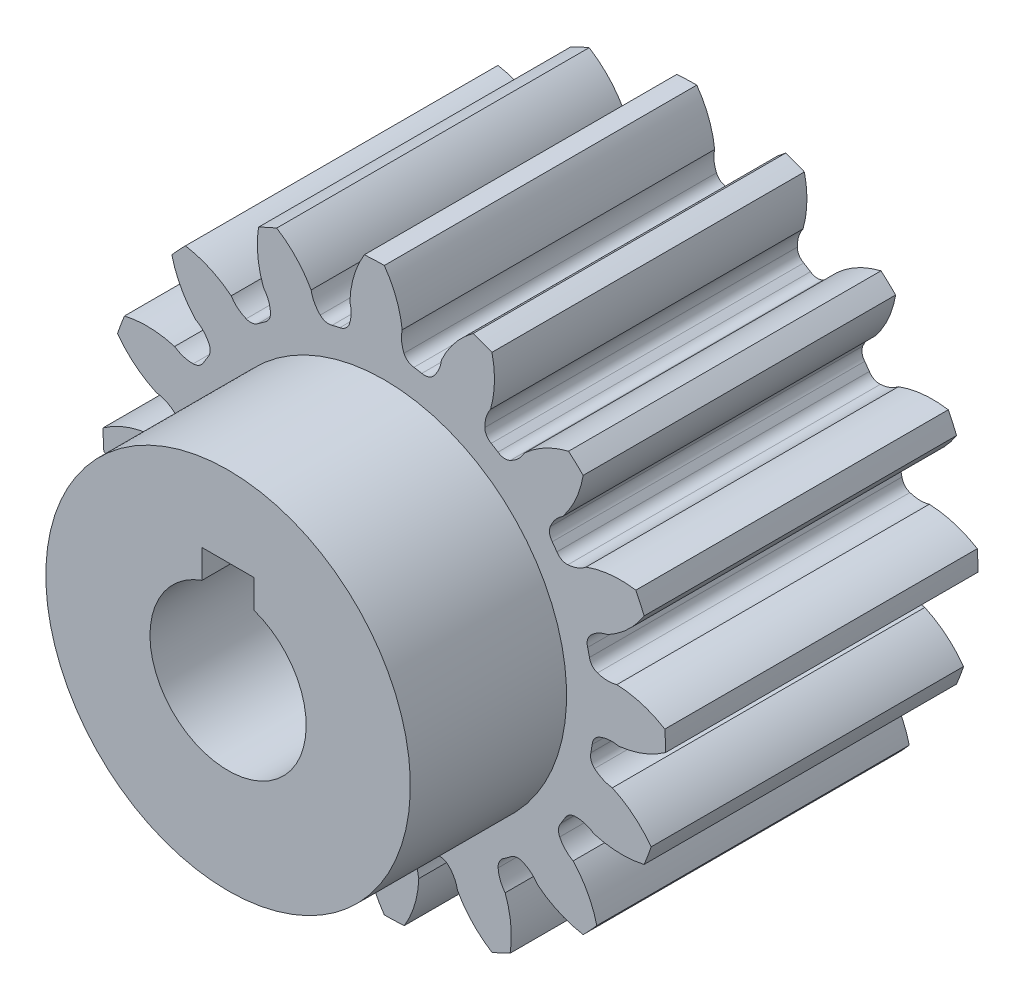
ISO-10303-21;
HEADER;
FILE_DESCRIPTION(('STEP AP214'),'2;1');
FILE_NAME('part.step','',(''),(''),'','','');
FILE_SCHEMA(('AUTOMOTIVE_DESIGN { 1 0 10303 214 1 1 1 1 }'));
ENDSEC;
DATA;
#1=APPLICATION_CONTEXT('core data for automotive mechanical design processes');
#2=APPLICATION_PROTOCOL_DEFINITION('international standard','automotive_design',2000,#1);
#3=PRODUCT_CONTEXT('',#1,'mechanical');
#4=PRODUCT('Part','Part','',(#3));
#5=PRODUCT_RELATED_PRODUCT_CATEGORY('part','',(#4));
#6=PRODUCT_DEFINITION_FORMATION('','',#4);
#7=PRODUCT_DEFINITION_CONTEXT('part definition',#1,'design');
#8=PRODUCT_DEFINITION('design','',#6,#7);
#9=PRODUCT_DEFINITION_SHAPE('','',#8);
#10=(LENGTH_UNIT() NAMED_UNIT(*) SI_UNIT(.MILLI.,.METRE.));
#11=(NAMED_UNIT(*) PLANE_ANGLE_UNIT() SI_UNIT($,.RADIAN.));
#12=(NAMED_UNIT(*) SI_UNIT($,.STERADIAN.) SOLID_ANGLE_UNIT());
#13=UNCERTAINTY_MEASURE_WITH_UNIT(LENGTH_MEASURE(1.E-05),#10,'distance_accuracy_value','');
#14=(GEOMETRIC_REPRESENTATION_CONTEXT(3) GLOBAL_UNCERTAINTY_ASSIGNED_CONTEXT((#13)) GLOBAL_UNIT_ASSIGNED_CONTEXT((#10,
#11,#12)) REPRESENTATION_CONTEXT('',''));
#15=CARTESIAN_POINT('',(0.,0.,0.));
#16=DIRECTION('',(0.,0.,1.));
#17=DIRECTION('',(1.,0.,0.));
#18=AXIS2_PLACEMENT_3D('',#15,#16,#17);
#19=CARTESIAN_POINT('',(0.,0.,0.));
#20=DIRECTION('',(0.,0.,-1.));
#21=DIRECTION('',(0.,1.,0.));
#22=AXIS2_PLACEMENT_3D('',#19,#20,#21);
#23=CYLINDRICAL_SURFACE('',#22,27.);
#24=CARTESIAN_POINT('',(0.,0.,30.));
#25=DIRECTION('',(0.,0.,-1.));
#26=DIRECTION('',(0.,1.,0.));
#27=AXIS2_PLACEMENT_3D('',#24,#25,#26);
#28=CIRCLE('',#27,27.);
#29=CARTESIAN_POINT('',(-26.9317365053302,-1.91874146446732,30.));
#30=VERTEX_POINT('',#29);
#31=CARTESIAN_POINT('',(-27.,0.,30.));
#32=VERTEX_POINT('',#31);
#33=EDGE_CURVE('E843',#30,#32,#28,.T.);
#34=ORIENTED_EDGE('',*,*,#33,.T.);
#35=DIRECTION('',(0.,0.,-1.));
#36=VECTOR('',#35,1.);
#37=CARTESIAN_POINT('',(-27.,0.,22.5));
#38=LINE('',#37,#36);
#39=CARTESIAN_POINT('',(-27.,0.,0.));
#40=VERTEX_POINT('',#39);
#41=EDGE_CURVE('E826',#32,#40,#38,.T.);
#42=ORIENTED_EDGE('',*,*,#41,.T.);
#43=CARTESIAN_POINT('',(0.,0.,0.));
#44=DIRECTION('',(0.,0.,-1.));
#45=DIRECTION('',(0.,1.,0.));
#46=AXIS2_PLACEMENT_3D('',#43,#44,#45);
#47=CIRCLE('',#46,27.);
#48=CARTESIAN_POINT('',(-26.9317365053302,-1.91874146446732,0.));
#49=VERTEX_POINT('',#48);
#50=EDGE_CURVE('E841',#49,#40,#47,.T.);
#51=ORIENTED_EDGE('',*,*,#50,.F.);
#52=DIRECTION('',(0.,0.,-1.));
#53=VECTOR('',#52,1.);
#54=CARTESIAN_POINT('',(-26.9317365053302,-1.91874146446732,22.5));
#55=LINE('',#54,#53);
#56=EDGE_CURVE('E880',#49,#30,#55,.F.);
#57=ORIENTED_EDGE('',*,*,#56,.T.);
#58=EDGE_LOOP('',(#34,#42,#51,#57));
#59=FACE_BOUND('',#58,.T.);
#60=ADVANCED_FACE('F14',(#59),#23,.T.);
#61=CARTESIAN_POINT('',(-25.6159507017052,8.53364339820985,0.));
#62=VERTEX_POINT('',#61);
#63=CARTESIAN_POINT('',(-24.9447473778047,10.3324526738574,0.));
#64=VERTEX_POINT('',#63);
#65=EDGE_CURVE('E853',#62,#64,#47,.T.);
#66=ORIENTED_EDGE('',*,*,#65,.F.);
#67=DIRECTION('',(0.,0.,-1.));
#68=VECTOR('',#67,1.);
#69=CARTESIAN_POINT('',(-25.6159507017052,8.53364339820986,22.5));
#70=LINE('',#69,#68);
#71=CARTESIAN_POINT('',(-25.6159507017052,8.53364339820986,30.));
#72=VERTEX_POINT('',#71);
#73=EDGE_CURVE('E845',#62,#72,#70,.F.);
#74=ORIENTED_EDGE('',*,*,#73,.T.);
#75=CARTESIAN_POINT('',(-24.9447473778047,10.3324526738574,30.));
#76=VERTEX_POINT('',#75);
#77=EDGE_CURVE('E1667',#72,#76,#28,.T.);
#78=ORIENTED_EDGE('',*,*,#77,.T.);
#79=DIRECTION('',(0.,0.,-1.));
#80=VECTOR('',#79,1.);
#81=CARTESIAN_POINT('',(-24.9447473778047,10.3324526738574,22.5));
#82=LINE('',#81,#80);
#83=EDGE_CURVE('E961',#76,#64,#82,.T.);
#84=ORIENTED_EDGE('',*,*,#83,.T.);
#85=EDGE_LOOP('',(#66,#74,#78,#84));
#86=FACE_BOUND('',#85,.T.);
#87=ADVANCED_FACE('F1664',(#86),#23,.T.);
#88=CARTESIAN_POINT('',(-20.4003686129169,17.6868584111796,0.));
#89=VERTEX_POINT('',#88);
#90=CARTESIAN_POINT('',(-19.0918830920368,19.0918830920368,0.));
#91=VERTEX_POINT('',#90);
#92=EDGE_CURVE('E858',#89,#91,#47,.T.);
#93=ORIENTED_EDGE('',*,*,#92,.F.);
#94=DIRECTION('',(0.,0.,-1.));
#95=VECTOR('',#94,1.);
#96=CARTESIAN_POINT('',(-20.4003686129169,17.6868584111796,22.5));
#97=LINE('',#96,#95);
#98=CARTESIAN_POINT('',(-20.4003686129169,17.6868584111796,30.));
#99=VERTEX_POINT('',#98);
#100=EDGE_CURVE('E958',#89,#99,#97,.F.);
#101=ORIENTED_EDGE('',*,*,#100,.T.);
#102=CARTESIAN_POINT('',(-19.0918830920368,19.0918830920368,30.));
#103=VERTEX_POINT('',#102);
#104=EDGE_CURVE('E2018',#99,#103,#28,.T.);
#105=ORIENTED_EDGE('',*,*,#104,.T.);
#106=DIRECTION('',(0.,0.,-1.));
#107=VECTOR('',#106,1.);
#108=CARTESIAN_POINT('',(-19.0918830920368,19.0918830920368,22.5));
#109=LINE('',#108,#107);
#110=EDGE_CURVE('E955',#103,#91,#109,.T.);
#111=ORIENTED_EDGE('',*,*,#110,.T.);
#112=EDGE_LOOP('',(#93,#101,#105,#111));
#113=FACE_BOUND('',#112,.T.);
#114=ADVANCED_FACE('F1701',(#113),#23,.T.);
#115=CARTESIAN_POINT('',(-12.079015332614,24.147409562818,0.));
#116=VERTEX_POINT('',#115);
#117=CARTESIAN_POINT('',(-10.3324526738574,24.9447473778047,0.));
#118=VERTEX_POINT('',#117);
#119=EDGE_CURVE('E1704',#116,#118,#47,.T.);
#120=ORIENTED_EDGE('',*,*,#119,.F.);
#121=DIRECTION('',(0.,0.,-1.));
#122=VECTOR('',#121,1.);
#123=CARTESIAN_POINT('',(-12.079015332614,24.147409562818,22.5));
#124=LINE('',#123,#122);
#125=CARTESIAN_POINT('',(-12.079015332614,24.147409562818,30.));
#126=VERTEX_POINT('',#125);
#127=EDGE_CURVE('E952',#116,#126,#124,.F.);
#128=ORIENTED_EDGE('',*,*,#127,.T.);
#129=CARTESIAN_POINT('',(-10.3324526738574,24.9447473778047,30.));
#130=VERTEX_POINT('',#129);
#131=EDGE_CURVE('E2019',#126,#130,#28,.T.);
#132=ORIENTED_EDGE('',*,*,#131,.T.);
#133=DIRECTION('',(0.,0.,-1.));
#134=VECTOR('',#133,1.);
#135=CARTESIAN_POINT('',(-10.3324526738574,24.9447473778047,22.5));
#136=LINE('',#135,#134);
#137=EDGE_CURVE('E949',#130,#118,#136,.T.);
#138=ORIENTED_EDGE('',*,*,#137,.T.);
#139=EDGE_LOOP('',(#120,#128,#132,#138));
#140=FACE_BOUND('',#139,.T.);
#141=ADVANCED_FACE('F2570',(#140),#23,.T.);
#142=CARTESIAN_POINT('',(-1.91874146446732,26.9317365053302,0.));
#143=VERTEX_POINT('',#142);
#144=CARTESIAN_POINT('',(0.,27.,0.));
#145=VERTEX_POINT('',#144);
#146=EDGE_CURVE('E1706',#143,#145,#47,.T.);
#147=ORIENTED_EDGE('',*,*,#146,.F.);
#148=DIRECTION('',(0.,0.,-1.));
#149=VECTOR('',#148,1.);
#150=CARTESIAN_POINT('',(-1.91874146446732,26.9317365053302,22.5));
#151=LINE('',#150,#149);
#152=CARTESIAN_POINT('',(-1.91874146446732,26.9317365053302,30.));
#153=VERTEX_POINT('',#152);
#154=EDGE_CURVE('E946',#143,#153,#151,.F.);
#155=ORIENTED_EDGE('',*,*,#154,.T.);
#156=CARTESIAN_POINT('',(0.,27.,30.));
#157=VERTEX_POINT('',#156);
#158=EDGE_CURVE('E2021',#153,#157,#28,.T.);
#159=ORIENTED_EDGE('',*,*,#158,.T.);
#160=DIRECTION('',(0.,0.,-1.));
#161=VECTOR('',#160,1.);
#162=CARTESIAN_POINT('',(0.,27.,22.5));
#163=LINE('',#162,#161);
#164=EDGE_CURVE('E943',#157,#145,#163,.T.);
#165=ORIENTED_EDGE('',*,*,#164,.T.);
#166=EDGE_LOOP('',(#147,#155,#159,#165));
#167=FACE_BOUND('',#166,.T.);
#168=ADVANCED_FACE('F2586',(#167),#23,.T.);
#169=CARTESIAN_POINT('',(8.53364339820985,25.6159507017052,0.));
#170=VERTEX_POINT('',#169);
#171=CARTESIAN_POINT('',(10.3324526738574,24.9447473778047,0.));
#172=VERTEX_POINT('',#171);
#173=EDGE_CURVE('E1711',#170,#172,#47,.T.);
#174=ORIENTED_EDGE('',*,*,#173,.F.);
#175=DIRECTION('',(0.,0.,-1.));
#176=VECTOR('',#175,1.);
#177=CARTESIAN_POINT('',(8.53364339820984,25.6159507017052,22.5));
#178=LINE('',#177,#176);
#179=CARTESIAN_POINT('',(8.53364339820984,25.6159507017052,30.));
#180=VERTEX_POINT('',#179);
#181=EDGE_CURVE('E940',#170,#180,#178,.F.);
#182=ORIENTED_EDGE('',*,*,#181,.T.);
#183=CARTESIAN_POINT('',(10.3324526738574,24.9447473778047,30.));
#184=VERTEX_POINT('',#183);
#185=EDGE_CURVE('E2025',#180,#184,#28,.T.);
#186=ORIENTED_EDGE('',*,*,#185,.T.);
#187=DIRECTION('',(0.,0.,-1.));
#188=VECTOR('',#187,1.);
#189=CARTESIAN_POINT('',(10.3324526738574,24.9447473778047,22.5));
#190=LINE('',#189,#188);
#191=EDGE_CURVE('E937',#184,#172,#190,.T.);
#192=ORIENTED_EDGE('',*,*,#191,.T.);
#193=EDGE_LOOP('',(#174,#182,#186,#192));
#194=FACE_BOUND('',#193,.T.);
#195=ADVANCED_FACE('F2602',(#194),#23,.T.);
#196=CARTESIAN_POINT('',(17.6868584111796,20.4003686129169,0.));
#197=VERTEX_POINT('',#196);
#198=CARTESIAN_POINT('',(19.0918830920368,19.0918830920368,0.));
#199=VERTEX_POINT('',#198);
#200=EDGE_CURVE('E1716',#197,#199,#47,.T.);
#201=ORIENTED_EDGE('',*,*,#200,.F.);
#202=DIRECTION('',(0.,0.,-1.));
#203=VECTOR('',#202,1.);
#204=CARTESIAN_POINT('',(17.6868584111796,20.4003686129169,22.5));
#205=LINE('',#204,#203);
#206=CARTESIAN_POINT('',(17.6868584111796,20.4003686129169,30.));
#207=VERTEX_POINT('',#206);
#208=EDGE_CURVE('E934',#197,#207,#205,.F.);
#209=ORIENTED_EDGE('',*,*,#208,.T.);
#210=CARTESIAN_POINT('',(19.0918830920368,19.0918830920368,30.));
#211=VERTEX_POINT('',#210);
#212=EDGE_CURVE('E2029',#207,#211,#28,.T.);
#213=ORIENTED_EDGE('',*,*,#212,.T.);
#214=DIRECTION('',(0.,0.,-1.));
#215=VECTOR('',#214,1.);
#216=CARTESIAN_POINT('',(19.0918830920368,19.0918830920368,22.5));
#217=LINE('',#216,#215);
#218=EDGE_CURVE('E931',#211,#199,#217,.T.);
#219=ORIENTED_EDGE('',*,*,#218,.T.);
#220=EDGE_LOOP('',(#201,#209,#213,#219));
#221=FACE_BOUND('',#220,.T.);
#222=ADVANCED_FACE('F2035',(#221),#23,.T.);
#223=CARTESIAN_POINT('',(24.1474095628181,12.079015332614,0.));
#224=VERTEX_POINT('',#223);
#225=CARTESIAN_POINT('',(24.9447473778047,10.3324526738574,0.));
#226=VERTEX_POINT('',#225);
#227=EDGE_CURVE('E863',#224,#226,#47,.T.);
#228=ORIENTED_EDGE('',*,*,#227,.F.);
#229=DIRECTION('',(0.,0.,-1.));
#230=VECTOR('',#229,1.);
#231=CARTESIAN_POINT('',(24.147409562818,12.079015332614,22.5));
#232=LINE('',#231,#230);
#233=CARTESIAN_POINT('',(24.147409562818,12.079015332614,30.));
#234=VERTEX_POINT('',#233);
#235=EDGE_CURVE('E929',#224,#234,#232,.F.);
#236=ORIENTED_EDGE('',*,*,#235,.T.);
#237=CARTESIAN_POINT('',(24.9447473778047,10.3324526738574,30.));
#238=VERTEX_POINT('',#237);
#239=EDGE_CURVE('E870',#234,#238,#28,.T.);
#240=ORIENTED_EDGE('',*,*,#239,.T.);
#241=DIRECTION('',(0.,0.,-1.));
#242=VECTOR('',#241,1.);
#243=CARTESIAN_POINT('',(24.9447473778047,10.3324526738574,22.5));
#244=LINE('',#243,#242);
#245=EDGE_CURVE('E926',#238,#226,#244,.T.);
#246=ORIENTED_EDGE('',*,*,#245,.T.);
#247=EDGE_LOOP('',(#228,#236,#240,#246));
#248=FACE_BOUND('',#247,.T.);
#249=ADVANCED_FACE('F1729',(#248),#23,.T.);
#250=CARTESIAN_POINT('',(25.6159507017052,-8.53364339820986,0.));
#251=VERTEX_POINT('',#250);
#252=CARTESIAN_POINT('',(24.9447473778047,-10.3324526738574,0.));
#253=VERTEX_POINT('',#252);
#254=EDGE_CURVE('E865',#251,#253,#47,.T.);
#255=ORIENTED_EDGE('',*,*,#254,.F.);
#256=DIRECTION('',(0.,0.,-1.));
#257=VECTOR('',#256,1.);
#258=CARTESIAN_POINT('',(25.6159507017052,-8.53364339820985,22.5));
#259=LINE('',#258,#257);
#260=CARTESIAN_POINT('',(25.6159507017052,-8.53364339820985,30.));
#261=VERTEX_POINT('',#260);
#262=EDGE_CURVE('E921',#251,#261,#259,.F.);
#263=ORIENTED_EDGE('',*,*,#262,.T.);
#264=CARTESIAN_POINT('',(24.9447473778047,-10.3324526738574,30.));
#265=VERTEX_POINT('',#264);
#266=EDGE_CURVE('E871',#261,#265,#28,.T.);
#267=ORIENTED_EDGE('',*,*,#266,.T.);
#268=DIRECTION('',(0.,0.,-1.));
#269=VECTOR('',#268,1.);
#270=CARTESIAN_POINT('',(24.9447473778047,-10.3324526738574,22.5));
#271=LINE('',#270,#269);
#272=EDGE_CURVE('E918',#265,#253,#271,.T.);
#273=ORIENTED_EDGE('',*,*,#272,.T.);
#274=EDGE_LOOP('',(#255,#263,#267,#273));
#275=FACE_BOUND('',#274,.T.);
#276=ADVANCED_FACE('F1959',(#275),#23,.T.);
#277=CARTESIAN_POINT('',(20.4003686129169,-17.6868584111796,0.));
#278=VERTEX_POINT('',#277);
#279=CARTESIAN_POINT('',(19.0918830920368,-19.0918830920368,0.));
#280=VERTEX_POINT('',#279);
#281=EDGE_CURVE('E1962',#278,#280,#47,.T.);
#282=ORIENTED_EDGE('',*,*,#281,.F.);
#283=DIRECTION('',(0.,0.,-1.));
#284=VECTOR('',#283,1.);
#285=CARTESIAN_POINT('',(20.4003686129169,-17.6868584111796,22.5));
#286=LINE('',#285,#284);
#287=CARTESIAN_POINT('',(20.4003686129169,-17.6868584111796,30.));
#288=VERTEX_POINT('',#287);
#289=EDGE_CURVE('E915',#278,#288,#286,.F.);
#290=ORIENTED_EDGE('',*,*,#289,.T.);
#291=CARTESIAN_POINT('',(19.0918830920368,-19.0918830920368,30.));
#292=VERTEX_POINT('',#291);
#293=EDGE_CURVE('E3335',#288,#292,#28,.T.);
#294=ORIENTED_EDGE('',*,*,#293,.T.);
#295=DIRECTION('',(0.,0.,-1.));
#296=VECTOR('',#295,1.);
#297=CARTESIAN_POINT('',(19.0918830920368,-19.0918830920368,22.5));
#298=LINE('',#297,#296);
#299=EDGE_CURVE('E912',#292,#280,#298,.T.);
#300=ORIENTED_EDGE('',*,*,#299,.T.);
#301=EDGE_LOOP('',(#282,#290,#294,#300));
#302=FACE_BOUND('',#301,.T.);
#303=ADVANCED_FACE('F2673',(#302),#23,.T.);
#304=CARTESIAN_POINT('',(12.0790153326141,-24.147409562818,0.));
#305=VERTEX_POINT('',#304);
#306=CARTESIAN_POINT('',(10.3324526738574,-24.9447473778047,0.));
#307=VERTEX_POINT('',#306);
#308=EDGE_CURVE('E1964',#305,#307,#47,.T.);
#309=ORIENTED_EDGE('',*,*,#308,.F.);
#310=DIRECTION('',(0.,0.,-1.));
#311=VECTOR('',#310,1.);
#312=CARTESIAN_POINT('',(12.079015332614,-24.147409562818,22.5));
#313=LINE('',#312,#311);
#314=CARTESIAN_POINT('',(12.079015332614,-24.147409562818,30.));
#315=VERTEX_POINT('',#314);
#316=EDGE_CURVE('E909',#305,#315,#313,.F.);
#317=ORIENTED_EDGE('',*,*,#316,.T.);
#318=CARTESIAN_POINT('',(10.3324526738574,-24.9447473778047,30.));
#319=VERTEX_POINT('',#318);
#320=EDGE_CURVE('E3337',#315,#319,#28,.T.);
#321=ORIENTED_EDGE('',*,*,#320,.T.);
#322=DIRECTION('',(0.,0.,-1.));
#323=VECTOR('',#322,1.);
#324=CARTESIAN_POINT('',(10.3324526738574,-24.9447473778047,22.5));
#325=LINE('',#324,#323);
#326=EDGE_CURVE('E906',#319,#307,#325,.T.);
#327=ORIENTED_EDGE('',*,*,#326,.T.);
#328=EDGE_LOOP('',(#309,#317,#321,#327));
#329=FACE_BOUND('',#328,.T.);
#330=ADVANCED_FACE('F2680',(#329),#23,.T.);
#331=CARTESIAN_POINT('',(1.91874146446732,-26.9317365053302,0.));
#332=VERTEX_POINT('',#331);
#333=CARTESIAN_POINT('',(0.,-27.,0.));
#334=VERTEX_POINT('',#333);
#335=EDGE_CURVE('E1969',#332,#334,#47,.T.);
#336=ORIENTED_EDGE('',*,*,#335,.F.);
#337=DIRECTION('',(0.,0.,-1.));
#338=VECTOR('',#337,1.);
#339=CARTESIAN_POINT('',(1.91874146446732,-26.9317365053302,22.5));
#340=LINE('',#339,#338);
#341=CARTESIAN_POINT('',(1.91874146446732,-26.9317365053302,30.));
#342=VERTEX_POINT('',#341);
#343=EDGE_CURVE('E903',#332,#342,#340,.F.);
#344=ORIENTED_EDGE('',*,*,#343,.T.);
#345=CARTESIAN_POINT('',(0.,-27.,30.));
#346=VERTEX_POINT('',#345);
#347=EDGE_CURVE('E3340',#342,#346,#28,.T.);
#348=ORIENTED_EDGE('',*,*,#347,.T.);
#349=DIRECTION('',(0.,0.,-1.));
#350=VECTOR('',#349,1.);
#351=CARTESIAN_POINT('',(0.,-27.,22.5));
#352=LINE('',#351,#350);
#353=EDGE_CURVE('E900',#346,#334,#352,.T.);
#354=ORIENTED_EDGE('',*,*,#353,.T.);
#355=EDGE_LOOP('',(#336,#344,#348,#354));
#356=FACE_BOUND('',#355,.T.);
#357=ADVANCED_FACE('F2688',(#356),#23,.T.);
#358=CARTESIAN_POINT('',(-8.53364339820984,-25.6159507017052,0.));
#359=VERTEX_POINT('',#358);
#360=CARTESIAN_POINT('',(-10.3324526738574,-24.9447473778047,0.));
#361=VERTEX_POINT('',#360);
#362=EDGE_CURVE('E1974',#359,#361,#47,.T.);
#363=ORIENTED_EDGE('',*,*,#362,.F.);
#364=DIRECTION('',(0.,0.,-1.));
#365=VECTOR('',#364,1.);
#366=CARTESIAN_POINT('',(-8.53364339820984,-25.6159507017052,22.5));
#367=LINE('',#366,#365);
#368=CARTESIAN_POINT('',(-8.53364339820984,-25.6159507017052,30.));
#369=VERTEX_POINT('',#368);
#370=EDGE_CURVE('E897',#359,#369,#367,.F.);
#371=ORIENTED_EDGE('',*,*,#370,.T.);
#372=CARTESIAN_POINT('',(-10.3324526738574,-24.9447473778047,30.));
#373=VERTEX_POINT('',#372);
#374=EDGE_CURVE('E2017',#369,#373,#28,.T.);
#375=ORIENTED_EDGE('',*,*,#374,.T.);
#376=DIRECTION('',(0.,0.,-1.));
#377=VECTOR('',#376,1.);
#378=CARTESIAN_POINT('',(-10.3324526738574,-24.9447473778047,22.5));
#379=LINE('',#378,#377);
#380=EDGE_CURVE('E894',#373,#361,#379,.T.);
#381=ORIENTED_EDGE('',*,*,#380,.T.);
#382=EDGE_LOOP('',(#363,#371,#375,#381));
#383=FACE_BOUND('',#382,.T.);
#384=ADVANCED_FACE('F1795',(#383),#23,.T.);
#385=CARTESIAN_POINT('',(-17.6868584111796,-20.4003686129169,0.));
#386=VERTEX_POINT('',#385);
#387=CARTESIAN_POINT('',(-19.0918830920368,-19.0918830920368,0.));
#388=VERTEX_POINT('',#387);
#389=EDGE_CURVE('E856',#386,#388,#47,.T.);
#390=ORIENTED_EDGE('',*,*,#389,.F.);
#391=DIRECTION('',(0.,0.,-1.));
#392=VECTOR('',#391,1.);
#393=CARTESIAN_POINT('',(-17.6868584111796,-20.4003686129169,22.5));
#394=LINE('',#393,#392);
#395=CARTESIAN_POINT('',(-17.6868584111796,-20.4003686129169,30.));
#396=VERTEX_POINT('',#395);
#397=EDGE_CURVE('E891',#386,#396,#394,.F.);
#398=ORIENTED_EDGE('',*,*,#397,.T.);
#399=CARTESIAN_POINT('',(-19.0918830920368,-19.0918830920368,30.));
#400=VERTEX_POINT('',#399);
#401=EDGE_CURVE('E1988',#396,#400,#28,.T.);
#402=ORIENTED_EDGE('',*,*,#401,.T.);
#403=DIRECTION('',(0.,0.,-1.));
#404=VECTOR('',#403,1.);
#405=CARTESIAN_POINT('',(-19.0918830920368,-19.0918830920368,22.5));
#406=LINE('',#405,#404);
#407=EDGE_CURVE('E888',#400,#388,#406,.T.);
#408=ORIENTED_EDGE('',*,*,#407,.T.);
#409=EDGE_LOOP('',(#390,#398,#402,#408));
#410=FACE_BOUND('',#409,.T.);
#411=ADVANCED_FACE('F1788',(#410),#23,.T.);
#412=CARTESIAN_POINT('',(-24.1474095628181,-12.079015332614,0.));
#413=VERTEX_POINT('',#412);
#414=CARTESIAN_POINT('',(-24.9447473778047,-10.3324526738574,0.));
#415=VERTEX_POINT('',#414);
#416=EDGE_CURVE('E852',#413,#415,#47,.T.);
#417=ORIENTED_EDGE('',*,*,#416,.F.);
#418=DIRECTION('',(0.,0.,-1.));
#419=VECTOR('',#418,1.);
#420=CARTESIAN_POINT('',(-24.147409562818,-12.079015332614,22.5));
#421=LINE('',#420,#419);
#422=CARTESIAN_POINT('',(-24.147409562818,-12.079015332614,30.));
#423=VERTEX_POINT('',#422);
#424=EDGE_CURVE('E885',#413,#423,#421,.F.);
#425=ORIENTED_EDGE('',*,*,#424,.T.);
#426=CARTESIAN_POINT('',(-24.9447473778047,-10.3324526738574,30.));
#427=VERTEX_POINT('',#426);
#428=EDGE_CURVE('E2015',#423,#427,#28,.T.);
#429=ORIENTED_EDGE('',*,*,#428,.T.);
#430=DIRECTION('',(0.,0.,-1.));
#431=VECTOR('',#430,1.);
#432=CARTESIAN_POINT('',(-24.9447473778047,-10.3324526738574,22.5));
#433=LINE('',#432,#431);
#434=EDGE_CURVE('E882',#427,#415,#433,.T.);
#435=ORIENTED_EDGE('',*,*,#434,.T.);
#436=EDGE_LOOP('',(#417,#425,#429,#435));
#437=FACE_BOUND('',#436,.T.);
#438=ADVANCED_FACE('F1779',(#437),#23,.T.);
#439=CARTESIAN_POINT('',(0.,0.,45.));
#440=DIRECTION('',(0.,0.,-1.));
#441=DIRECTION('',(0.,1.,0.));
#442=AXIS2_PLACEMENT_3D('',#439,#440,#441);
#443=PLANE('',#442);
#444=CARTESIAN_POINT('',(0.,0.,45.));
#445=DIRECTION('',(0.,0.,-1.));
#446=DIRECTION('',(0.,1.,0.));
#447=AXIS2_PLACEMENT_3D('',#444,#445,#446);
#448=CIRCLE('',#447,17.5);
#449=CARTESIAN_POINT('',(0.,17.5,45.));
#450=VERTEX_POINT('',#449);
#451=EDGE_CURVE('E875',#450,#450,#448,.T.);
#452=ORIENTED_EDGE('',*,*,#451,.F.);
#453=EDGE_LOOP('',(#452));
#454=FACE_BOUND('',#453,.T.);
#455=DIRECTION('',(0.,-1.,0.));
#456=VECTOR('',#455,1.);
#457=CARTESIAN_POINT('',(-2.5,9.8,45.));
#458=LINE('',#457,#456);
#459=CARTESIAN_POINT('',(-2.5,9.8,45.));
#460=VERTEX_POINT('',#459);
#461=CARTESIAN_POINT('',(-2.5,7.07106781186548,45.));
#462=VERTEX_POINT('',#461);
#463=EDGE_CURVE('E1447',#460,#462,#458,.T.);
#464=ORIENTED_EDGE('',*,*,#463,.F.);
#465=DIRECTION('',(-1.,0.,0.));
#466=VECTOR('',#465,1.);
#467=CARTESIAN_POINT('',(2.5,9.8,45.));
#468=LINE('',#467,#466);
#469=CARTESIAN_POINT('',(2.5,9.8,45.));
#470=VERTEX_POINT('',#469);
#471=EDGE_CURVE('E1455',#470,#460,#468,.T.);
#472=ORIENTED_EDGE('',*,*,#471,.F.);
#473=DIRECTION('',(0.,1.,0.));
#474=VECTOR('',#473,1.);
#475=CARTESIAN_POINT('',(2.5,7.07106781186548,45.));
#476=LINE('',#475,#474);
#477=CARTESIAN_POINT('',(2.5,7.07106781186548,45.));
#478=VERTEX_POINT('',#477);
#479=EDGE_CURVE('E1452',#478,#470,#476,.T.);
#480=ORIENTED_EDGE('',*,*,#479,.F.);
#481=CARTESIAN_POINT('',(0.,0.,45.));
#482=DIRECTION('',(0.,0.,1.));
#483=DIRECTION('',(1.,0.,0.));
#484=AXIS2_PLACEMENT_3D('',#481,#482,#483);
#485=CIRCLE('',#484,7.5);
#486=EDGE_CURVE('E1449',#462,#478,#485,.T.);
#487=ORIENTED_EDGE('',*,*,#486,.F.);
#488=EDGE_LOOP('',(#464,#472,#480,#487));
#489=FACE_BOUND('',#488,.T.);
#490=ADVANCED_FACE('F16',(#454,#489),#443,.F.);
#491=CARTESIAN_POINT('',(27.,0.,0.));
#492=DIRECTION('',(0.,0.,1.));
#493=DIRECTION('',(0.,-1.,0.));
#494=AXIS2_PLACEMENT_3D('',#491,#492,#493);
#495=PLANE('',#494);
#496=DIRECTION('',(0.,-1.,0.));
#497=VECTOR('',#496,1.);
#498=CARTESIAN_POINT('',(-2.5,9.8,0.));
#499=LINE('',#498,#497);
#500=CARTESIAN_POINT('',(-2.5,9.8,0.));
#501=VERTEX_POINT('',#500);
#502=CARTESIAN_POINT('',(-2.5,7.07106781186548,0.));
#503=VERTEX_POINT('',#502);
#504=EDGE_CURVE('E1446',#501,#503,#499,.T.);
#505=ORIENTED_EDGE('',*,*,#504,.T.);
#506=CARTESIAN_POINT('',(0.,0.,0.));
#507=DIRECTION('',(0.,0.,1.));
#508=DIRECTION('',(0.,-1.,0.));
#509=AXIS2_PLACEMENT_3D('',#506,#507,#508);
#510=CIRCLE('',#509,7.5);
#511=CARTESIAN_POINT('',(2.5,7.07106781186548,0.));
#512=VERTEX_POINT('',#511);
#513=EDGE_CURVE('E878',#512,#503,#510,.F.);
#514=ORIENTED_EDGE('',*,*,#513,.F.);
#515=DIRECTION('',(0.,1.,0.));
#516=VECTOR('',#515,1.);
#517=CARTESIAN_POINT('',(2.5,7.07106781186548,0.));
#518=LINE('',#517,#516);
#519=CARTESIAN_POINT('',(2.5,9.8,0.));
#520=VERTEX_POINT('',#519);
#521=EDGE_CURVE('E1460',#512,#520,#518,.T.);
#522=ORIENTED_EDGE('',*,*,#521,.T.);
#523=DIRECTION('',(-1.,0.,0.));
#524=VECTOR('',#523,1.);
#525=CARTESIAN_POINT('',(2.5,9.8,0.));
#526=LINE('',#525,#524);
#527=EDGE_CURVE('E1450',#520,#501,#526,.T.);
#528=ORIENTED_EDGE('',*,*,#527,.T.);
#529=EDGE_LOOP('',(#505,#514,#522,#528));
#530=FACE_BOUND('',#529,.T.);
#531=ORIENTED_EDGE('',*,*,#50,.T.);
#532=CARTESIAN_POINT('',(-21.4609666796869,-7.77096897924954,0.));
#533=DIRECTION('',(0.,0.,1.));
#534=DIRECTION('',(1.,0.,0.));
#535=AXIS2_PLACEMENT_3D('',#532,#533,#534);
#536=CIRCLE('',#535,9.543);
#537=CARTESIAN_POINT('',(-22.5047536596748,1.71477599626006,0.));
#538=VERTEX_POINT('',#537);
#539=EDGE_CURVE('E823',#538,#40,#536,.T.);
#540=ORIENTED_EDGE('',*,*,#539,.F.);
#541=CARTESIAN_POINT('',(-21.84885439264,4.68419970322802,0.));
#542=DIRECTION('',(0.,0.,1.));
#543=DIRECTION('',(1.,0.,0.));
#544=AXIS2_PLACEMENT_3D('',#541,#542,#543);
#545=CIRCLE('',#544,3.04100000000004);
#546=CARTESIAN_POINT('',(-20.6486484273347,1.89006537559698,0.));
#547=VERTEX_POINT('',#546);
#548=EDGE_CURVE('E835',#538,#547,#545,.T.);
#549=ORIENTED_EDGE('',*,*,#548,.T.);
#550=CARTESIAN_POINT('',(-21.0969336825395,2.9447484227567,0.));
#551=DIRECTION('',(0.,0.,1.));
#552=DIRECTION('',(1.,0.,0.));
#553=AXIS2_PLACEMENT_3D('',#550,#551,#552);
#554=CIRCLE('',#553,1.14600000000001);
#555=CARTESIAN_POINT('',(-19.9551332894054,2.84672871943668,0.));
#556=VERTEX_POINT('',#555);
#557=EDGE_CURVE('E1653',#547,#556,#554,.T.);
#558=ORIENTED_EDGE('',*,*,#557,.T.);
#559=DIRECTION('',(-0.162769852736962,-0.986664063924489,0.));
#560=VECTOR('',#559,1.);
#561=CARTESIAN_POINT('',(-19.8307225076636,3.60087112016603,0.));
#562=LINE('',#561,#560);
#563=CARTESIAN_POINT('',(-19.8307225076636,3.60087112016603,0.));
#564=VERTEX_POINT('',#563);
#565=EDGE_CURVE('E1151',#564,#556,#562,.T.);
#566=ORIENTED_EDGE('',*,*,#565,.F.);
#567=CARTESIAN_POINT('',(-20.9441337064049,3.87222237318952,0.));
#568=DIRECTION('',(0.,0.,1.));
#569=DIRECTION('',(1.,0.,0.));
#570=AXIS2_PLACEMENT_3D('',#567,#568,#569);
#571=CIRCLE('',#570,1.146);
#572=CARTESIAN_POINT('',(-20.1872439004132,4.73270701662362,0.));
#573=VERTEX_POINT('',#572);
#574=EDGE_CURVE('E1650',#564,#573,#571,.T.);
#575=ORIENTED_EDGE('',*,*,#574,.T.);
#576=CARTESIAN_POINT('',(-22.2093028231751,2.46137289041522,0.));
#577=DIRECTION('',(0.,0.,1.));
#578=DIRECTION('',(1.,0.,0.));
#579=AXIS2_PLACEMENT_3D('',#576,#577,#578);
#580=CIRCLE('',#579,3.04099999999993);
#581=CARTESIAN_POINT('',(-21.8923327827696,5.48580853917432,0.));
#582=VERTEX_POINT('',#581);
#583=EDGE_CURVE('E1171',#573,#582,#580,.T.);
#584=ORIENTED_EDGE('',*,*,#583,.T.);
#585=CARTESIAN_POINT('',(-17.9049398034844,14.1558458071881,0.));
#586=DIRECTION('',(0.,0.,1.));
#587=DIRECTION('',(1.,0.,0.));
#588=AXIS2_PLACEMENT_3D('',#585,#586,#587);
#589=CIRCLE('',#588,9.543);
#590=EDGE_CURVE('E1646',#62,#582,#589,.T.);
#591=ORIENTED_EDGE('',*,*,#590,.F.);
#592=ORIENTED_EDGE('',*,*,#65,.T.);
#593=CARTESIAN_POINT('',(-22.8011689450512,1.03331720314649,0.));
#594=DIRECTION('',(0.,0.,1.));
#595=DIRECTION('',(1.,0.,0.));
#596=AXIS2_PLACEMENT_3D('',#593,#594,#595);
#597=CIRCLE('',#596,9.543);
#598=CARTESIAN_POINT('',(-20.135464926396,10.1964428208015,0.));
#599=VERTEX_POINT('',#598);
#600=EDGE_CURVE('E1644',#599,#64,#597,.T.);
#601=ORIENTED_EDGE('',*,*,#600,.F.);
#602=CARTESIAN_POINT('',(-18.3931437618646,12.6888308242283,0.));
#603=DIRECTION('',(0.,0.,1.));
#604=DIRECTION('',(1.,0.,0.));
#605=AXIS2_PLACEMENT_3D('',#602,#603,#604);
#606=CIRCLE('',#605,3.041);
#607=CARTESIAN_POINT('',(-18.3535669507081,9.6480883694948,0.));
#608=VERTEX_POINT('',#607);
#609=EDGE_CURVE('E1641',#599,#608,#606,.T.);
#610=ORIENTED_EDGE('',*,*,#609,.T.);
#611=CARTESIAN_POINT('',(-18.364118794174,10.7940397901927,0.));
#612=DIRECTION('',(0.,0.,1.));
#613=DIRECTION('',(1.,0.,0.));
#614=AXIS2_PLACEMENT_3D('',#611,#612,#613);
#615=CIRCLE('',#614,1.146);
#616=CARTESIAN_POINT('',(-17.34674329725,10.2665332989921,0.));
#617=VERTEX_POINT('',#616);
#618=EDGE_CURVE('E1638',#608,#617,#615,.T.);
#619=ORIENTED_EDGE('',*,*,#618,.T.);
#620=DIRECTION('',(-0.527959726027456,-0.849269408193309,0.));
#621=VECTOR('',#620,1.);
#622=CARTESIAN_POINT('',(-16.9432049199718,10.9156600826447,0.));
#623=LINE('',#622,#621);
#624=CARTESIAN_POINT('',(-16.9432049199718,10.9156600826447,0.));
#625=VERTEX_POINT('',#624);
#626=EDGE_CURVE('E1635',#625,#617,#623,.T.);
#627=ORIENTED_EDGE('',*,*,#626,.F.);
#628=CARTESIAN_POINT('',(-17.8680211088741,11.5924399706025,0.));
#629=DIRECTION('',(0.,0.,1.));
#630=DIRECTION('',(1.,0.,0.));
#631=AXIS2_PLACEMENT_3D('',#628,#629,#630);
#632=CIRCLE('',#631,1.146);
#633=CARTESIAN_POINT('',(-16.8394528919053,12.0977749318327,0.));
#634=VERTEX_POINT('',#633);
#635=EDGE_CURVE('E1632',#625,#634,#632,.T.);
#636=ORIENTED_EDGE('',*,*,#635,.T.);
#637=CARTESIAN_POINT('',(-19.5767936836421,10.773144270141,0.));
#638=DIRECTION('',(0.,0.,1.));
#639=DIRECTION('',(1.,0.,0.));
#640=AXIS2_PLACEMENT_3D('',#637,#638,#639);
#641=CIRCLE('',#640,3.041);
#642=CARTESIAN_POINT('',(-18.1265501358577,13.4460592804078,0.));
#643=VERTEX_POINT('',#642);
#644=EDGE_CURVE('E1629',#634,#643,#641,.T.);
#645=ORIENTED_EDGE('',*,*,#644,.T.);
#646=CARTESIAN_POINT('',(-11.1247997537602,19.9302200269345,0.));
#647=DIRECTION('',(0.,0.,1.));
#648=DIRECTION('',(1.,0.,0.));
#649=AXIS2_PLACEMENT_3D('',#646,#647,#648);
#650=CIRCLE('',#649,9.543);
#651=EDGE_CURVE('E1626',#89,#643,#650,.T.);
#652=ORIENTED_EDGE('',*,*,#651,.F.);
#653=ORIENTED_EDGE('',*,*,#92,.T.);
#654=CARTESIAN_POINT('',(-20.6700999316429,9.68029020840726,0.));
#655=DIRECTION('',(0.,0.,1.));
#656=DIRECTION('',(1.,0.,0.));
#657=AXIS2_PLACEMENT_3D('',#654,#655,#656);
#658=CIRCLE('',#657,9.543);
#659=CARTESIAN_POINT('',(-14.7007341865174,17.1257936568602,0.));
#660=VERTEX_POINT('',#659);
#661=EDGE_CURVE('E1624',#660,#91,#658,.T.);
#662=ORIENTED_EDGE('',*,*,#661,.F.);
#663=CARTESIAN_POINT('',(-12.1372437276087,18.7617024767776,0.));
#664=DIRECTION('',(0.,0.,1.));
#665=DIRECTION('',(1.,0.,0.));
#666=AXIS2_PLACEMENT_3D('',#663,#664,#665);
#667=CIRCLE('',#666,3.04099999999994);
#668=CARTESIAN_POINT('',(-13.2643212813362,15.9372773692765,0.));
#669=VERTEX_POINT('',#668);
#670=EDGE_CURVE('E1621',#660,#669,#667,.T.);
#671=ORIENTED_EDGE('',*,*,#670,.T.);
#672=CARTESIAN_POINT('',(-12.8355332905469,17.0000364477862,0.));
#673=DIRECTION('',(0.,0.,1.));
#674=DIRECTION('',(1.,0.,0.));
#675=AXIS2_PLACEMENT_3D('',#672,#673,#674);
#676=CIRCLE('',#675,1.14599999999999);
#677=CARTESIAN_POINT('',(-12.0974688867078,16.1233512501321,0.));
#678=VERTEX_POINT('',#677);
#679=EDGE_CURVE('E1618',#669,#678,#676,.T.);
#680=ORIENTED_EDGE('',*,*,#679,.T.);
#681=DIRECTION('',(-0.812772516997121,-0.582581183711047,0.));
#682=VECTOR('',#681,1.);
#683=CARTESIAN_POINT('',(-11.4762379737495,16.5686387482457,0.));
#684=LINE('',#683,#682);
#685=CARTESIAN_POINT('',(-11.4762379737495,16.5686387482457,0.));
#686=VERTEX_POINT('',#685);
#687=EDGE_CURVE('E1615',#686,#678,#684,.T.);
#688=ORIENTED_EDGE('',*,*,#687,.F.);
#689=CARTESIAN_POINT('',(-12.0716642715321,17.5478136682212,0.));
#690=DIRECTION('',(0.,0.,1.));
#691=DIRECTION('',(1.,0.,0.));
#692=AXIS2_PLACEMENT_3D('',#689,#690,#691);
#693=CIRCLE('',#692,1.146);
#694=CARTESIAN_POINT('',(-10.9280078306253,17.6210662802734,0.));
#695=VERTEX_POINT('',#694);
#696=EDGE_CURVE('E1612',#686,#695,#693,.T.);
#697=ORIENTED_EDGE('',*,*,#696,.T.);
#698=CARTESIAN_POINT('',(-13.9638951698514,17.444802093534,0.));
#699=DIRECTION('',(0.,0.,1.));
#700=DIRECTION('',(1.,0.,0.));
#701=AXIS2_PLACEMENT_3D('',#698,#699,#700);
#702=CIRCLE('',#701,3.041);
#703=CARTESIAN_POINT('',(-11.6011645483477,19.3592693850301,0.));
#704=VERTEX_POINT('',#703);
#705=EDGE_CURVE('E1609',#695,#704,#702,.T.);
#706=ORIENTED_EDGE('',*,*,#705,.T.);
#707=CARTESIAN_POINT('',(-2.65100978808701,22.6703989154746,0.));
#708=DIRECTION('',(0.,0.,1.));
#709=DIRECTION('',(1.,0.,0.));
#710=AXIS2_PLACEMENT_3D('',#707,#708,#709);
#711=CIRCLE('',#710,9.543);
#712=EDGE_CURVE('E1606',#116,#704,#711,.T.);
#713=ORIENTED_EDGE('',*,*,#712,.F.);
#714=ORIENTED_EDGE('',*,*,#119,.T.);
#715=CARTESIAN_POINT('',(-15.3921955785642,16.8535267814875,0.));
#716=DIRECTION('',(0.,0.,1.));
#717=DIRECTION('',(1.,0.,0.));
#718=AXIS2_PLACEMENT_3D('',#715,#716,#717);
#719=CIRCLE('',#718,9.543);
#720=CARTESIAN_POINT('',(-7.02794992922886,21.4478976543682,0.));
#721=VERTEX_POINT('',#720);
#722=EDGE_CURVE('E1604',#721,#118,#719,.T.);
#723=ORIENTED_EDGE('',*,*,#722,.F.);
#724=CARTESIAN_POINT('',(-4.03355836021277,21.9782750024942,0.));
#725=DIRECTION('',(0.,0.,1.));
#726=DIRECTION('',(1.,0.,0.));
#727=AXIS2_PLACEMENT_3D('',#724,#725,#726);
#728=CIRCLE('',#727,3.041);
#729=CARTESIAN_POINT('',(-6.15570293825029,19.800160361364,0.));
#730=VERTEX_POINT('',#729);
#731=EDGE_CURVE('E1601',#721,#730,#728,.T.);
#732=ORIENTED_EDGE('',*,*,#731,.T.);
#733=CARTESIAN_POINT('',(-5.35285419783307,20.6179316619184,0.));
#734=DIRECTION('',(0.,0.,1.));
#735=DIRECTION('',(1.,0.,0.));
#736=AXIS2_PLACEMENT_3D('',#733,#734,#735);
#737=CIRCLE('',#736,1.146);
#738=CARTESIAN_POINT('',(-5.00646450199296,19.5255351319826,0.));
#739=VERTEX_POINT('',#738);
#740=EDGE_CURVE('E1598',#730,#739,#737,.T.);
#741=ORIENTED_EDGE('',*,*,#740,.T.);
#742=DIRECTION('',(-0.973848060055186,-0.227200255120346,0.));
#743=VECTOR('',#742,1.);
#744=CARTESIAN_POINT('',(-4.26211782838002,19.6991923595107,0.));
#745=LINE('',#744,#743);
#746=CARTESIAN_POINT('',(-4.26211782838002,19.6991923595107,0.));
#747=VERTEX_POINT('',#746);
#748=EDGE_CURVE('E1595',#747,#739,#745,.T.);
#749=ORIENTED_EDGE('',*,*,#748,.F.);
#750=CARTESIAN_POINT('',(-4.43750597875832,20.8316918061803,0.));
#751=DIRECTION('',(0.,0.,1.));
#752=DIRECTION('',(1.,0.,0.));
#753=AXIS2_PLACEMENT_3D('',#750,#751,#752);
#754=CIRCLE('',#753,1.146);
#755=CARTESIAN_POINT('',(-3.35287263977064,20.4617100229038,0.));
#756=VERTEX_POINT('',#755);
#757=EDGE_CURVE('E1592',#747,#756,#754,.T.);
#758=ORIENTED_EDGE('',*,*,#757,.T.);
#759=CARTESIAN_POINT('',(-6.22512019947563,21.4606469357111,0.));
#760=DIRECTION('',(0.,0.,1.));
#761=DIRECTION('',(1.,0.,0.));
#762=AXIS2_PLACEMENT_3D('',#759,#760,#761);
#763=CIRCLE('',#762,3.041);
#764=CARTESIAN_POINT('',(-3.30960682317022,22.3252062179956,0.));
#765=VERTEX_POINT('',#764);
#766=EDGE_CURVE('E1589',#756,#765,#763,.T.);
#767=ORIENTED_EDGE('',*,*,#766,.T.);
#768=CARTESIAN_POINT('',(6.22637238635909,21.9592150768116,0.));
#769=DIRECTION('',(0.,0.,1.));
#770=DIRECTION('',(1.,0.,0.));
#771=AXIS2_PLACEMENT_3D('',#768,#769,#770);
#772=CIRCLE('',#771,9.543);
#773=EDGE_CURVE('E1586',#143,#765,#772,.T.);
#774=ORIENTED_EDGE('',*,*,#773,.F.);
#775=ORIENTED_EDGE('',*,*,#146,.T.);
#776=CARTESIAN_POINT('',(-7.77096897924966,21.4609666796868,0.));
#777=DIRECTION('',(0.,0.,1.));
#778=DIRECTION('',(1.,0.,0.));
#779=AXIS2_PLACEMENT_3D('',#776,#777,#778);
#780=CIRCLE('',#779,9.543);
#781=CARTESIAN_POINT('',(1.71477599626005,22.5047536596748,0.));
#782=VERTEX_POINT('',#781);
#783=EDGE_CURVE('E1584',#782,#145,#780,.T.);
#784=ORIENTED_EDGE('',*,*,#783,.F.);
#785=CARTESIAN_POINT('',(4.68419970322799,21.84885439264,0.));
#786=DIRECTION('',(0.,0.,1.));
#787=DIRECTION('',(1.,0.,0.));
#788=AXIS2_PLACEMENT_3D('',#785,#786,#787);
#789=CIRCLE('',#788,3.041);
#790=CARTESIAN_POINT('',(1.89006537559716,20.6486484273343,0.));
#791=VERTEX_POINT('',#790);
#792=EDGE_CURVE('E1581',#782,#791,#789,.T.);
#793=ORIENTED_EDGE('',*,*,#792,.T.);
#794=CARTESIAN_POINT('',(2.9447484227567,21.0969336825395,0.));
#795=DIRECTION('',(0.,0.,1.));
#796=DIRECTION('',(1.,0.,0.));
#797=AXIS2_PLACEMENT_3D('',#794,#795,#796);
#798=CIRCLE('',#797,1.146);
#799=CARTESIAN_POINT('',(2.84672871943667,19.9551332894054,0.));
#800=VERTEX_POINT('',#799);
#801=EDGE_CURVE('E1578',#791,#800,#798,.T.);
#802=ORIENTED_EDGE('',*,*,#801,.T.);
#803=DIRECTION('',(-0.986664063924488,0.162769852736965,0.));
#804=VECTOR('',#803,1.);
#805=CARTESIAN_POINT('',(3.60087112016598,19.8307225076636,0.));
#806=LINE('',#805,#804);
#807=CARTESIAN_POINT('',(3.60087112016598,19.8307225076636,0.));
#808=VERTEX_POINT('',#807);
#809=EDGE_CURVE('E1575',#808,#800,#806,.T.);
#810=ORIENTED_EDGE('',*,*,#809,.F.);
#811=CARTESIAN_POINT('',(3.87222237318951,20.9441337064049,0.));
#812=DIRECTION('',(0.,0.,1.));
#813=DIRECTION('',(1.,0.,0.));
#814=AXIS2_PLACEMENT_3D('',#811,#812,#813);
#815=CIRCLE('',#814,1.146);
#816=CARTESIAN_POINT('',(4.73270701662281,20.1872439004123,0.));
#817=VERTEX_POINT('',#816);
#818=EDGE_CURVE('E1572',#808,#817,#815,.T.);
#819=ORIENTED_EDGE('',*,*,#818,.T.);
#820=CARTESIAN_POINT('',(2.46137289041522,22.2093028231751,0.));
#821=DIRECTION('',(0.,0.,1.));
#822=DIRECTION('',(1.,0.,0.));
#823=AXIS2_PLACEMENT_3D('',#820,#821,#822);
#824=CIRCLE('',#823,3.04099999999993);
#825=CARTESIAN_POINT('',(5.48580853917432,21.8923327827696,0.));
#826=VERTEX_POINT('',#825);
#827=EDGE_CURVE('E1569',#817,#826,#824,.T.);
#828=ORIENTED_EDGE('',*,*,#827,.T.);
#829=CARTESIAN_POINT('',(14.1558458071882,17.9049398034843,0.));
#830=DIRECTION('',(0.,0.,1.));
#831=DIRECTION('',(1.,0.,0.));
#832=AXIS2_PLACEMENT_3D('',#829,#830,#831);
#833=CIRCLE('',#832,9.543);
#834=EDGE_CURVE('E1566',#170,#826,#833,.T.);
#835=ORIENTED_EDGE('',*,*,#834,.F.);
#836=ORIENTED_EDGE('',*,*,#173,.T.);
#837=CARTESIAN_POINT('',(1.03331720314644,22.8011689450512,0.));
#838=DIRECTION('',(0.,0.,1.));
#839=DIRECTION('',(1.,0.,0.));
#840=AXIS2_PLACEMENT_3D('',#837,#838,#839);
#841=CIRCLE('',#840,9.543);
#842=CARTESIAN_POINT('',(10.1964428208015,20.135464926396,0.));
#843=VERTEX_POINT('',#842);
#844=EDGE_CURVE('E1564',#843,#172,#841,.T.);
#845=ORIENTED_EDGE('',*,*,#844,.F.);
#846=CARTESIAN_POINT('',(12.6888308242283,18.3931437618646,0.));
#847=DIRECTION('',(0.,0.,1.));
#848=DIRECTION('',(1.,0.,0.));
#849=AXIS2_PLACEMENT_3D('',#846,#847,#848);
#850=CIRCLE('',#849,3.041);
#851=CARTESIAN_POINT('',(9.64808836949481,18.3535669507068,0.));
#852=VERTEX_POINT('',#851);
#853=EDGE_CURVE('E1561',#843,#852,#850,.T.);
#854=ORIENTED_EDGE('',*,*,#853,.T.);
#855=CARTESIAN_POINT('',(10.7940397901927,18.364118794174,0.));
#856=DIRECTION('',(0.,0.,1.));
#857=DIRECTION('',(1.,0.,0.));
#858=AXIS2_PLACEMENT_3D('',#855,#856,#857);
#859=CIRCLE('',#858,1.14600000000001);
#860=CARTESIAN_POINT('',(10.2665332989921,17.34674329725,0.));
#861=VERTEX_POINT('',#860);
#862=EDGE_CURVE('E1558',#852,#861,#859,.T.);
#863=ORIENTED_EDGE('',*,*,#862,.T.);
#864=DIRECTION('',(-0.849269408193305,0.527959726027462,0.));
#865=VECTOR('',#864,1.);
#866=CARTESIAN_POINT('',(10.9156600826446,16.9432049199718,0.));
#867=LINE('',#866,#865);
#868=CARTESIAN_POINT('',(10.9156600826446,16.9432049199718,0.));
#869=VERTEX_POINT('',#868);
#870=EDGE_CURVE('E1555',#869,#861,#867,.T.);
#871=ORIENTED_EDGE('',*,*,#870,.F.);
#872=CARTESIAN_POINT('',(11.5924399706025,17.8680211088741,0.));
#873=DIRECTION('',(0.,0.,1.));
#874=DIRECTION('',(1.,0.,0.));
#875=AXIS2_PLACEMENT_3D('',#872,#873,#874);
#876=CIRCLE('',#875,1.14599999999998);
#877=CARTESIAN_POINT('',(12.0977749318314,16.8394528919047,0.));
#878=VERTEX_POINT('',#877);
#879=EDGE_CURVE('E1552',#869,#878,#876,.T.);
#880=ORIENTED_EDGE('',*,*,#879,.T.);
#881=CARTESIAN_POINT('',(10.773144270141,19.5767936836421,0.));
#882=DIRECTION('',(0.,0.,1.));
#883=DIRECTION('',(1.,0.,0.));
#884=AXIS2_PLACEMENT_3D('',#881,#882,#883);
#885=CIRCLE('',#884,3.041);
#886=CARTESIAN_POINT('',(13.4460592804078,18.1265501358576,0.));
#887=VERTEX_POINT('',#886);
#888=EDGE_CURVE('E1549',#878,#887,#885,.T.);
#889=ORIENTED_EDGE('',*,*,#888,.T.);
#890=CARTESIAN_POINT('',(19.9302200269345,11.1247997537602,0.));
#891=DIRECTION('',(0.,0.,1.));
#892=DIRECTION('',(1.,0.,0.));
#893=AXIS2_PLACEMENT_3D('',#890,#891,#892);
#894=CIRCLE('',#893,9.543);
#895=EDGE_CURVE('E1546',#197,#887,#894,.T.);
#896=ORIENTED_EDGE('',*,*,#895,.F.);
#897=ORIENTED_EDGE('',*,*,#200,.T.);
#898=CARTESIAN_POINT('',(9.68029020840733,20.6700999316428,0.));
#899=DIRECTION('',(0.,0.,1.));
#900=DIRECTION('',(1.,0.,0.));
#901=AXIS2_PLACEMENT_3D('',#898,#899,#900);
#902=CIRCLE('',#901,9.543);
#903=CARTESIAN_POINT('',(17.1257936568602,14.7007341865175,0.));
#904=VERTEX_POINT('',#903);
#905=EDGE_CURVE('E1544',#904,#199,#902,.T.);
#906=ORIENTED_EDGE('',*,*,#905,.F.);
#907=CARTESIAN_POINT('',(18.7617024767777,12.1372437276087,0.));
#908=DIRECTION('',(0.,0.,1.));
#909=DIRECTION('',(1.,0.,0.));
#910=AXIS2_PLACEMENT_3D('',#907,#908,#909);
#911=CIRCLE('',#910,3.041);
#912=CARTESIAN_POINT('',(15.9372773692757,13.2643212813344,0.));
#913=VERTEX_POINT('',#912);
#914=EDGE_CURVE('E1541',#904,#913,#911,.T.);
#915=ORIENTED_EDGE('',*,*,#914,.T.);
#916=CARTESIAN_POINT('',(17.0000364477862,12.8355332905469,0.));
#917=DIRECTION('',(0.,0.,1.));
#918=DIRECTION('',(1.,0.,0.));
#919=AXIS2_PLACEMENT_3D('',#916,#917,#918);
#920=CIRCLE('',#919,1.146);
#921=CARTESIAN_POINT('',(16.1233512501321,12.0974688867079,0.));
#922=VERTEX_POINT('',#921);
#923=EDGE_CURVE('E1538',#913,#922,#920,.T.);
#924=ORIENTED_EDGE('',*,*,#923,.T.);
#925=DIRECTION('',(-0.582581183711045,0.812772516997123,0.));
#926=VECTOR('',#925,1.);
#927=CARTESIAN_POINT('',(16.5686387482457,11.4762379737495,0.));
#928=LINE('',#927,#926);
#929=CARTESIAN_POINT('',(16.5686387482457,11.4762379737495,0.));
#930=VERTEX_POINT('',#929);
#931=EDGE_CURVE('E1535',#930,#922,#928,.T.);
#932=ORIENTED_EDGE('',*,*,#931,.F.);
#933=CARTESIAN_POINT('',(17.5478136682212,12.071664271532,0.));
#934=DIRECTION('',(0.,0.,1.));
#935=DIRECTION('',(1.,0.,0.));
#936=AXIS2_PLACEMENT_3D('',#933,#934,#935);
#937=CIRCLE('',#936,1.14599999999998);
#938=CARTESIAN_POINT('',(17.6210662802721,10.9280078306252,0.));
#939=VERTEX_POINT('',#938);
#940=EDGE_CURVE('E1532',#930,#939,#937,.T.);
#941=ORIENTED_EDGE('',*,*,#940,.T.);
#942=CARTESIAN_POINT('',(17.4448020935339,13.9638951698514,0.));
#943=DIRECTION('',(0.,0.,1.));
#944=DIRECTION('',(1.,0.,0.));
#945=AXIS2_PLACEMENT_3D('',#942,#943,#944);
#946=CIRCLE('',#945,3.041);
#947=CARTESIAN_POINT('',(19.3592693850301,11.6011645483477,0.));
#948=VERTEX_POINT('',#947);
#949=EDGE_CURVE('E1529',#939,#948,#946,.T.);
#950=ORIENTED_EDGE('',*,*,#949,.T.);
#951=CARTESIAN_POINT('',(22.6703989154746,2.65100978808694,0.));
#952=DIRECTION('',(0.,0.,1.));
#953=DIRECTION('',(1.,0.,0.));
#954=AXIS2_PLACEMENT_3D('',#951,#952,#953);
#955=CIRCLE('',#954,9.543);
#956=EDGE_CURVE('E1526',#224,#948,#955,.T.);
#957=ORIENTED_EDGE('',*,*,#956,.F.);
#958=ORIENTED_EDGE('',*,*,#227,.T.);
#959=CARTESIAN_POINT('',(16.8535267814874,15.3921955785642,0.));
#960=DIRECTION('',(0.,0.,1.));
#961=DIRECTION('',(1.,0.,0.));
#962=AXIS2_PLACEMENT_3D('',#959,#960,#961);
#963=CIRCLE('',#962,9.543);
#964=CARTESIAN_POINT('',(21.4478976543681,7.02794992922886,0.));
#965=VERTEX_POINT('',#964);
#966=EDGE_CURVE('E1524',#965,#226,#963,.T.);
#967=ORIENTED_EDGE('',*,*,#966,.F.);
#968=CARTESIAN_POINT('',(21.9782750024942,4.03355836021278,0.));
#969=DIRECTION('',(0.,0.,1.));
#970=DIRECTION('',(1.,0.,0.));
#971=AXIS2_PLACEMENT_3D('',#968,#969,#970);
#972=CIRCLE('',#971,3.041);
#973=CARTESIAN_POINT('',(19.8001603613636,6.15570293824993,0.));
#974=VERTEX_POINT('',#973);
#975=EDGE_CURVE('E1521',#965,#974,#972,.T.);
#976=ORIENTED_EDGE('',*,*,#975,.T.);
#977=CARTESIAN_POINT('',(20.6179316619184,5.35285419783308,0.));
#978=DIRECTION('',(0.,0.,1.));
#979=DIRECTION('',(1.,0.,0.));
#980=AXIS2_PLACEMENT_3D('',#977,#978,#979);
#981=CIRCLE('',#980,1.14599999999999);
#982=CARTESIAN_POINT('',(19.5255351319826,5.00646450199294,0.));
#983=VERTEX_POINT('',#982);
#984=EDGE_CURVE('E1518',#974,#983,#981,.T.);
#985=ORIENTED_EDGE('',*,*,#984,.T.);
#986=DIRECTION('',(-0.227200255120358,0.973848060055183,0.));
#987=VECTOR('',#986,1.);
#988=CARTESIAN_POINT('',(19.6991923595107,4.26211782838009,0.));
#989=LINE('',#988,#987);
#990=CARTESIAN_POINT('',(19.6991923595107,4.26211782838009,0.));
#991=VERTEX_POINT('',#990);
#992=EDGE_CURVE('E1515',#991,#983,#989,.T.);
#993=ORIENTED_EDGE('',*,*,#992,.F.);
#994=CARTESIAN_POINT('',(20.8316918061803,4.43750597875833,0.));
#995=DIRECTION('',(0.,0.,1.));
#996=DIRECTION('',(1.,0.,0.));
#997=AXIS2_PLACEMENT_3D('',#994,#995,#996);
#998=CIRCLE('',#997,1.14600000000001);
#999=CARTESIAN_POINT('',(20.4617100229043,3.35287263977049,0.));
#1000=VERTEX_POINT('',#999);
#1001=EDGE_CURVE('E1512',#991,#1000,#998,.T.);
#1002=ORIENTED_EDGE('',*,*,#1001,.T.);
#1003=CARTESIAN_POINT('',(21.4606469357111,6.22512019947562,0.));
#1004=DIRECTION('',(0.,0.,1.));
#1005=DIRECTION('',(1.,0.,0.));
#1006=AXIS2_PLACEMENT_3D('',#1003,#1004,#1005);
#1007=CIRCLE('',#1006,3.041);
#1008=CARTESIAN_POINT('',(22.3252062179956,3.30960682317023,0.));
#1009=VERTEX_POINT('',#1008);
#1010=EDGE_CURVE('E1509',#1000,#1009,#1007,.T.);
#1011=ORIENTED_EDGE('',*,*,#1010,.T.);
#1012=CARTESIAN_POINT('',(21.9592150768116,-6.22637238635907,0.));
#1013=DIRECTION('',(0.,0.,1.));
#1014=DIRECTION('',(1.,0.,0.));
#1015=AXIS2_PLACEMENT_3D('',#1012,#1013,#1014);
#1016=CIRCLE('',#1015,9.543);
#1017=CARTESIAN_POINT('',(26.9317365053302,1.91874146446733,0.));
#1018=VERTEX_POINT('',#1017);
#1019=EDGE_CURVE('E1503',#1018,#1009,#1016,.T.);
#1020=ORIENTED_EDGE('',*,*,#1019,.F.);
#1021=CARTESIAN_POINT('',(27.,0.,0.));
#1022=VERTEX_POINT('',#1021);
#1023=EDGE_CURVE('E859',#1018,#1022,#47,.T.);
#1024=ORIENTED_EDGE('',*,*,#1023,.T.);
#1025=CARTESIAN_POINT('',(21.4609666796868,7.77096897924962,0.));
#1026=DIRECTION('',(0.,0.,1.));
#1027=DIRECTION('',(1.,0.,0.));
#1028=AXIS2_PLACEMENT_3D('',#1025,#1026,#1027);
#1029=CIRCLE('',#1028,9.543);
#1030=CARTESIAN_POINT('',(22.5047536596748,-1.71477599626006,0.));
#1031=VERTEX_POINT('',#1030);
#1032=EDGE_CURVE('E1483',#1031,#1022,#1029,.T.);
#1033=ORIENTED_EDGE('',*,*,#1032,.F.);
#1034=CARTESIAN_POINT('',(21.84885439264,-4.68419970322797,0.));
#1035=DIRECTION('',(0.,0.,1.));
#1036=DIRECTION('',(1.,0.,0.));
#1037=AXIS2_PLACEMENT_3D('',#1034,#1035,#1036);
#1038=CIRCLE('',#1037,3.041);
#1039=CARTESIAN_POINT('',(20.6486484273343,-1.89006537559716,0.));
#1040=VERTEX_POINT('',#1039);
#1041=EDGE_CURVE('E1499',#1031,#1040,#1038,.T.);
#1042=ORIENTED_EDGE('',*,*,#1041,.T.);
#1043=CARTESIAN_POINT('',(21.0969336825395,-2.94474842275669,0.));
#1044=DIRECTION('',(0.,0.,1.));
#1045=DIRECTION('',(1.,0.,0.));
#1046=AXIS2_PLACEMENT_3D('',#1043,#1044,#1045);
#1047=CIRCLE('',#1046,1.146);
#1048=CARTESIAN_POINT('',(19.9551332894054,-2.84672871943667,0.));
#1049=VERTEX_POINT('',#1048);
#1050=EDGE_CURVE('E1495',#1040,#1049,#1047,.T.);
#1051=ORIENTED_EDGE('',*,*,#1050,.T.);
#1052=DIRECTION('',(0.162769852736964,0.986664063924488,0.));
#1053=VECTOR('',#1052,1.);
#1054=CARTESIAN_POINT('',(19.8307225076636,-3.60087112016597,0.));
#1055=LINE('',#1054,#1053);
#1056=CARTESIAN_POINT('',(19.8307225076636,-3.60087112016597,0.));
#1057=VERTEX_POINT('',#1056);
#1058=EDGE_CURVE('E1500',#1057,#1049,#1055,.T.);
#1059=ORIENTED_EDGE('',*,*,#1058,.F.);
#1060=CARTESIAN_POINT('',(20.9441337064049,-3.87222237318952,0.));
#1061=DIRECTION('',(0.,0.,1.));
#1062=DIRECTION('',(1.,0.,0.));
#1063=AXIS2_PLACEMENT_3D('',#1060,#1061,#1062);
#1064=CIRCLE('',#1063,1.146);
#1065=CARTESIAN_POINT('',(20.1872439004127,-4.73270701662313,0.));
#1066=VERTEX_POINT('',#1065);
#1067=EDGE_CURVE('E1937',#1057,#1066,#1064,.T.);
#1068=ORIENTED_EDGE('',*,*,#1067,.T.);
#1069=CARTESIAN_POINT('',(22.2093028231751,-2.46137289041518,0.));
#1070=DIRECTION('',(0.,0.,1.));
#1071=DIRECTION('',(1.,0.,0.));
#1072=AXIS2_PLACEMENT_3D('',#1069,#1070,#1071);
#1073=CIRCLE('',#1072,3.041);
#1074=CARTESIAN_POINT('',(21.8923327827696,-5.48580853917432,0.));
#1075=VERTEX_POINT('',#1074);
#1076=EDGE_CURVE('E1934',#1066,#1075,#1073,.T.);
#1077=ORIENTED_EDGE('',*,*,#1076,.T.);
#1078=CARTESIAN_POINT('',(17.9049398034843,-14.1558458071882,0.));
#1079=DIRECTION('',(0.,0.,1.));
#1080=DIRECTION('',(1.,0.,0.));
#1081=AXIS2_PLACEMENT_3D('',#1078,#1079,#1080);
#1082=CIRCLE('',#1081,9.543);
#1083=EDGE_CURVE('E1931',#251,#1075,#1082,.T.);
#1084=ORIENTED_EDGE('',*,*,#1083,.F.);
#1085=ORIENTED_EDGE('',*,*,#254,.T.);
#1086=CARTESIAN_POINT('',(22.8011689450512,-1.03331720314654,0.));
#1087=DIRECTION('',(0.,0.,1.));
#1088=DIRECTION('',(1.,0.,0.));
#1089=AXIS2_PLACEMENT_3D('',#1086,#1087,#1088);
#1090=CIRCLE('',#1089,9.543);
#1091=CARTESIAN_POINT('',(20.135464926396,-10.1964428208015,0.));
#1092=VERTEX_POINT('',#1091);
#1093=EDGE_CURVE('E1929',#1092,#253,#1090,.T.);
#1094=ORIENTED_EDGE('',*,*,#1093,.F.);
#1095=CARTESIAN_POINT('',(18.3931437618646,-12.6888308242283,0.));
#1096=DIRECTION('',(0.,0.,1.));
#1097=DIRECTION('',(1.,0.,0.));
#1098=AXIS2_PLACEMENT_3D('',#1095,#1096,#1097);
#1099=CIRCLE('',#1098,3.041);
#1100=CARTESIAN_POINT('',(18.3535669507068,-9.6480883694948,0.));
#1101=VERTEX_POINT('',#1100);
#1102=EDGE_CURVE('E1926',#1092,#1101,#1099,.T.);
#1103=ORIENTED_EDGE('',*,*,#1102,.T.);
#1104=CARTESIAN_POINT('',(18.364118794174,-10.7940397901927,0.));
#1105=DIRECTION('',(0.,0.,1.));
#1106=DIRECTION('',(1.,0.,0.));
#1107=AXIS2_PLACEMENT_3D('',#1104,#1105,#1106);
#1108=CIRCLE('',#1107,1.14600000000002);
#1109=CARTESIAN_POINT('',(17.34674329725,-10.2665332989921,0.));
#1110=VERTEX_POINT('',#1109);
#1111=EDGE_CURVE('E1923',#1101,#1110,#1108,.T.);
#1112=ORIENTED_EDGE('',*,*,#1111,.T.);
#1113=DIRECTION('',(0.527959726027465,0.849269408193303,0.));
#1114=VECTOR('',#1113,1.);
#1115=CARTESIAN_POINT('',(16.9432049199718,-10.9156600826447,0.));
#1116=LINE('',#1115,#1114);
#1117=CARTESIAN_POINT('',(16.9432049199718,-10.9156600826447,0.));
#1118=VERTEX_POINT('',#1117);
#1119=EDGE_CURVE('E1920',#1118,#1110,#1116,.T.);
#1120=ORIENTED_EDGE('',*,*,#1119,.F.);
#1121=CARTESIAN_POINT('',(17.8680211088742,-11.5924399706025,0.));
#1122=DIRECTION('',(0.,0.,1.));
#1123=DIRECTION('',(1.,0.,0.));
#1124=AXIS2_PLACEMENT_3D('',#1121,#1122,#1123);
#1125=CIRCLE('',#1124,1.146);
#1126=CARTESIAN_POINT('',(16.8394528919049,-12.0977749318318,0.));
#1127=VERTEX_POINT('',#1126);
#1128=EDGE_CURVE('E1917',#1118,#1127,#1125,.T.);
#1129=ORIENTED_EDGE('',*,*,#1128,.T.);
#1130=CARTESIAN_POINT('',(19.5767936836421,-10.773144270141,0.));
#1131=DIRECTION('',(0.,0.,1.));
#1132=DIRECTION('',(1.,0.,0.));
#1133=AXIS2_PLACEMENT_3D('',#1130,#1131,#1132);
#1134=CIRCLE('',#1133,3.041);
#1135=CARTESIAN_POINT('',(18.1265501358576,-13.4460592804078,0.));
#1136=VERTEX_POINT('',#1135);
#1137=EDGE_CURVE('E1914',#1127,#1136,#1134,.T.);
#1138=ORIENTED_EDGE('',*,*,#1137,.T.);
#1139=CARTESIAN_POINT('',(11.1247997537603,-19.9302200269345,0.));
#1140=DIRECTION('',(0.,0.,1.));
#1141=DIRECTION('',(1.,0.,0.));
#1142=AXIS2_PLACEMENT_3D('',#1139,#1140,#1141);
#1143=CIRCLE('',#1142,9.54299999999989);
#1144=EDGE_CURVE('E1911',#278,#1136,#1143,.T.);
#1145=ORIENTED_EDGE('',*,*,#1144,.F.);
#1146=ORIENTED_EDGE('',*,*,#281,.T.);
#1147=CARTESIAN_POINT('',(20.6700999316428,-9.68029020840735,0.));
#1148=DIRECTION('',(0.,0.,1.));
#1149=DIRECTION('',(1.,0.,0.));
#1150=AXIS2_PLACEMENT_3D('',#1147,#1148,#1149);
#1151=CIRCLE('',#1150,9.543);
#1152=CARTESIAN_POINT('',(14.7007341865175,-17.1257936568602,0.));
#1153=VERTEX_POINT('',#1152);
#1154=EDGE_CURVE('E1909',#1153,#280,#1151,.T.);
#1155=ORIENTED_EDGE('',*,*,#1154,.F.);
#1156=CARTESIAN_POINT('',(12.1372437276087,-18.7617024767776,0.));
#1157=DIRECTION('',(0.,0.,1.));
#1158=DIRECTION('',(1.,0.,0.));
#1159=AXIS2_PLACEMENT_3D('',#1156,#1157,#1158);
#1160=CIRCLE('',#1159,3.04099999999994);
#1161=CARTESIAN_POINT('',(13.2643212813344,-15.9372773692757,0.));
#1162=VERTEX_POINT('',#1161);
#1163=EDGE_CURVE('E1906',#1153,#1162,#1160,.T.);
#1164=ORIENTED_EDGE('',*,*,#1163,.T.);
#1165=CARTESIAN_POINT('',(12.8355332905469,-17.0000364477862,0.));
#1166=DIRECTION('',(0.,0.,1.));
#1167=DIRECTION('',(1.,0.,0.));
#1168=AXIS2_PLACEMENT_3D('',#1165,#1166,#1167);
#1169=CIRCLE('',#1168,1.146);
#1170=CARTESIAN_POINT('',(12.0974688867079,-16.1233512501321,0.));
#1171=VERTEX_POINT('',#1170);
#1172=EDGE_CURVE('E1903',#1162,#1171,#1169,.T.);
#1173=ORIENTED_EDGE('',*,*,#1172,.T.);
#1174=DIRECTION('',(0.812772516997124,0.582581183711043,0.));
#1175=VECTOR('',#1174,1.);
#1176=CARTESIAN_POINT('',(11.4762379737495,-16.5686387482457,0.));
#1177=LINE('',#1176,#1175);
#1178=CARTESIAN_POINT('',(11.4762379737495,-16.5686387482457,0.));
#1179=VERTEX_POINT('',#1178);
#1180=EDGE_CURVE('E1900',#1179,#1171,#1177,.T.);
#1181=ORIENTED_EDGE('',*,*,#1180,.F.);
#1182=CARTESIAN_POINT('',(12.0716642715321,-17.5478136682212,0.));
#1183=DIRECTION('',(0.,0.,1.));
#1184=DIRECTION('',(1.,0.,0.));
#1185=AXIS2_PLACEMENT_3D('',#1182,#1183,#1184);
#1186=CIRCLE('',#1185,1.146);
#1187=CARTESIAN_POINT('',(10.9280078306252,-17.6210662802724,0.));
#1188=VERTEX_POINT('',#1187);
#1189=EDGE_CURVE('E1897',#1179,#1188,#1186,.T.);
#1190=ORIENTED_EDGE('',*,*,#1189,.T.);
#1191=CARTESIAN_POINT('',(13.9638951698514,-17.4448020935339,0.));
#1192=DIRECTION('',(0.,0.,1.));
#1193=DIRECTION('',(1.,0.,0.));
#1194=AXIS2_PLACEMENT_3D('',#1191,#1192,#1193);
#1195=CIRCLE('',#1194,3.04100000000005);
#1196=CARTESIAN_POINT('',(11.6011645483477,-19.3592693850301,0.));
#1197=VERTEX_POINT('',#1196);
#1198=EDGE_CURVE('E1894',#1188,#1197,#1195,.T.);
#1199=ORIENTED_EDGE('',*,*,#1198,.T.);
#1200=CARTESIAN_POINT('',(2.6510097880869,-22.6703989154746,0.));
#1201=DIRECTION('',(0.,0.,1.));
#1202=DIRECTION('',(1.,0.,0.));
#1203=AXIS2_PLACEMENT_3D('',#1200,#1201,#1202);
#1204=CIRCLE('',#1203,9.543);
#1205=EDGE_CURVE('E1891',#305,#1197,#1204,.T.);
#1206=ORIENTED_EDGE('',*,*,#1205,.F.);
#1207=ORIENTED_EDGE('',*,*,#308,.T.);
#1208=CARTESIAN_POINT('',(15.3921955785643,-16.8535267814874,0.));
#1209=DIRECTION('',(0.,0.,1.));
#1210=DIRECTION('',(1.,0.,0.));
#1211=AXIS2_PLACEMENT_3D('',#1208,#1209,#1210);
#1212=CIRCLE('',#1211,9.543);
#1213=CARTESIAN_POINT('',(7.02794992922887,-21.4478976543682,0.));
#1214=VERTEX_POINT('',#1213);
#1215=EDGE_CURVE('E1889',#1214,#307,#1212,.T.);
#1216=ORIENTED_EDGE('',*,*,#1215,.F.);
#1217=CARTESIAN_POINT('',(4.0335583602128,-21.9782750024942,0.));
#1218=DIRECTION('',(0.,0.,1.));
#1219=DIRECTION('',(1.,0.,0.));
#1220=AXIS2_PLACEMENT_3D('',#1217,#1218,#1219);
#1221=CIRCLE('',#1220,3.04099999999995);
#1222=CARTESIAN_POINT('',(6.15570293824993,-19.8001603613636,0.));
#1223=VERTEX_POINT('',#1222);
#1224=EDGE_CURVE('E1886',#1214,#1223,#1221,.T.);
#1225=ORIENTED_EDGE('',*,*,#1224,.T.);
#1226=CARTESIAN_POINT('',(5.35285419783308,-20.6179316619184,0.));
#1227=DIRECTION('',(0.,0.,1.));
#1228=DIRECTION('',(1.,0.,0.));
#1229=AXIS2_PLACEMENT_3D('',#1226,#1227,#1228);
#1230=CIRCLE('',#1229,1.14599999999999);
#1231=CARTESIAN_POINT('',(5.00646450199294,-19.5255351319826,0.));
#1232=VERTEX_POINT('',#1231);
#1233=EDGE_CURVE('E1883',#1223,#1232,#1230,.T.);
#1234=ORIENTED_EDGE('',*,*,#1233,.T.);
#1235=DIRECTION('',(0.973848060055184,0.227200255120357,0.));
#1236=VECTOR('',#1235,1.);
#1237=CARTESIAN_POINT('',(4.26211782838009,-19.6991923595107,0.));
#1238=LINE('',#1237,#1236);
#1239=CARTESIAN_POINT('',(4.26211782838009,-19.6991923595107,0.));
#1240=VERTEX_POINT('',#1239);
#1241=EDGE_CURVE('E1880',#1240,#1232,#1238,.T.);
#1242=ORIENTED_EDGE('',*,*,#1241,.F.);
#1243=CARTESIAN_POINT('',(4.43750597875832,-20.8316918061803,0.));
#1244=DIRECTION('',(0.,0.,1.));
#1245=DIRECTION('',(1.,0.,0.));
#1246=AXIS2_PLACEMENT_3D('',#1243,#1244,#1245);
#1247=CIRCLE('',#1246,1.146);
#1248=CARTESIAN_POINT('',(3.35287263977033,-20.4617100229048,0.));
#1249=VERTEX_POINT('',#1248);
#1250=EDGE_CURVE('E1877',#1240,#1249,#1247,.T.);
#1251=ORIENTED_EDGE('',*,*,#1250,.T.);
#1252=CARTESIAN_POINT('',(6.22512019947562,-21.4606469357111,0.));
#1253=DIRECTION('',(0.,0.,1.));
#1254=DIRECTION('',(1.,0.,0.));
#1255=AXIS2_PLACEMENT_3D('',#1252,#1253,#1254);
#1256=CIRCLE('',#1255,3.041);
#1257=CARTESIAN_POINT('',(3.30960682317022,-22.3252062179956,0.));
#1258=VERTEX_POINT('',#1257);
#1259=EDGE_CURVE('E1874',#1249,#1258,#1256,.T.);
#1260=ORIENTED_EDGE('',*,*,#1259,.T.);
#1261=CARTESIAN_POINT('',(-6.22637238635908,-21.9592150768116,0.));
#1262=DIRECTION('',(0.,0.,1.));
#1263=DIRECTION('',(1.,0.,0.));
#1264=AXIS2_PLACEMENT_3D('',#1261,#1262,#1263);
#1265=CIRCLE('',#1264,9.543);
#1266=EDGE_CURVE('E1871',#332,#1258,#1265,.T.);
#1267=ORIENTED_EDGE('',*,*,#1266,.F.);
#1268=ORIENTED_EDGE('',*,*,#335,.T.);
#1269=CARTESIAN_POINT('',(7.77096897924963,-21.4609666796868,0.));
#1270=DIRECTION('',(0.,0.,1.));
#1271=DIRECTION('',(1.,0.,0.));
#1272=AXIS2_PLACEMENT_3D('',#1269,#1270,#1271);
#1273=CIRCLE('',#1272,9.543);
#1274=CARTESIAN_POINT('',(-1.71477599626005,-22.5047536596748,0.));
#1275=VERTEX_POINT('',#1274);
#1276=EDGE_CURVE('E1869',#1275,#334,#1273,.T.);
#1277=ORIENTED_EDGE('',*,*,#1276,.F.);
#1278=CARTESIAN_POINT('',(-4.684199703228,-21.84885439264,0.));
#1279=DIRECTION('',(0.,0.,1.));
#1280=DIRECTION('',(1.,0.,0.));
#1281=AXIS2_PLACEMENT_3D('',#1278,#1279,#1280);
#1282=CIRCLE('',#1281,3.041);
#1283=CARTESIAN_POINT('',(-1.89006537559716,-20.6486484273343,0.));
#1284=VERTEX_POINT('',#1283);
#1285=EDGE_CURVE('E1866',#1275,#1284,#1282,.T.);
#1286=ORIENTED_EDGE('',*,*,#1285,.T.);
#1287=CARTESIAN_POINT('',(-2.94474842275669,-21.0969336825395,0.));
#1288=DIRECTION('',(0.,0.,1.));
#1289=DIRECTION('',(1.,0.,0.));
#1290=AXIS2_PLACEMENT_3D('',#1287,#1288,#1289);
#1291=CIRCLE('',#1290,1.146);
#1292=CARTESIAN_POINT('',(-2.8467287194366,-19.9551332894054,0.));
#1293=VERTEX_POINT('',#1292);
#1294=EDGE_CURVE('E1863',#1284,#1293,#1291,.T.);
#1295=ORIENTED_EDGE('',*,*,#1294,.T.);
#1296=DIRECTION('',(0.98666406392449,-0.162769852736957,0.));
#1297=VECTOR('',#1296,1.);
#1298=CARTESIAN_POINT('',(-3.60087112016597,-19.8307225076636,0.));
#1299=LINE('',#1298,#1297);
#1300=CARTESIAN_POINT('',(-3.60087112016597,-19.8307225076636,0.));
#1301=VERTEX_POINT('',#1300);
#1302=EDGE_CURVE('E1860',#1301,#1293,#1299,.T.);
#1303=ORIENTED_EDGE('',*,*,#1302,.F.);
#1304=CARTESIAN_POINT('',(-3.87222237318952,-20.9441337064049,0.));
#1305=DIRECTION('',(0.,0.,1.));
#1306=DIRECTION('',(1.,0.,0.));
#1307=AXIS2_PLACEMENT_3D('',#1304,#1305,#1306);
#1308=CIRCLE('',#1307,1.14599999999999);
#1309=CARTESIAN_POINT('',(-4.73270701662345,-20.1872439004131,0.));
#1310=VERTEX_POINT('',#1309);
#1311=EDGE_CURVE('E1857',#1301,#1310,#1308,.T.);
#1312=ORIENTED_EDGE('',*,*,#1311,.T.);
#1313=CARTESIAN_POINT('',(-2.46137289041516,-22.2093028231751,0.));
#1314=DIRECTION('',(0.,0.,1.));
#1315=DIRECTION('',(1.,0.,0.));
#1316=AXIS2_PLACEMENT_3D('',#1313,#1314,#1315);
#1317=CIRCLE('',#1316,3.041);
#1318=CARTESIAN_POINT('',(-5.48580853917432,-21.8923327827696,0.));
#1319=VERTEX_POINT('',#1318);
#1320=EDGE_CURVE('E1854',#1310,#1319,#1317,.T.);
#1321=ORIENTED_EDGE('',*,*,#1320,.T.);
#1322=CARTESIAN_POINT('',(-14.1558458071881,-17.9049398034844,0.));
#1323=DIRECTION('',(0.,0.,1.));
#1324=DIRECTION('',(1.,0.,0.));
#1325=AXIS2_PLACEMENT_3D('',#1322,#1323,#1324);
#1326=CIRCLE('',#1325,9.543);
#1327=EDGE_CURVE('E1851',#359,#1319,#1326,.T.);
#1328=ORIENTED_EDGE('',*,*,#1327,.F.);
#1329=ORIENTED_EDGE('',*,*,#362,.T.);
#1330=CARTESIAN_POINT('',(-1.03331720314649,-22.8011689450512,0.));
#1331=DIRECTION('',(0.,0.,1.));
#1332=DIRECTION('',(1.,0.,0.));
#1333=AXIS2_PLACEMENT_3D('',#1330,#1331,#1332);
#1334=CIRCLE('',#1333,9.543);
#1335=CARTESIAN_POINT('',(-10.1964428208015,-20.135464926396,0.));
#1336=VERTEX_POINT('',#1335);
#1337=EDGE_CURVE('E1849',#1336,#361,#1334,.T.);
#1338=ORIENTED_EDGE('',*,*,#1337,.F.);
#1339=CARTESIAN_POINT('',(-12.6888308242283,-18.3931437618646,0.));
#1340=DIRECTION('',(0.,0.,1.));
#1341=DIRECTION('',(1.,0.,0.));
#1342=AXIS2_PLACEMENT_3D('',#1339,#1340,#1341);
#1343=CIRCLE('',#1342,3.041);
#1344=CARTESIAN_POINT('',(-9.64808836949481,-18.3535669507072,0.));
#1345=VERTEX_POINT('',#1344);
#1346=EDGE_CURVE('E1846',#1336,#1345,#1343,.T.);
#1347=ORIENTED_EDGE('',*,*,#1346,.T.);
#1348=CARTESIAN_POINT('',(-10.7940397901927,-18.364118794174,0.));
#1349=DIRECTION('',(0.,0.,1.));
#1350=DIRECTION('',(1.,0.,0.));
#1351=AXIS2_PLACEMENT_3D('',#1348,#1349,#1350);
#1352=CIRCLE('',#1351,1.146);
#1353=CARTESIAN_POINT('',(-10.2665332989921,-17.34674329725,0.));
#1354=VERTEX_POINT('',#1353);
#1355=EDGE_CURVE('E1843',#1345,#1354,#1352,.T.);
#1356=ORIENTED_EDGE('',*,*,#1355,.T.);
#1357=DIRECTION('',(0.849269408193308,-0.527959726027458,0.));
#1358=VECTOR('',#1357,1.);
#1359=CARTESIAN_POINT('',(-10.9156600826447,-16.9432049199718,0.));
#1360=LINE('',#1359,#1358);
#1361=CARTESIAN_POINT('',(-10.9156600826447,-16.9432049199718,0.));
#1362=VERTEX_POINT('',#1361);
#1363=EDGE_CURVE('E1840',#1362,#1354,#1360,.T.);
#1364=ORIENTED_EDGE('',*,*,#1363,.F.);
#1365=CARTESIAN_POINT('',(-11.5924399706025,-17.8680211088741,0.));
#1366=DIRECTION('',(0.,0.,1.));
#1367=DIRECTION('',(1.,0.,0.));
#1368=AXIS2_PLACEMENT_3D('',#1365,#1366,#1367);
#1369=CIRCLE('',#1368,1.14599999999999);
#1370=CARTESIAN_POINT('',(-12.0977749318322,-16.8394528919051,0.));
#1371=VERTEX_POINT('',#1370);
#1372=EDGE_CURVE('E1837',#1362,#1371,#1369,.T.);
#1373=ORIENTED_EDGE('',*,*,#1372,.T.);
#1374=CARTESIAN_POINT('',(-10.773144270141,-19.5767936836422,0.));
#1375=DIRECTION('',(0.,0.,1.));
#1376=DIRECTION('',(1.,0.,0.));
#1377=AXIS2_PLACEMENT_3D('',#1374,#1375,#1376);
#1378=CIRCLE('',#1377,3.04100000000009);
#1379=CARTESIAN_POINT('',(-13.4460592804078,-18.1265501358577,0.));
#1380=VERTEX_POINT('',#1379);
#1381=EDGE_CURVE('E1834',#1371,#1380,#1378,.T.);
#1382=ORIENTED_EDGE('',*,*,#1381,.T.);
#1383=CARTESIAN_POINT('',(-19.9302200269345,-11.1247997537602,0.));
#1384=DIRECTION('',(0.,0.,1.));
#1385=DIRECTION('',(1.,0.,0.));
#1386=AXIS2_PLACEMENT_3D('',#1383,#1384,#1385);
#1387=CIRCLE('',#1386,9.543);
#1388=EDGE_CURVE('E1831',#386,#1380,#1387,.T.);
#1389=ORIENTED_EDGE('',*,*,#1388,.F.);
#1390=ORIENTED_EDGE('',*,*,#389,.T.);
#1391=CARTESIAN_POINT('',(-9.6802902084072,-20.6700999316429,0.));
#1392=DIRECTION('',(0.,0.,1.));
#1393=DIRECTION('',(1.,0.,0.));
#1394=AXIS2_PLACEMENT_3D('',#1391,#1392,#1393);
#1395=CIRCLE('',#1394,9.54300000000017);
#1396=CARTESIAN_POINT('',(-17.1257936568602,-14.7007341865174,0.));
#1397=VERTEX_POINT('',#1396);
#1398=EDGE_CURVE('E1829',#1397,#388,#1395,.T.);
#1399=ORIENTED_EDGE('',*,*,#1398,.F.);
#1400=CARTESIAN_POINT('',(-18.7617024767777,-12.1372437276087,0.));
#1401=DIRECTION('',(0.,0.,1.));
#1402=DIRECTION('',(1.,0.,0.));
#1403=AXIS2_PLACEMENT_3D('',#1400,#1401,#1402);
#1404=CIRCLE('',#1403,3.041);
#1405=CARTESIAN_POINT('',(-15.9372773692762,-13.2643212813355,0.));
#1406=VERTEX_POINT('',#1405);
#1407=EDGE_CURVE('E1826',#1397,#1406,#1404,.T.);
#1408=ORIENTED_EDGE('',*,*,#1407,.T.);
#1409=CARTESIAN_POINT('',(-17.0000364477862,-12.8355332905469,0.));
#1410=DIRECTION('',(0.,0.,1.));
#1411=DIRECTION('',(1.,0.,0.));
#1412=AXIS2_PLACEMENT_3D('',#1409,#1410,#1411);
#1413=CIRCLE('',#1412,1.146);
#1414=CARTESIAN_POINT('',(-16.1233512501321,-12.0974688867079,0.));
#1415=VERTEX_POINT('',#1414);
#1416=EDGE_CURVE('E1823',#1406,#1415,#1413,.T.);
#1417=ORIENTED_EDGE('',*,*,#1416,.T.);
#1418=DIRECTION('',(0.582581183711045,-0.812772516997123,0.));
#1419=VECTOR('',#1418,1.);
#1420=CARTESIAN_POINT('',(-16.5686387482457,-11.4762379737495,0.));
#1421=LINE('',#1420,#1419);
#1422=CARTESIAN_POINT('',(-16.5686387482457,-11.4762379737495,0.));
#1423=VERTEX_POINT('',#1422);
#1424=EDGE_CURVE('E1820',#1423,#1415,#1421,.T.);
#1425=ORIENTED_EDGE('',*,*,#1424,.F.);
#1426=CARTESIAN_POINT('',(-17.5478136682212,-12.071664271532,0.));
#1427=DIRECTION('',(0.,0.,1.));
#1428=DIRECTION('',(1.,0.,0.));
#1429=AXIS2_PLACEMENT_3D('',#1426,#1427,#1428);
#1430=CIRCLE('',#1429,1.14599999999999);
#1431=CARTESIAN_POINT('',(-17.6210662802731,-10.9280078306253,0.));
#1432=VERTEX_POINT('',#1431);
#1433=EDGE_CURVE('E1813',#1423,#1432,#1430,.T.);
#1434=ORIENTED_EDGE('',*,*,#1433,.T.);
#1435=CARTESIAN_POINT('',(-17.4448020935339,-13.9638951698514,0.));
#1436=DIRECTION('',(0.,0.,1.));
#1437=DIRECTION('',(1.,0.,0.));
#1438=AXIS2_PLACEMENT_3D('',#1435,#1436,#1437);
#1439=CIRCLE('',#1438,3.041);
#1440=CARTESIAN_POINT('',(-19.3592693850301,-11.6011645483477,0.));
#1441=VERTEX_POINT('',#1440);
#1442=EDGE_CURVE('E1809',#1432,#1441,#1439,.T.);
#1443=ORIENTED_EDGE('',*,*,#1442,.T.);
#1444=CARTESIAN_POINT('',(-22.6703989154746,-2.65100978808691,0.));
#1445=DIRECTION('',(0.,0.,1.));
#1446=DIRECTION('',(1.,0.,0.));
#1447=AXIS2_PLACEMENT_3D('',#1444,#1445,#1446);
#1448=CIRCLE('',#1447,9.543);
#1449=EDGE_CURVE('E1806',#413,#1441,#1448,.T.);
#1450=ORIENTED_EDGE('',*,*,#1449,.F.);
#1451=ORIENTED_EDGE('',*,*,#416,.T.);
#1452=CARTESIAN_POINT('',(-16.8535267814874,-15.3921955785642,0.));
#1453=DIRECTION('',(0.,0.,1.));
#1454=DIRECTION('',(1.,0.,0.));
#1455=AXIS2_PLACEMENT_3D('',#1452,#1453,#1454);
#1456=CIRCLE('',#1455,9.543);
#1457=CARTESIAN_POINT('',(-21.4478976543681,-7.02794992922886,0.));
#1458=VERTEX_POINT('',#1457);
#1459=EDGE_CURVE('E1803',#1458,#415,#1456,.T.);
#1460=ORIENTED_EDGE('',*,*,#1459,.F.);
#1461=CARTESIAN_POINT('',(-21.9782750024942,-4.03355836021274,0.));
#1462=DIRECTION('',(0.,0.,1.));
#1463=DIRECTION('',(1.,0.,0.));
#1464=AXIS2_PLACEMENT_3D('',#1461,#1462,#1463);
#1465=CIRCLE('',#1464,3.041);
#1466=CARTESIAN_POINT('',(-19.8001603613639,-6.15570293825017,0.));
#1467=VERTEX_POINT('',#1466);
#1468=EDGE_CURVE('E1815',#1458,#1467,#1465,.T.);
#1469=ORIENTED_EDGE('',*,*,#1468,.T.);
#1470=CARTESIAN_POINT('',(-20.6179316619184,-5.35285419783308,0.));
#1471=DIRECTION('',(0.,0.,1.));
#1472=DIRECTION('',(1.,0.,0.));
#1473=AXIS2_PLACEMENT_3D('',#1470,#1471,#1472);
#1474=CIRCLE('',#1473,1.14599999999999);
#1475=CARTESIAN_POINT('',(-19.5255351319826,-5.00646450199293,0.));
#1476=VERTEX_POINT('',#1475);
#1477=EDGE_CURVE('E3414',#1467,#1476,#1474,.T.);
#1478=ORIENTED_EDGE('',*,*,#1477,.T.);
#1479=DIRECTION('',(0.227200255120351,-0.973848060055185,0.));
#1480=VECTOR('',#1479,1.);
#1481=CARTESIAN_POINT('',(-19.6991923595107,-4.26211782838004,0.));
#1482=LINE('',#1481,#1480);
#1483=CARTESIAN_POINT('',(-19.6991923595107,-4.26211782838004,0.));
#1484=VERTEX_POINT('',#1483);
#1485=EDGE_CURVE('E3425',#1484,#1476,#1482,.T.);
#1486=ORIENTED_EDGE('',*,*,#1485,.F.);
#1487=CARTESIAN_POINT('',(-20.8316918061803,-4.43750597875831,0.));
#1488=DIRECTION('',(0.,0.,1.));
#1489=DIRECTION('',(1.,0.,0.));
#1490=AXIS2_PLACEMENT_3D('',#1487,#1488,#1489);
#1491=CIRCLE('',#1490,1.146);
#1492=CARTESIAN_POINT('',(-20.4617100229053,-3.35287263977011,0.));
#1493=VERTEX_POINT('',#1492);
#1494=EDGE_CURVE('E3422',#1484,#1493,#1491,.T.);
#1495=ORIENTED_EDGE('',*,*,#1494,.T.);
#1496=CARTESIAN_POINT('',(-21.4606469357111,-6.22512019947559,0.));
#1497=DIRECTION('',(0.,0.,1.));
#1498=DIRECTION('',(1.,0.,0.));
#1499=AXIS2_PLACEMENT_3D('',#1496,#1497,#1498);
#1500=CIRCLE('',#1499,3.041);
#1501=CARTESIAN_POINT('',(-22.3252062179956,-3.30960682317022,0.));
#1502=VERTEX_POINT('',#1501);
#1503=EDGE_CURVE('E3426',#1493,#1502,#1500,.T.);
#1504=ORIENTED_EDGE('',*,*,#1503,.T.);
#1505=CARTESIAN_POINT('',(-21.9592150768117,6.22637238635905,0.));
#1506=DIRECTION('',(0.,0.,1.));
#1507=DIRECTION('',(1.,0.,0.));
#1508=AXIS2_PLACEMENT_3D('',#1505,#1506,#1507);
#1509=CIRCLE('',#1508,9.543);
#1510=EDGE_CURVE('E851',#49,#1502,#1509,.T.);
#1511=ORIENTED_EDGE('',*,*,#1510,.F.);
#1512=EDGE_LOOP('',(#531,#540,#549,#558,#566,#575,#584,#591,#592,#601,#610,#619,#627,#636,#645,
#652,#653,#662,#671,#680,#688,#697,#706,#713,#714,#723,#732,#741,#749,#758,#767,#774,#775,#784,
#793,#802,#810,#819,#828,#835,#836,#845,#854,#863,#871,#880,#889,#896,#897,#906,#915,#924,#932,
#941,#950,#957,#958,#967,#976,#985,#993,#1002,#1011,#1020,#1024,#1033,#1042,#1051,#1059,#1068,
#1077,#1084,#1085,#1094,#1103,#1112,#1120,#1129,#1138,#1145,#1146,#1155,#1164,#1173,#1181,#1190,
#1199,#1206,#1207,#1216,#1225,#1234,#1242,#1251,#1260,#1267,#1268,#1277,#1286,#1295,#1303,#1312,
#1321,#1328,#1329,#1338,#1347,#1356,#1364,#1373,#1382,#1389,#1390,#1399,#1408,#1417,#1425,#1434,
#1443,#1450,#1451,#1460,#1469,#1478,#1486,#1495,#1504,#1511));
#1513=FACE_BOUND('',#1512,.T.);
#1514=ADVANCED_FACE('F848',(#530,#1513),#495,.F.);
#1515=CARTESIAN_POINT('',(0.,0.,0.));
#1516=DIRECTION('',(0.,0.,-1.));
#1517=DIRECTION('',(0.,1.,0.));
#1518=AXIS2_PLACEMENT_3D('',#1515,#1516,#1517);
#1519=CYLINDRICAL_SURFACE('',#1518,17.5);
#1520=CARTESIAN_POINT('',(0.,0.,30.));
#1521=DIRECTION('',(0.,0.,-1.));
#1522=DIRECTION('',(0.,1.,0.));
#1523=AXIS2_PLACEMENT_3D('',#1520,#1521,#1522);
#1524=CIRCLE('',#1523,17.5);
#1525=CARTESIAN_POINT('',(0.,17.5,30.));
#1526=VERTEX_POINT('',#1525);
#1527=EDGE_CURVE('E872',#1526,#1526,#1524,.T.);
#1528=ORIENTED_EDGE('',*,*,#1527,.F.);
#1529=EDGE_LOOP('',(#1528));
#1530=FACE_BOUND('',#1529,.T.);
#1531=ORIENTED_EDGE('',*,*,#451,.T.);
#1532=EDGE_LOOP('',(#1531));
#1533=FACE_BOUND('',#1532,.T.);
#1534=ADVANCED_FACE('F1786',(#1530,#1533),#1519,.T.);
#1535=CARTESIAN_POINT('',(17.5,0.,30.));
#1536=DIRECTION('',(0.,0.,-1.));
#1537=DIRECTION('',(0.,1.,0.));
#1538=AXIS2_PLACEMENT_3D('',#1535,#1536,#1537);
#1539=PLANE('',#1538);
#1540=CARTESIAN_POINT('',(21.4609666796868,7.77096897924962,30.));
#1541=DIRECTION('',(0.,0.,-1.));
#1542=DIRECTION('',(0.,1.,0.));
#1543=AXIS2_PLACEMENT_3D('',#1540,#1541,#1542);
#1544=CIRCLE('',#1543,9.543);
#1545=CARTESIAN_POINT('',(22.5047536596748,-1.71477599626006,30.));
#1546=VERTEX_POINT('',#1545);
#1547=CARTESIAN_POINT('',(27.,0.,30.));
#1548=VERTEX_POINT('',#1547);
#1549=EDGE_CURVE('E1402',#1546,#1548,#1544,.F.);
#1550=ORIENTED_EDGE('',*,*,#1549,.T.);
#1551=CARTESIAN_POINT('',(26.9317365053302,1.91874146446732,30.));
#1552=VERTEX_POINT('',#1551);
#1553=EDGE_CURVE('E867',#1552,#1548,#28,.T.);
#1554=ORIENTED_EDGE('',*,*,#1553,.F.);
#1555=CARTESIAN_POINT('',(21.9592150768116,-6.22637238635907,30.));
#1556=DIRECTION('',(0.,0.,-1.));
#1557=DIRECTION('',(0.,1.,0.));
#1558=AXIS2_PLACEMENT_3D('',#1555,#1556,#1557);
#1559=CIRCLE('',#1558,9.543);
#1560=CARTESIAN_POINT('',(22.3252062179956,3.30960682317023,30.));
#1561=VERTEX_POINT('',#1560);
#1562=EDGE_CURVE('E29',#1552,#1561,#1559,.F.);
#1563=ORIENTED_EDGE('',*,*,#1562,.T.);
#1564=CARTESIAN_POINT('',(21.4606469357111,6.22512019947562,30.));
#1565=DIRECTION('',(0.,0.,-1.));
#1566=DIRECTION('',(0.,1.,0.));
#1567=AXIS2_PLACEMENT_3D('',#1564,#1565,#1566);
#1568=CIRCLE('',#1567,3.041);
#1569=CARTESIAN_POINT('',(20.4617100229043,3.35287263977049,30.));
#1570=VERTEX_POINT('',#1569);
#1571=EDGE_CURVE('E1053',#1570,#1561,#1568,.F.);
#1572=ORIENTED_EDGE('',*,*,#1571,.F.);
#1573=CARTESIAN_POINT('',(20.8316918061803,4.43750597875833,30.));
#1574=DIRECTION('',(0.,0.,-1.));
#1575=DIRECTION('',(0.,1.,0.));
#1576=AXIS2_PLACEMENT_3D('',#1573,#1574,#1575);
#1577=CIRCLE('',#1576,1.14600000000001);
#1578=CARTESIAN_POINT('',(19.6991923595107,4.26211782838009,30.));
#1579=VERTEX_POINT('',#1578);
#1580=EDGE_CURVE('E1055',#1579,#1570,#1577,.F.);
#1581=ORIENTED_EDGE('',*,*,#1580,.F.);
#1582=DIRECTION('',(-0.227200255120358,0.973848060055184,0.));
#1583=VECTOR('',#1582,1.);
#1584=CARTESIAN_POINT('',(20.5287000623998,0.706600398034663,30.));
#1585=LINE('',#1584,#1583);
#1586=CARTESIAN_POINT('',(19.5255351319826,5.00646450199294,30.));
#1587=VERTEX_POINT('',#1586);
#1588=EDGE_CURVE('E1057',#1579,#1587,#1585,.T.);
#1589=ORIENTED_EDGE('',*,*,#1588,.T.);
#1590=CARTESIAN_POINT('',(20.6179316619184,5.35285419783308,30.));
#1591=DIRECTION('',(0.,0.,-1.));
#1592=DIRECTION('',(0.,1.,0.));
#1593=AXIS2_PLACEMENT_3D('',#1590,#1591,#1592);
#1594=CIRCLE('',#1593,1.14599999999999);
#1595=CARTESIAN_POINT('',(19.8001603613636,6.15570293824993,30.));
#1596=VERTEX_POINT('',#1595);
#1597=EDGE_CURVE('E1060',#1596,#1587,#1594,.F.);
#1598=ORIENTED_EDGE('',*,*,#1597,.F.);
#1599=CARTESIAN_POINT('',(21.9782750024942,4.03355836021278,30.));
#1600=DIRECTION('',(0.,0.,-1.));
#1601=DIRECTION('',(0.,1.,0.));
#1602=AXIS2_PLACEMENT_3D('',#1599,#1600,#1601);
#1603=CIRCLE('',#1602,3.041);
#1604=CARTESIAN_POINT('',(21.4478976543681,7.02794992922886,30.));
#1605=VERTEX_POINT('',#1604);
#1606=EDGE_CURVE('E1062',#1605,#1596,#1603,.F.);
#1607=ORIENTED_EDGE('',*,*,#1606,.F.);
#1608=CARTESIAN_POINT('',(16.8535267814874,15.3921955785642,30.));
#1609=DIRECTION('',(0.,0.,-1.));
#1610=DIRECTION('',(0.,1.,0.));
#1611=AXIS2_PLACEMENT_3D('',#1608,#1609,#1610);
#1612=CIRCLE('',#1611,9.543);
#1613=EDGE_CURVE('E1405',#1605,#238,#1612,.F.);
#1614=ORIENTED_EDGE('',*,*,#1613,.T.);
#1615=ORIENTED_EDGE('',*,*,#239,.F.);
#1616=CARTESIAN_POINT('',(22.6703989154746,2.65100978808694,30.));
#1617=DIRECTION('',(0.,0.,-1.));
#1618=DIRECTION('',(0.,1.,0.));
#1619=AXIS2_PLACEMENT_3D('',#1616,#1617,#1618);
#1620=CIRCLE('',#1619,9.543);
#1621=CARTESIAN_POINT('',(19.3592693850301,11.6011645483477,30.));
#1622=VERTEX_POINT('',#1621);
#1623=EDGE_CURVE('E37',#234,#1622,#1620,.F.);
#1624=ORIENTED_EDGE('',*,*,#1623,.T.);
#1625=CARTESIAN_POINT('',(17.4448020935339,13.9638951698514,30.));
#1626=DIRECTION('',(0.,0.,-1.));
#1627=DIRECTION('',(0.,1.,0.));
#1628=AXIS2_PLACEMENT_3D('',#1625,#1626,#1627);
#1629=CIRCLE('',#1628,3.041);
#1630=CARTESIAN_POINT('',(17.6210662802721,10.9280078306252,30.));
#1631=VERTEX_POINT('',#1630);
#1632=EDGE_CURVE('E1064',#1631,#1622,#1629,.F.);
#1633=ORIENTED_EDGE('',*,*,#1632,.F.);
#1634=CARTESIAN_POINT('',(17.5478136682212,12.071664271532,30.));
#1635=DIRECTION('',(0.,0.,-1.));
#1636=DIRECTION('',(0.,1.,0.));
#1637=AXIS2_PLACEMENT_3D('',#1634,#1635,#1636);
#1638=CIRCLE('',#1637,1.14599999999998);
#1639=CARTESIAN_POINT('',(16.5686387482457,11.4762379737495,30.));
#1640=VERTEX_POINT('',#1639);
#1641=EDGE_CURVE('E1066',#1640,#1631,#1638,.F.);
#1642=ORIENTED_EDGE('',*,*,#1641,.F.);
#1643=DIRECTION('',(-0.582581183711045,0.812772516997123,0.));
#1644=VECTOR('',#1643,1.);
#1645=CARTESIAN_POINT('',(22.318810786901,3.45403964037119,30.));
#1646=LINE('',#1645,#1644);
#1647=CARTESIAN_POINT('',(16.1233512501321,12.0974688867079,30.));
#1648=VERTEX_POINT('',#1647);
#1649=EDGE_CURVE('E1068',#1640,#1648,#1646,.T.);
#1650=ORIENTED_EDGE('',*,*,#1649,.T.);
#1651=CARTESIAN_POINT('',(17.0000364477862,12.8355332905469,30.));
#1652=DIRECTION('',(0.,0.,-1.));
#1653=DIRECTION('',(0.,1.,0.));
#1654=AXIS2_PLACEMENT_3D('',#1651,#1652,#1653);
#1655=CIRCLE('',#1654,1.146);
#1656=CARTESIAN_POINT('',(15.9372773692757,13.2643212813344,30.));
#1657=VERTEX_POINT('',#1656);
#1658=EDGE_CURVE('E1071',#1657,#1648,#1655,.F.);
#1659=ORIENTED_EDGE('',*,*,#1658,.F.);
#1660=CARTESIAN_POINT('',(18.7617024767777,12.1372437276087,30.));
#1661=DIRECTION('',(0.,0.,-1.));
#1662=DIRECTION('',(0.,1.,0.));
#1663=AXIS2_PLACEMENT_3D('',#1660,#1661,#1662);
#1664=CIRCLE('',#1663,3.041);
#1665=CARTESIAN_POINT('',(17.1257936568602,14.7007341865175,30.));
#1666=VERTEX_POINT('',#1665);
#1667=EDGE_CURVE('E1073',#1666,#1657,#1664,.F.);
#1668=ORIENTED_EDGE('',*,*,#1667,.F.);
#1669=CARTESIAN_POINT('',(9.68029020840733,20.6700999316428,30.));
#1670=DIRECTION('',(0.,0.,-1.));
#1671=DIRECTION('',(0.,1.,0.));
#1672=AXIS2_PLACEMENT_3D('',#1669,#1670,#1671);
#1673=CIRCLE('',#1672,9.543);
#1674=EDGE_CURVE('E1409',#1666,#211,#1673,.F.);
#1675=ORIENTED_EDGE('',*,*,#1674,.T.);
#1676=ORIENTED_EDGE('',*,*,#212,.F.);
#1677=CARTESIAN_POINT('',(19.9302200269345,11.1247997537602,30.));
#1678=DIRECTION('',(0.,0.,-1.));
#1679=DIRECTION('',(0.,1.,0.));
#1680=AXIS2_PLACEMENT_3D('',#1677,#1678,#1679);
#1681=CIRCLE('',#1680,9.543);
#1682=CARTESIAN_POINT('',(13.4460592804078,18.1265501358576,30.));
#1683=VERTEX_POINT('',#1682);
#1684=EDGE_CURVE('E1412',#207,#1683,#1681,.F.);
#1685=ORIENTED_EDGE('',*,*,#1684,.T.);
#1686=CARTESIAN_POINT('',(10.773144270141,19.5767936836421,30.));
#1687=DIRECTION('',(0.,0.,-1.));
#1688=DIRECTION('',(0.,1.,0.));
#1689=AXIS2_PLACEMENT_3D('',#1686,#1687,#1688);
#1690=CIRCLE('',#1689,3.041);
#1691=CARTESIAN_POINT('',(12.0977749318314,16.8394528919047,30.));
#1692=VERTEX_POINT('',#1691);
#1693=EDGE_CURVE('E1075',#1692,#1683,#1690,.F.);
#1694=ORIENTED_EDGE('',*,*,#1693,.F.);
#1695=CARTESIAN_POINT('',(11.5924399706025,17.8680211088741,30.));
#1696=DIRECTION('',(0.,0.,-1.));
#1697=DIRECTION('',(0.,1.,0.));
#1698=AXIS2_PLACEMENT_3D('',#1695,#1696,#1697);
#1699=CIRCLE('',#1698,1.14599999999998);
#1700=CARTESIAN_POINT('',(10.9156600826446,16.9432049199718,30.));
#1701=VERTEX_POINT('',#1700);
#1702=EDGE_CURVE('E1077',#1701,#1692,#1699,.F.);
#1703=ORIENTED_EDGE('',*,*,#1702,.F.);
#1704=DIRECTION('',(-0.849269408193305,0.527959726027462,0.));
#1705=VECTOR('',#1704,1.);
#1706=CARTESIAN_POINT('',(23.2616663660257,9.26814441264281,30.));
#1707=LINE('',#1706,#1705);
#1708=CARTESIAN_POINT('',(10.2665332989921,17.34674329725,30.));
#1709=VERTEX_POINT('',#1708);
#1710=EDGE_CURVE('E1079',#1701,#1709,#1707,.T.);
#1711=ORIENTED_EDGE('',*,*,#1710,.T.);
#1712=CARTESIAN_POINT('',(10.7940397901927,18.364118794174,30.));
#1713=DIRECTION('',(0.,0.,-1.));
#1714=DIRECTION('',(0.,1.,0.));
#1715=AXIS2_PLACEMENT_3D('',#1712,#1713,#1714);
#1716=CIRCLE('',#1715,1.14600000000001);
#1717=CARTESIAN_POINT('',(9.64808836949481,18.3535669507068,30.));
#1718=VERTEX_POINT('',#1717);
#1719=EDGE_CURVE('E1082',#1718,#1709,#1716,.F.);
#1720=ORIENTED_EDGE('',*,*,#1719,.F.);
#1721=CARTESIAN_POINT('',(12.6888308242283,18.3931437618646,30.));
#1722=DIRECTION('',(0.,0.,-1.));
#1723=DIRECTION('',(0.,1.,0.));
#1724=AXIS2_PLACEMENT_3D('',#1721,#1722,#1723);
#1725=CIRCLE('',#1724,3.041);
#1726=CARTESIAN_POINT('',(10.1964428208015,20.135464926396,30.));
#1727=VERTEX_POINT('',#1726);
#1728=EDGE_CURVE('E1084',#1727,#1718,#1725,.F.);
#1729=ORIENTED_EDGE('',*,*,#1728,.F.);
#1730=CARTESIAN_POINT('',(1.03331720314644,22.8011689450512,30.));
#1731=DIRECTION('',(0.,0.,-1.));
#1732=DIRECTION('',(0.,1.,0.));
#1733=AXIS2_PLACEMENT_3D('',#1730,#1731,#1732);
#1734=CIRCLE('',#1733,9.543);
#1735=EDGE_CURVE('E1415',#1727,#184,#1734,.F.);
#1736=ORIENTED_EDGE('',*,*,#1735,.T.);
#1737=ORIENTED_EDGE('',*,*,#185,.F.);
#1738=CARTESIAN_POINT('',(14.1558458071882,17.9049398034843,30.));
#1739=DIRECTION('',(0.,0.,-1.));
#1740=DIRECTION('',(0.,1.,0.));
#1741=AXIS2_PLACEMENT_3D('',#1738,#1739,#1740);
#1742=CIRCLE('',#1741,9.543);
#1743=CARTESIAN_POINT('',(5.48580853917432,21.8923327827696,30.));
#1744=VERTEX_POINT('',#1743);
#1745=EDGE_CURVE('E1418',#180,#1744,#1742,.F.);
#1746=ORIENTED_EDGE('',*,*,#1745,.T.);
#1747=CARTESIAN_POINT('',(2.46137289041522,22.2093028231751,30.));
#1748=DIRECTION('',(0.,0.,-1.));
#1749=DIRECTION('',(0.,1.,0.));
#1750=AXIS2_PLACEMENT_3D('',#1747,#1748,#1749);
#1751=CIRCLE('',#1750,3.04099999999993);
#1752=CARTESIAN_POINT('',(4.73270701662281,20.1872439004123,30.));
#1753=VERTEX_POINT('',#1752);
#1754=EDGE_CURVE('E1086',#1753,#1744,#1751,.F.);
#1755=ORIENTED_EDGE('',*,*,#1754,.F.);
#1756=CARTESIAN_POINT('',(3.87222237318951,20.9441337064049,30.));
#1757=DIRECTION('',(0.,0.,-1.));
#1758=DIRECTION('',(0.,1.,0.));
#1759=AXIS2_PLACEMENT_3D('',#1756,#1757,#1758);
#1760=CIRCLE('',#1759,1.146);
#1761=CARTESIAN_POINT('',(3.60087112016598,19.8307225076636,30.));
#1762=VERTEX_POINT('',#1761);
#1763=EDGE_CURVE('E1088',#1762,#1753,#1760,.F.);
#1764=ORIENTED_EDGE('',*,*,#1763,.F.);
#1765=DIRECTION('',(-0.986664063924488,0.162769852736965,0.));
#1766=VECTOR('',#1765,1.);
#1767=CARTESIAN_POINT('',(20.3165535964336,17.073138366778,30.));
#1768=LINE('',#1767,#1766);
#1769=CARTESIAN_POINT('',(2.84672871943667,19.9551332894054,30.));
#1770=VERTEX_POINT('',#1769);
#1771=EDGE_CURVE('E1090',#1762,#1770,#1768,.T.);
#1772=ORIENTED_EDGE('',*,*,#1771,.T.);
#1773=CARTESIAN_POINT('',(2.9447484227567,21.0969336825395,30.));
#1774=DIRECTION('',(0.,0.,-1.));
#1775=DIRECTION('',(0.,1.,0.));
#1776=AXIS2_PLACEMENT_3D('',#1773,#1774,#1775);
#1777=CIRCLE('',#1776,1.146);
#1778=CARTESIAN_POINT('',(1.89006537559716,20.6486484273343,30.));
#1779=VERTEX_POINT('',#1778);
#1780=EDGE_CURVE('E1093',#1779,#1770,#1777,.F.);
#1781=ORIENTED_EDGE('',*,*,#1780,.F.);
#1782=CARTESIAN_POINT('',(4.68419970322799,21.84885439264,30.));
#1783=DIRECTION('',(0.,0.,-1.));
#1784=DIRECTION('',(0.,1.,0.));
#1785=AXIS2_PLACEMENT_3D('',#1782,#1783,#1784);
#1786=CIRCLE('',#1785,3.041);
#1787=CARTESIAN_POINT('',(1.71477599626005,22.5047536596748,30.));
#1788=VERTEX_POINT('',#1787);
#1789=EDGE_CURVE('E1095',#1788,#1779,#1786,.F.);
#1790=ORIENTED_EDGE('',*,*,#1789,.F.);
#1791=CARTESIAN_POINT('',(-7.77096897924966,21.4609666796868,30.));
#1792=DIRECTION('',(0.,0.,-1.));
#1793=DIRECTION('',(0.,1.,0.));
#1794=AXIS2_PLACEMENT_3D('',#1791,#1792,#1793);
#1795=CIRCLE('',#1794,9.543);
#1796=EDGE_CURVE('E1421',#1788,#157,#1795,.F.);
#1797=ORIENTED_EDGE('',*,*,#1796,.T.);
#1798=ORIENTED_EDGE('',*,*,#158,.F.);
#1799=CARTESIAN_POINT('',(6.22637238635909,21.9592150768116,30.));
#1800=DIRECTION('',(0.,0.,-1.));
#1801=DIRECTION('',(0.,1.,0.));
#1802=AXIS2_PLACEMENT_3D('',#1799,#1800,#1801);
#1803=CIRCLE('',#1802,9.543);
#1804=CARTESIAN_POINT('',(-3.30960682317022,22.3252062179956,30.));
#1805=VERTEX_POINT('',#1804);
#1806=EDGE_CURVE('E1424',#153,#1805,#1803,.F.);
#1807=ORIENTED_EDGE('',*,*,#1806,.T.);
#1808=CARTESIAN_POINT('',(-6.22512019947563,21.4606469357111,30.));
#1809=DIRECTION('',(0.,0.,-1.));
#1810=DIRECTION('',(0.,1.,0.));
#1811=AXIS2_PLACEMENT_3D('',#1808,#1809,#1810);
#1812=CIRCLE('',#1811,3.041);
#1813=CARTESIAN_POINT('',(-3.35287263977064,20.4617100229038,30.));
#1814=VERTEX_POINT('',#1813);
#1815=EDGE_CURVE('E1097',#1814,#1805,#1812,.F.);
#1816=ORIENTED_EDGE('',*,*,#1815,.F.);
#1817=CARTESIAN_POINT('',(-4.43750597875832,20.8316918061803,30.));
#1818=DIRECTION('',(0.,0.,-1.));
#1819=DIRECTION('',(0.,1.,0.));
#1820=AXIS2_PLACEMENT_3D('',#1817,#1818,#1819);
#1821=CIRCLE('',#1820,1.146);
#1822=CARTESIAN_POINT('',(-4.26211782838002,19.6991923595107,30.));
#1823=VERTEX_POINT('',#1822);
#1824=EDGE_CURVE('E1099',#1823,#1814,#1821,.F.);
#1825=ORIENTED_EDGE('',*,*,#1824,.F.);
#1826=DIRECTION('',(-0.973848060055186,-0.227200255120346,0.));
#1827=VECTOR('',#1826,1.);
#1828=CARTESIAN_POINT('',(12.0180261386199,23.497375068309,30.));
#1829=LINE('',#1828,#1827);
#1830=CARTESIAN_POINT('',(-5.00646450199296,19.5255351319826,30.));
#1831=VERTEX_POINT('',#1830);
#1832=EDGE_CURVE('E1101',#1823,#1831,#1829,.T.);
#1833=ORIENTED_EDGE('',*,*,#1832,.T.);
#1834=CARTESIAN_POINT('',(-5.35285419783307,20.6179316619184,30.));
#1835=DIRECTION('',(0.,0.,-1.));
#1836=DIRECTION('',(0.,1.,0.));
#1837=AXIS2_PLACEMENT_3D('',#1834,#1835,#1836);
#1838=CIRCLE('',#1837,1.146);
#1839=CARTESIAN_POINT('',(-6.15570293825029,19.800160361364,30.));
#1840=VERTEX_POINT('',#1839);
#1841=EDGE_CURVE('E1104',#1840,#1831,#1838,.F.);
#1842=ORIENTED_EDGE('',*,*,#1841,.F.);
#1843=CARTESIAN_POINT('',(-4.03355836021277,21.9782750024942,30.));
#1844=DIRECTION('',(0.,0.,-1.));
#1845=DIRECTION('',(0.,1.,0.));
#1846=AXIS2_PLACEMENT_3D('',#1843,#1844,#1845);
#1847=CIRCLE('',#1846,3.041);
#1848=CARTESIAN_POINT('',(-7.02794992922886,21.4478976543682,30.));
#1849=VERTEX_POINT('',#1848);
#1850=EDGE_CURVE('E1106',#1849,#1840,#1847,.F.);
#1851=ORIENTED_EDGE('',*,*,#1850,.F.);
#1852=CARTESIAN_POINT('',(-15.3921955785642,16.8535267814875,30.));
#1853=DIRECTION('',(0.,0.,-1.));
#1854=DIRECTION('',(0.,1.,0.));
#1855=AXIS2_PLACEMENT_3D('',#1852,#1853,#1854);
#1856=CIRCLE('',#1855,9.543);
#1857=EDGE_CURVE('E1427',#1849,#130,#1856,.F.);
#1858=ORIENTED_EDGE('',*,*,#1857,.T.);
#1859=ORIENTED_EDGE('',*,*,#131,.F.);
#1860=CARTESIAN_POINT('',(-2.65100978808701,22.6703989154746,30.));
#1861=DIRECTION('',(0.,0.,-1.));
#1862=DIRECTION('',(0.,1.,0.));
#1863=AXIS2_PLACEMENT_3D('',#1860,#1861,#1862);
#1864=CIRCLE('',#1863,9.543);
#1865=CARTESIAN_POINT('',(-11.6011645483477,19.3592693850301,30.));
#1866=VERTEX_POINT('',#1865);
#1867=EDGE_CURVE('E1430',#126,#1866,#1864,.F.);
#1868=ORIENTED_EDGE('',*,*,#1867,.T.);
#1869=CARTESIAN_POINT('',(-13.9638951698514,17.444802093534,30.));
#1870=DIRECTION('',(0.,0.,-1.));
#1871=DIRECTION('',(0.,1.,0.));
#1872=AXIS2_PLACEMENT_3D('',#1869,#1870,#1871);
#1873=CIRCLE('',#1872,3.041);
#1874=CARTESIAN_POINT('',(-10.9280078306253,17.6210662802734,30.));
#1875=VERTEX_POINT('',#1874);
#1876=EDGE_CURVE('E1108',#1875,#1866,#1873,.F.);
#1877=ORIENTED_EDGE('',*,*,#1876,.F.);
#1878=CARTESIAN_POINT('',(-12.0716642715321,17.5478136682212,30.));
#1879=DIRECTION('',(0.,0.,-1.));
#1880=DIRECTION('',(0.,1.,0.));
#1881=AXIS2_PLACEMENT_3D('',#1878,#1879,#1880);
#1882=CIRCLE('',#1881,1.146);
#1883=CARTESIAN_POINT('',(-11.4762379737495,16.5686387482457,30.));
#1884=VERTEX_POINT('',#1883);
#1885=EDGE_CURVE('E1110',#1884,#1875,#1882,.F.);
#1886=ORIENTED_EDGE('',*,*,#1885,.F.);
#1887=DIRECTION('',(-0.812772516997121,-0.582581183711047,0.));
#1888=VECTOR('',#1887,1.);
#1889=CARTESIAN_POINT('',(-0.179908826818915,24.6656507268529,30.));
#1890=LINE('',#1889,#1888);
#1891=CARTESIAN_POINT('',(-12.0974688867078,16.1233512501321,30.));
#1892=VERTEX_POINT('',#1891);
#1893=EDGE_CURVE('E1112',#1884,#1892,#1890,.T.);
#1894=ORIENTED_EDGE('',*,*,#1893,.T.);
#1895=CARTESIAN_POINT('',(-12.8355332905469,17.0000364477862,30.));
#1896=DIRECTION('',(0.,0.,-1.));
#1897=DIRECTION('',(0.,1.,0.));
#1898=AXIS2_PLACEMENT_3D('',#1895,#1896,#1897);
#1899=CIRCLE('',#1898,1.14599999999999);
#1900=CARTESIAN_POINT('',(-13.2643212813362,15.9372773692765,30.));
#1901=VERTEX_POINT('',#1900);
#1902=EDGE_CURVE('E1115',#1901,#1892,#1899,.F.);
#1903=ORIENTED_EDGE('',*,*,#1902,.F.);
#1904=CARTESIAN_POINT('',(-12.1372437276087,18.7617024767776,30.));
#1905=DIRECTION('',(0.,0.,-1.));
#1906=DIRECTION('',(0.,1.,0.));
#1907=AXIS2_PLACEMENT_3D('',#1904,#1905,#1906);
#1908=CIRCLE('',#1907,3.04099999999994);
#1909=CARTESIAN_POINT('',(-14.7007341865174,17.1257936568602,30.));
#1910=VERTEX_POINT('',#1909);
#1911=EDGE_CURVE('E1117',#1910,#1901,#1908,.F.);
#1912=ORIENTED_EDGE('',*,*,#1911,.F.);
#1913=CARTESIAN_POINT('',(-20.6700999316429,9.68029020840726,30.));
#1914=DIRECTION('',(0.,0.,-1.));
#1915=DIRECTION('',(0.,1.,0.));
#1916=AXIS2_PLACEMENT_3D('',#1913,#1914,#1915);
#1917=CIRCLE('',#1916,9.543);
#1918=EDGE_CURVE('E1433',#1910,#103,#1917,.F.);
#1919=ORIENTED_EDGE('',*,*,#1918,.T.);
#1920=ORIENTED_EDGE('',*,*,#104,.F.);
#1921=CARTESIAN_POINT('',(-11.1247997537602,19.9302200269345,30.));
#1922=DIRECTION('',(0.,0.,-1.));
#1923=DIRECTION('',(0.,1.,0.));
#1924=AXIS2_PLACEMENT_3D('',#1921,#1922,#1923);
#1925=CIRCLE('',#1924,9.543);
#1926=CARTESIAN_POINT('',(-18.1265501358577,13.4460592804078,30.));
#1927=VERTEX_POINT('',#1926);
#1928=EDGE_CURVE('E1436',#99,#1927,#1925,.F.);
#1929=ORIENTED_EDGE('',*,*,#1928,.T.);
#1930=CARTESIAN_POINT('',(-19.5767936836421,10.773144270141,30.));
#1931=DIRECTION('',(0.,0.,-1.));
#1932=DIRECTION('',(0.,1.,0.));
#1933=AXIS2_PLACEMENT_3D('',#1930,#1931,#1932);
#1934=CIRCLE('',#1933,3.041);
#1935=CARTESIAN_POINT('',(-16.8394528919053,12.0977749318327,30.));
#1936=VERTEX_POINT('',#1935);
#1937=EDGE_CURVE('E1119',#1936,#1927,#1934,.F.);
#1938=ORIENTED_EDGE('',*,*,#1937,.F.);
#1939=CARTESIAN_POINT('',(-17.8680211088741,11.5924399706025,30.));
#1940=DIRECTION('',(0.,0.,-1.));
#1941=DIRECTION('',(0.,1.,0.));
#1942=AXIS2_PLACEMENT_3D('',#1939,#1940,#1941);
#1943=CIRCLE('',#1942,1.146);
#1944=CARTESIAN_POINT('',(-16.9432049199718,10.9156600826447,30.));
#1945=VERTEX_POINT('',#1944);
#1946=EDGE_CURVE('E1121',#1945,#1936,#1943,.F.);
#1947=ORIENTED_EDGE('',*,*,#1946,.F.);
#1948=DIRECTION('',(-0.527959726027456,-0.849269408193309,0.));
#1949=VECTOR('',#1948,1.);
#1950=CARTESIAN_POINT('',(-12.2368194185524,18.4862929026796,30.));
#1951=LINE('',#1950,#1949);
#1952=CARTESIAN_POINT('',(-17.34674329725,10.2665332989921,30.));
#1953=VERTEX_POINT('',#1952);
#1954=EDGE_CURVE('E1123',#1945,#1953,#1951,.T.);
#1955=ORIENTED_EDGE('',*,*,#1954,.T.);
#1956=CARTESIAN_POINT('',(-18.364118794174,10.7940397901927,30.));
#1957=DIRECTION('',(0.,0.,-1.));
#1958=DIRECTION('',(0.,1.,0.));
#1959=AXIS2_PLACEMENT_3D('',#1956,#1957,#1958);
#1960=CIRCLE('',#1959,1.146);
#1961=CARTESIAN_POINT('',(-18.3535669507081,9.6480883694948,30.));
#1962=VERTEX_POINT('',#1961);
#1963=EDGE_CURVE('E1126',#1962,#1953,#1960,.F.);
#1964=ORIENTED_EDGE('',*,*,#1963,.F.);
#1965=CARTESIAN_POINT('',(-18.3931437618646,12.6888308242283,30.));
#1966=DIRECTION('',(0.,0.,-1.));
#1967=DIRECTION('',(0.,1.,0.));
#1968=AXIS2_PLACEMENT_3D('',#1965,#1966,#1967);
#1969=CIRCLE('',#1968,3.041);
#1970=CARTESIAN_POINT('',(-20.135464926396,10.1964428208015,30.));
#1971=VERTEX_POINT('',#1970);
#1972=EDGE_CURVE('E1128',#1971,#1962,#1969,.F.);
#1973=ORIENTED_EDGE('',*,*,#1972,.F.);
#1974=CARTESIAN_POINT('',(-22.8011689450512,1.03331720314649,30.));
#1975=DIRECTION('',(0.,0.,-1.));
#1976=DIRECTION('',(0.,1.,0.));
#1977=AXIS2_PLACEMENT_3D('',#1974,#1975,#1976);
#1978=CIRCLE('',#1977,9.543);
#1979=EDGE_CURVE('E1439',#1971,#76,#1978,.F.);
#1980=ORIENTED_EDGE('',*,*,#1979,.T.);
#1981=ORIENTED_EDGE('',*,*,#77,.F.);
#1982=CARTESIAN_POINT('',(-17.9049398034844,14.1558458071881,30.));
#1983=DIRECTION('',(0.,0.,-1.));
#1984=DIRECTION('',(0.,1.,0.));
#1985=AXIS2_PLACEMENT_3D('',#1982,#1983,#1984);
#1986=CIRCLE('',#1985,9.543);
#1987=CARTESIAN_POINT('',(-21.8923327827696,5.48580853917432,30.));
#1988=VERTEX_POINT('',#1987);
#1989=EDGE_CURVE('E1442',#72,#1988,#1986,.F.);
#1990=ORIENTED_EDGE('',*,*,#1989,.T.);
#1991=CARTESIAN_POINT('',(-22.2093028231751,2.46137289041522,30.));
#1992=DIRECTION('',(0.,0.,-1.));
#1993=DIRECTION('',(0.,1.,0.));
#1994=AXIS2_PLACEMENT_3D('',#1991,#1992,#1993);
#1995=CIRCLE('',#1994,3.04099999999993);
#1996=CARTESIAN_POINT('',(-20.1872439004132,4.73270701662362,30.));
#1997=VERTEX_POINT('',#1996);
#1998=EDGE_CURVE('E1130',#1997,#1988,#1995,.F.);
#1999=ORIENTED_EDGE('',*,*,#1998,.F.);
#2000=CARTESIAN_POINT('',(-20.9441337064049,3.87222237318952,30.));
#2001=DIRECTION('',(0.,0.,-1.));
#2002=DIRECTION('',(0.,1.,0.));
#2003=AXIS2_PLACEMENT_3D('',#2000,#2001,#2002);
#2004=CIRCLE('',#2003,1.146);
#2005=CARTESIAN_POINT('',(-19.8307225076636,3.60087112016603,30.));
#2006=VERTEX_POINT('',#2005);
#2007=EDGE_CURVE('E1132',#2006,#1997,#2004,.F.);
#2008=ORIENTED_EDGE('',*,*,#2007,.F.);
#2009=DIRECTION('',(-0.162769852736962,-0.986664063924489,0.));
#2010=VECTOR('',#2009,1.);
#2011=CARTESIAN_POINT('',(-19.41997830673,6.09068440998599,30.));
#2012=LINE('',#2011,#2010);
#2013=CARTESIAN_POINT('',(-19.9551332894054,2.84672871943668,30.));
#2014=VERTEX_POINT('',#2013);
#2015=EDGE_CURVE('E1134',#2006,#2014,#2012,.T.);
#2016=ORIENTED_EDGE('',*,*,#2015,.T.);
#2017=CARTESIAN_POINT('',(-21.0969336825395,2.9447484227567,30.));
#2018=DIRECTION('',(0.,0.,-1.));
#2019=DIRECTION('',(0.,1.,0.));
#2020=AXIS2_PLACEMENT_3D('',#2017,#2018,#2019);
#2021=CIRCLE('',#2020,1.14600000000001);
#2022=CARTESIAN_POINT('',(-20.6486484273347,1.89006537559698,30.));
#2023=VERTEX_POINT('',#2022);
#2024=EDGE_CURVE('E22',#2023,#2014,#2021,.F.);
#2025=ORIENTED_EDGE('',*,*,#2024,.F.);
#2026=CARTESIAN_POINT('',(-21.84885439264,4.68419970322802,30.));
#2027=DIRECTION('',(0.,0.,-1.));
#2028=DIRECTION('',(0.,1.,0.));
#2029=AXIS2_PLACEMENT_3D('',#2026,#2027,#2028);
#2030=CIRCLE('',#2029,3.04100000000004);
#2031=CARTESIAN_POINT('',(-22.5047536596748,1.71477599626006,30.));
#2032=VERTEX_POINT('',#2031);
#2033=EDGE_CURVE('E9',#2032,#2023,#2030,.F.);
#2034=ORIENTED_EDGE('',*,*,#2033,.F.);
#2035=CARTESIAN_POINT('',(-21.4609666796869,-7.77096897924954,30.));
#2036=DIRECTION('',(0.,0.,-1.));
#2037=DIRECTION('',(0.,1.,0.));
#2038=AXIS2_PLACEMENT_3D('',#2035,#2036,#2037);
#2039=CIRCLE('',#2038,9.543);
#2040=EDGE_CURVE('E1444',#2032,#32,#2039,.F.);
#2041=ORIENTED_EDGE('',*,*,#2040,.T.);
#2042=ORIENTED_EDGE('',*,*,#33,.F.);
#2043=CARTESIAN_POINT('',(-21.9592150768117,6.22637238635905,30.));
#2044=DIRECTION('',(0.,0.,-1.));
#2045=DIRECTION('',(0.,1.,0.));
#2046=AXIS2_PLACEMENT_3D('',#2043,#2044,#2045);
#2047=CIRCLE('',#2046,9.543);
#2048=CARTESIAN_POINT('',(-22.3252062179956,-3.30960682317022,30.));
#2049=VERTEX_POINT('',#2048);
#2050=EDGE_CURVE('E1357',#30,#2049,#2047,.F.);
#2051=ORIENTED_EDGE('',*,*,#2050,.T.);
#2052=CARTESIAN_POINT('',(-21.4606469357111,-6.22512019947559,30.));
#2053=DIRECTION('',(0.,0.,-1.));
#2054=DIRECTION('',(0.,1.,0.));
#2055=AXIS2_PLACEMENT_3D('',#2052,#2053,#2054);
#2056=CIRCLE('',#2055,3.041);
#2057=CARTESIAN_POINT('',(-20.4617100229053,-3.35287263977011,30.));
#2058=VERTEX_POINT('',#2057);
#2059=EDGE_CURVE('E844',#2058,#2049,#2056,.F.);
#2060=ORIENTED_EDGE('',*,*,#2059,.F.);
#2061=CARTESIAN_POINT('',(-20.8316918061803,-4.43750597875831,30.));
#2062=DIRECTION('',(0.,0.,-1.));
#2063=DIRECTION('',(0.,1.,0.));
#2064=AXIS2_PLACEMENT_3D('',#2061,#2062,#2063);
#2065=CIRCLE('',#2064,1.146);
#2066=CARTESIAN_POINT('',(-19.6991923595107,-4.26211782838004,30.));
#2067=VERTEX_POINT('',#2066);
#2068=EDGE_CURVE('E967',#2067,#2058,#2065,.F.);
#2069=ORIENTED_EDGE('',*,*,#2068,.F.);
#2070=DIRECTION('',(0.227200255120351,-0.973848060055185,0.));
#2071=VECTOR('',#2070,1.);
#2072=CARTESIAN_POINT('',(-18.7220016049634,-8.45064886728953,30.));
#2073=LINE('',#2072,#2071);
#2074=CARTESIAN_POINT('',(-19.5255351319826,-5.00646450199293,30.));
#2075=VERTEX_POINT('',#2074);
#2076=EDGE_CURVE('E969',#2067,#2075,#2073,.T.);
#2077=ORIENTED_EDGE('',*,*,#2076,.T.);
#2078=CARTESIAN_POINT('',(-20.6179316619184,-5.35285419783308,30.));
#2079=DIRECTION('',(0.,0.,-1.));
#2080=DIRECTION('',(0.,1.,0.));
#2081=AXIS2_PLACEMENT_3D('',#2078,#2079,#2080);
#2082=CIRCLE('',#2081,1.14599999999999);
#2083=CARTESIAN_POINT('',(-19.8001603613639,-6.15570293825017,30.));
#2084=VERTEX_POINT('',#2083);
#2085=EDGE_CURVE('E972',#2084,#2075,#2082,.F.);
#2086=ORIENTED_EDGE('',*,*,#2085,.F.);
#2087=CARTESIAN_POINT('',(-21.9782750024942,-4.03355836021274,30.));
#2088=DIRECTION('',(0.,0.,-1.));
#2089=DIRECTION('',(0.,1.,0.));
#2090=AXIS2_PLACEMENT_3D('',#2087,#2088,#2089);
#2091=CIRCLE('',#2090,3.041);
#2092=CARTESIAN_POINT('',(-21.4478976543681,-7.02794992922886,30.));
#2093=VERTEX_POINT('',#2092);
#2094=EDGE_CURVE('E974',#2093,#2084,#2091,.F.);
#2095=ORIENTED_EDGE('',*,*,#2094,.F.);
#2096=CARTESIAN_POINT('',(-16.8535267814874,-15.3921955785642,30.));
#2097=DIRECTION('',(0.,0.,-1.));
#2098=DIRECTION('',(0.,1.,0.));
#2099=AXIS2_PLACEMENT_3D('',#2096,#2097,#2098);
#2100=CIRCLE('',#2099,9.543);
#2101=EDGE_CURVE('E1360',#2093,#427,#2100,.F.);
#2102=ORIENTED_EDGE('',*,*,#2101,.T.);
#2103=ORIENTED_EDGE('',*,*,#428,.F.);
#2104=CARTESIAN_POINT('',(-22.6703989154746,-2.65100978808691,30.));
#2105=DIRECTION('',(0.,0.,-1.));
#2106=DIRECTION('',(0.,1.,0.));
#2107=AXIS2_PLACEMENT_3D('',#2104,#2105,#2106);
#2108=CIRCLE('',#2107,9.543);
#2109=CARTESIAN_POINT('',(-19.3592693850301,-11.6011645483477,30.));
#2110=VERTEX_POINT('',#2109);
#2111=EDGE_CURVE('E1363',#423,#2110,#2108,.F.);
#2112=ORIENTED_EDGE('',*,*,#2111,.T.);
#2113=CARTESIAN_POINT('',(-17.4448020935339,-13.9638951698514,30.));
#2114=DIRECTION('',(0.,0.,-1.));
#2115=DIRECTION('',(0.,1.,0.));
#2116=AXIS2_PLACEMENT_3D('',#2113,#2114,#2115);
#2117=CIRCLE('',#2116,3.041);
#2118=CARTESIAN_POINT('',(-17.6210662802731,-10.9280078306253,30.));
#2119=VERTEX_POINT('',#2118);
#2120=EDGE_CURVE('E976',#2119,#2110,#2117,.F.);
#2121=ORIENTED_EDGE('',*,*,#2120,.F.);
#2122=CARTESIAN_POINT('',(-17.5478136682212,-12.071664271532,30.));
#2123=DIRECTION('',(0.,0.,-1.));
#2124=DIRECTION('',(0.,1.,0.));
#2125=AXIS2_PLACEMENT_3D('',#2122,#2123,#2124);
#2126=CIRCLE('',#2125,1.14599999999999);
#2127=CARTESIAN_POINT('',(-16.5686387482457,-11.4762379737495,30.));
#2128=VERTEX_POINT('',#2127);
#2129=EDGE_CURVE('E978',#2128,#2119,#2126,.F.);
#2130=ORIENTED_EDGE('',*,*,#2129,.F.);
#2131=DIRECTION('',(0.582581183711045,-0.812772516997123,0.));
#2132=VECTOR('',#2131,1.);
#2133=CARTESIAN_POINT('',(-10.4397815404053,-20.0267487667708,30.));
#2134=LINE('',#2133,#2132);
#2135=CARTESIAN_POINT('',(-16.1233512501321,-12.0974688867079,30.));
#2136=VERTEX_POINT('',#2135);
#2137=EDGE_CURVE('E980',#2128,#2136,#2134,.T.);
#2138=ORIENTED_EDGE('',*,*,#2137,.T.);
#2139=CARTESIAN_POINT('',(-17.0000364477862,-12.8355332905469,30.));
#2140=DIRECTION('',(0.,0.,-1.));
#2141=DIRECTION('',(0.,1.,0.));
#2142=AXIS2_PLACEMENT_3D('',#2139,#2140,#2141);
#2143=CIRCLE('',#2142,1.146);
#2144=CARTESIAN_POINT('',(-15.9372773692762,-13.2643212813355,30.));
#2145=VERTEX_POINT('',#2144);
#2146=EDGE_CURVE('E983',#2145,#2136,#2143,.F.);
#2147=ORIENTED_EDGE('',*,*,#2146,.F.);
#2148=CARTESIAN_POINT('',(-18.7617024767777,-12.1372437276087,30.));
#2149=DIRECTION('',(0.,0.,-1.));
#2150=DIRECTION('',(0.,1.,0.));
#2151=AXIS2_PLACEMENT_3D('',#2148,#2149,#2150);
#2152=CIRCLE('',#2151,3.041);
#2153=CARTESIAN_POINT('',(-17.1257936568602,-14.7007341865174,30.));
#2154=VERTEX_POINT('',#2153);
#2155=EDGE_CURVE('E985',#2154,#2145,#2152,.F.);
#2156=ORIENTED_EDGE('',*,*,#2155,.F.);
#2157=CARTESIAN_POINT('',(-9.6802902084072,-20.6700999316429,30.));
#2158=DIRECTION('',(0.,0.,-1.));
#2159=DIRECTION('',(0.,1.,0.));
#2160=AXIS2_PLACEMENT_3D('',#2157,#2158,#2159);
#2161=CIRCLE('',#2160,9.54300000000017);
#2162=EDGE_CURVE('E1366',#2154,#400,#2161,.F.);
#2163=ORIENTED_EDGE('',*,*,#2162,.T.);
#2164=ORIENTED_EDGE('',*,*,#401,.F.);
#2165=CARTESIAN_POINT('',(-19.9302200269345,-11.1247997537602,30.));
#2166=DIRECTION('',(0.,0.,-1.));
#2167=DIRECTION('',(0.,1.,0.));
#2168=AXIS2_PLACEMENT_3D('',#2165,#2166,#2167);
#2169=CIRCLE('',#2168,9.543);
#2170=CARTESIAN_POINT('',(-13.4460592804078,-18.1265501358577,30.));
#2171=VERTEX_POINT('',#2170);
#2172=EDGE_CURVE('E1369',#396,#2171,#2169,.F.);
#2173=ORIENTED_EDGE('',*,*,#2172,.T.);
#2174=CARTESIAN_POINT('',(-10.773144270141,-19.5767936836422,30.));
#2175=DIRECTION('',(0.,0.,-1.));
#2176=DIRECTION('',(0.,1.,0.));
#2177=AXIS2_PLACEMENT_3D('',#2174,#2175,#2176);
#2178=CIRCLE('',#2177,3.04100000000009);
#2179=CARTESIAN_POINT('',(-12.0977749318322,-16.8394528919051,30.));
#2180=VERTEX_POINT('',#2179);
#2181=EDGE_CURVE('E987',#2180,#2171,#2178,.F.);
#2182=ORIENTED_EDGE('',*,*,#2181,.F.);
#2183=CARTESIAN_POINT('',(-11.5924399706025,-17.8680211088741,30.));
#2184=DIRECTION('',(0.,0.,-1.));
#2185=DIRECTION('',(0.,1.,0.));
#2186=AXIS2_PLACEMENT_3D('',#2183,#2184,#2185);
#2187=CIRCLE('',#2186,1.14599999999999);
#2188=CARTESIAN_POINT('',(-10.9156600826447,-16.9432049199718,30.));
#2189=VERTEX_POINT('',#2188);
#2190=EDGE_CURVE('E989',#2189,#2180,#2187,.F.);
#2191=ORIENTED_EDGE('',*,*,#2190,.F.);
#2192=DIRECTION('',(0.849269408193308,-0.527959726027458,0.));
#2193=VECTOR('',#2192,1.);
#2194=CARTESIAN_POINT('',(1.98238210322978,-24.9614459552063,30.));
#2195=LINE('',#2194,#2193);
#2196=CARTESIAN_POINT('',(-10.2665332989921,-17.34674329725,30.));
#2197=VERTEX_POINT('',#2196);
#2198=EDGE_CURVE('E991',#2189,#2197,#2195,.T.);
#2199=ORIENTED_EDGE('',*,*,#2198,.T.);
#2200=CARTESIAN_POINT('',(-10.7940397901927,-18.364118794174,30.));
#2201=DIRECTION('',(0.,0.,-1.));
#2202=DIRECTION('',(0.,1.,0.));
#2203=AXIS2_PLACEMENT_3D('',#2200,#2201,#2202);
#2204=CIRCLE('',#2203,1.146);
#2205=CARTESIAN_POINT('',(-9.64808836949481,-18.3535669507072,30.));
#2206=VERTEX_POINT('',#2205);
#2207=EDGE_CURVE('E994',#2206,#2197,#2204,.F.);
#2208=ORIENTED_EDGE('',*,*,#2207,.F.);
#2209=CARTESIAN_POINT('',(-12.6888308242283,-18.3931437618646,30.));
#2210=DIRECTION('',(0.,0.,-1.));
#2211=DIRECTION('',(0.,1.,0.));
#2212=AXIS2_PLACEMENT_3D('',#2209,#2210,#2211);
#2213=CIRCLE('',#2212,3.041);
#2214=CARTESIAN_POINT('',(-10.1964428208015,-20.135464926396,30.));
#2215=VERTEX_POINT('',#2214);
#2216=EDGE_CURVE('E996',#2215,#2206,#2213,.F.);
#2217=ORIENTED_EDGE('',*,*,#2216,.F.);
#2218=CARTESIAN_POINT('',(-1.03331720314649,-22.8011689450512,30.));
#2219=DIRECTION('',(0.,0.,-1.));
#2220=DIRECTION('',(0.,1.,0.));
#2221=AXIS2_PLACEMENT_3D('',#2218,#2219,#2220);
#2222=CIRCLE('',#2221,9.543);
#2223=EDGE_CURVE('E1372',#2215,#373,#2222,.F.);
#2224=ORIENTED_EDGE('',*,*,#2223,.T.);
#2225=ORIENTED_EDGE('',*,*,#374,.F.);
#2226=CARTESIAN_POINT('',(-14.1558458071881,-17.9049398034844,30.));
#2227=DIRECTION('',(0.,0.,-1.));
#2228=DIRECTION('',(0.,1.,0.));
#2229=AXIS2_PLACEMENT_3D('',#2226,#2227,#2228);
#2230=CIRCLE('',#2229,9.543);
#2231=CARTESIAN_POINT('',(-5.48580853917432,-21.8923327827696,30.));
#2232=VERTEX_POINT('',#2231);
#2233=EDGE_CURVE('E1375',#369,#2232,#2230,.F.);
#2234=ORIENTED_EDGE('',*,*,#2233,.T.);
#2235=CARTESIAN_POINT('',(-2.46137289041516,-22.2093028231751,30.));
#2236=DIRECTION('',(0.,0.,-1.));
#2237=DIRECTION('',(0.,1.,0.));
#2238=AXIS2_PLACEMENT_3D('',#2235,#2236,#2237);
#2239=CIRCLE('',#2238,3.041);
#2240=CARTESIAN_POINT('',(-4.73270701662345,-20.1872439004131,30.));
#2241=VERTEX_POINT('',#2240);
#2242=EDGE_CURVE('E998',#2241,#2232,#2239,.F.);
#2243=ORIENTED_EDGE('',*,*,#2242,.F.);
#2244=CARTESIAN_POINT('',(-3.87222237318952,-20.9441337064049,30.));
#2245=DIRECTION('',(0.,0.,-1.));
#2246=DIRECTION('',(0.,1.,0.));
#2247=AXIS2_PLACEMENT_3D('',#2244,#2245,#2246);
#2248=CIRCLE('',#2247,1.14599999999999);
#2249=CARTESIAN_POINT('',(-3.60087112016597,-19.8307225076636,30.));
#2250=VERTEX_POINT('',#2249);
#2251=EDGE_CURVE('E1000',#2250,#2241,#2248,.F.);
#2252=ORIENTED_EDGE('',*,*,#2251,.F.);
#2253=DIRECTION('',(0.98666406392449,-0.162769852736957,0.));
#2254=VECTOR('',#2253,1.);
#2255=CARTESIAN_POINT('',(13.7561555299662,-22.6941091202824,30.));
#2256=LINE('',#2255,#2254);
#2257=CARTESIAN_POINT('',(-2.8467287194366,-19.9551332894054,30.));
#2258=VERTEX_POINT('',#2257);
#2259=EDGE_CURVE('E1002',#2250,#2258,#2256,.T.);
#2260=ORIENTED_EDGE('',*,*,#2259,.T.);
#2261=CARTESIAN_POINT('',(-2.94474842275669,-21.0969336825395,30.));
#2262=DIRECTION('',(0.,0.,-1.));
#2263=DIRECTION('',(0.,1.,0.));
#2264=AXIS2_PLACEMENT_3D('',#2261,#2262,#2263);
#2265=CIRCLE('',#2264,1.146);
#2266=CARTESIAN_POINT('',(-1.89006537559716,-20.6486484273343,30.));
#2267=VERTEX_POINT('',#2266);
#2268=EDGE_CURVE('E1005',#2267,#2258,#2265,.F.);
#2269=ORIENTED_EDGE('',*,*,#2268,.F.);
#2270=CARTESIAN_POINT('',(-4.684199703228,-21.84885439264,30.));
#2271=DIRECTION('',(0.,0.,-1.));
#2272=DIRECTION('',(0.,1.,0.));
#2273=AXIS2_PLACEMENT_3D('',#2270,#2271,#2272);
#2274=CIRCLE('',#2273,3.041);
#2275=CARTESIAN_POINT('',(-1.71477599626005,-22.5047536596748,30.));
#2276=VERTEX_POINT('',#2275);
#2277=EDGE_CURVE('E1007',#2276,#2267,#2274,.F.);
#2278=ORIENTED_EDGE('',*,*,#2277,.F.);
#2279=CARTESIAN_POINT('',(7.77096897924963,-21.4609666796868,30.));
#2280=DIRECTION('',(0.,0.,-1.));
#2281=DIRECTION('',(0.,1.,0.));
#2282=AXIS2_PLACEMENT_3D('',#2279,#2280,#2281);
#2283=CIRCLE('',#2282,9.543);
#2284=EDGE_CURVE('E1378',#2276,#346,#2283,.F.);
#2285=ORIENTED_EDGE('',*,*,#2284,.T.);
#2286=ORIENTED_EDGE('',*,*,#347,.F.);
#2287=CARTESIAN_POINT('',(-6.22637238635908,-21.9592150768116,30.));
#2288=DIRECTION('',(0.,0.,-1.));
#2289=DIRECTION('',(0.,1.,0.));
#2290=AXIS2_PLACEMENT_3D('',#2287,#2288,#2289);
#2291=CIRCLE('',#2290,9.543);
#2292=CARTESIAN_POINT('',(3.30960682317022,-22.3252062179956,30.));
#2293=VERTEX_POINT('',#2292);
#2294=EDGE_CURVE('E1381',#342,#2293,#2291,.F.);
#2295=ORIENTED_EDGE('',*,*,#2294,.T.);
#2296=CARTESIAN_POINT('',(6.22512019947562,-21.4606469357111,30.));
#2297=DIRECTION('',(0.,0.,-1.));
#2298=DIRECTION('',(0.,1.,0.));
#2299=AXIS2_PLACEMENT_3D('',#2296,#2297,#2298);
#2300=CIRCLE('',#2299,3.041);
#2301=CARTESIAN_POINT('',(3.35287263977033,-20.4617100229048,30.));
#2302=VERTEX_POINT('',#2301);
#2303=EDGE_CURVE('E1009',#2302,#2293,#2300,.F.);
#2304=ORIENTED_EDGE('',*,*,#2303,.F.);
#2305=CARTESIAN_POINT('',(4.43750597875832,-20.8316918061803,30.));
#2306=DIRECTION('',(0.,0.,-1.));
#2307=DIRECTION('',(0.,1.,0.));
#2308=AXIS2_PLACEMENT_3D('',#2305,#2306,#2307);
#2309=CIRCLE('',#2308,1.146);
#2310=CARTESIAN_POINT('',(4.26211782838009,-19.6991923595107,30.));
#2311=VERTEX_POINT('',#2310);
#2312=EDGE_CURVE('E1011',#2311,#2302,#2309,.F.);
#2313=ORIENTED_EDGE('',*,*,#2312,.F.);
#2314=DIRECTION('',(0.973848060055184,0.227200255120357,0.));
#2315=VECTOR('',#2314,1.);
#2316=CARTESIAN_POINT('',(21.175275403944,-15.753326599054,30.));
#2317=LINE('',#2316,#2315);
#2318=CARTESIAN_POINT('',(5.00646450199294,-19.5255351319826,30.));
#2319=VERTEX_POINT('',#2318);
#2320=EDGE_CURVE('E1013',#2311,#2319,#2317,.T.);
#2321=ORIENTED_EDGE('',*,*,#2320,.T.);
#2322=CARTESIAN_POINT('',(5.35285419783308,-20.6179316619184,30.));
#2323=DIRECTION('',(0.,0.,-1.));
#2324=DIRECTION('',(0.,1.,0.));
#2325=AXIS2_PLACEMENT_3D('',#2322,#2323,#2324);
#2326=CIRCLE('',#2325,1.14599999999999);
#2327=CARTESIAN_POINT('',(6.15570293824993,-19.8001603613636,30.));
#2328=VERTEX_POINT('',#2327);
#2329=EDGE_CURVE('E1016',#2328,#2319,#2326,.F.);
#2330=ORIENTED_EDGE('',*,*,#2329,.F.);
#2331=CARTESIAN_POINT('',(4.0335583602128,-21.9782750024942,30.));
#2332=DIRECTION('',(0.,0.,-1.));
#2333=DIRECTION('',(0.,1.,0.));
#2334=AXIS2_PLACEMENT_3D('',#2331,#2332,#2333);
#2335=CIRCLE('',#2334,3.04099999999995);
#2336=CARTESIAN_POINT('',(7.02794992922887,-21.4478976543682,30.));
#2337=VERTEX_POINT('',#2336);
#2338=EDGE_CURVE('E1018',#2337,#2328,#2335,.F.);
#2339=ORIENTED_EDGE('',*,*,#2338,.F.);
#2340=CARTESIAN_POINT('',(15.3921955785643,-16.8535267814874,30.));
#2341=DIRECTION('',(0.,0.,-1.));
#2342=DIRECTION('',(0.,1.,0.));
#2343=AXIS2_PLACEMENT_3D('',#2340,#2341,#2342);
#2344=CIRCLE('',#2343,9.543);
#2345=EDGE_CURVE('E1384',#2337,#319,#2344,.F.);
#2346=ORIENTED_EDGE('',*,*,#2345,.T.);
#2347=ORIENTED_EDGE('',*,*,#320,.F.);
#2348=CARTESIAN_POINT('',(2.6510097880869,-22.6703989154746,30.));
#2349=DIRECTION('',(0.,0.,-1.));
#2350=DIRECTION('',(0.,1.,0.));
#2351=AXIS2_PLACEMENT_3D('',#2348,#2349,#2350);
#2352=CIRCLE('',#2351,9.543);
#2353=CARTESIAN_POINT('',(11.6011645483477,-19.3592693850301,30.));
#2354=VERTEX_POINT('',#2353);
#2355=EDGE_CURVE('E1387',#315,#2354,#2352,.F.);
#2356=ORIENTED_EDGE('',*,*,#2355,.T.);
#2357=CARTESIAN_POINT('',(13.9638951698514,-17.4448020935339,30.));
#2358=DIRECTION('',(0.,0.,-1.));
#2359=DIRECTION('',(0.,1.,0.));
#2360=AXIS2_PLACEMENT_3D('',#2357,#2358,#2359);
#2361=CIRCLE('',#2360,3.04100000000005);
#2362=CARTESIAN_POINT('',(10.9280078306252,-17.6210662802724,30.));
#2363=VERTEX_POINT('',#2362);
#2364=EDGE_CURVE('E1020',#2363,#2354,#2361,.F.);
#2365=ORIENTED_EDGE('',*,*,#2364,.F.);
#2366=CARTESIAN_POINT('',(12.0716642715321,-17.5478136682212,30.));
#2367=DIRECTION('',(0.,0.,-1.));
#2368=DIRECTION('',(0.,1.,0.));
#2369=AXIS2_PLACEMENT_3D('',#2366,#2367,#2368);
#2370=CIRCLE('',#2369,1.146);
#2371=CARTESIAN_POINT('',(11.4762379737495,-16.5686387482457,30.));
#2372=VERTEX_POINT('',#2371);
#2373=EDGE_CURVE('E1022',#2372,#2363,#2370,.F.);
#2374=ORIENTED_EDGE('',*,*,#2373,.F.);
#2375=DIRECTION('',(0.812772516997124,0.582581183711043,0.));
#2376=VECTOR('',#2375,1.);
#2377=CARTESIAN_POINT('',(23.3008795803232,-8.09294160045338,30.));
#2378=LINE('',#2377,#2376);
#2379=CARTESIAN_POINT('',(12.0974688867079,-16.1233512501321,30.));
#2380=VERTEX_POINT('',#2379);
#2381=EDGE_CURVE('E1024',#2372,#2380,#2378,.T.);
#2382=ORIENTED_EDGE('',*,*,#2381,.T.);
#2383=CARTESIAN_POINT('',(12.8355332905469,-17.0000364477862,30.));
#2384=DIRECTION('',(0.,0.,-1.));
#2385=DIRECTION('',(0.,1.,0.));
#2386=AXIS2_PLACEMENT_3D('',#2383,#2384,#2385);
#2387=CIRCLE('',#2386,1.146);
#2388=CARTESIAN_POINT('',(13.2643212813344,-15.9372773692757,30.));
#2389=VERTEX_POINT('',#2388);
#2390=EDGE_CURVE('E1027',#2389,#2380,#2387,.F.);
#2391=ORIENTED_EDGE('',*,*,#2390,.F.);
#2392=CARTESIAN_POINT('',(12.1372437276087,-18.7617024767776,30.));
#2393=DIRECTION('',(0.,0.,-1.));
#2394=DIRECTION('',(0.,1.,0.));
#2395=AXIS2_PLACEMENT_3D('',#2392,#2393,#2394);
#2396=CIRCLE('',#2395,3.04099999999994);
#2397=CARTESIAN_POINT('',(14.7007341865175,-17.1257936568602,30.));
#2398=VERTEX_POINT('',#2397);
#2399=EDGE_CURVE('E1029',#2398,#2389,#2396,.F.);
#2400=ORIENTED_EDGE('',*,*,#2399,.F.);
#2401=CARTESIAN_POINT('',(20.6700999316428,-9.68029020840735,30.));
#2402=DIRECTION('',(0.,0.,-1.));
#2403=DIRECTION('',(0.,1.,0.));
#2404=AXIS2_PLACEMENT_3D('',#2401,#2402,#2403);
#2405=CIRCLE('',#2404,9.543);
#2406=EDGE_CURVE('E1390',#2398,#292,#2405,.F.);
#2407=ORIENTED_EDGE('',*,*,#2406,.T.);
#2408=ORIENTED_EDGE('',*,*,#293,.F.);
#2409=CARTESIAN_POINT('',(11.1247997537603,-19.9302200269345,30.));
#2410=DIRECTION('',(0.,0.,-1.));
#2411=DIRECTION('',(0.,1.,0.));
#2412=AXIS2_PLACEMENT_3D('',#2409,#2410,#2411);
#2413=CIRCLE('',#2412,9.54299999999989);
#2414=CARTESIAN_POINT('',(18.1265501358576,-13.4460592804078,30.));
#2415=VERTEX_POINT('',#2414);
#2416=EDGE_CURVE('E1393',#288,#2415,#2413,.F.);
#2417=ORIENTED_EDGE('',*,*,#2416,.T.);
#2418=CARTESIAN_POINT('',(19.5767936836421,-10.773144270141,30.));
#2419=DIRECTION('',(0.,0.,-1.));
#2420=DIRECTION('',(0.,1.,0.));
#2421=AXIS2_PLACEMENT_3D('',#2418,#2419,#2420);
#2422=CIRCLE('',#2421,3.041);
#2423=CARTESIAN_POINT('',(16.8394528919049,-12.0977749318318,30.));
#2424=VERTEX_POINT('',#2423);
#2425=EDGE_CURVE('E1031',#2424,#2415,#2422,.F.);
#2426=ORIENTED_EDGE('',*,*,#2425,.F.);
#2427=CARTESIAN_POINT('',(17.8680211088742,-11.5924399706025,30.));
#2428=DIRECTION('',(0.,0.,-1.));
#2429=DIRECTION('',(0.,1.,0.));
#2430=AXIS2_PLACEMENT_3D('',#2427,#2428,#2429);
#2431=CIRCLE('',#2430,1.146);
#2432=CARTESIAN_POINT('',(16.9432049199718,-10.9156600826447,30.));
#2433=VERTEX_POINT('',#2432);
#2434=EDGE_CURVE('E1033',#2433,#2424,#2431,.F.);
#2435=ORIENTED_EDGE('',*,*,#2434,.F.);
#2436=DIRECTION('',(0.527959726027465,0.849269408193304,0.));
#2437=VECTOR('',#2436,1.);
#2438=CARTESIAN_POINT('',(21.9927709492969,-2.79299136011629,30.));
#2439=LINE('',#2438,#2437);
#2440=CARTESIAN_POINT('',(17.34674329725,-10.2665332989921,30.));
#2441=VERTEX_POINT('',#2440);
#2442=EDGE_CURVE('E1035',#2433,#2441,#2439,.T.);
#2443=ORIENTED_EDGE('',*,*,#2442,.T.);
#2444=CARTESIAN_POINT('',(18.364118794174,-10.7940397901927,30.));
#2445=DIRECTION('',(0.,0.,-1.));
#2446=DIRECTION('',(0.,1.,0.));
#2447=AXIS2_PLACEMENT_3D('',#2444,#2445,#2446);
#2448=CIRCLE('',#2447,1.14600000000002);
#2449=CARTESIAN_POINT('',(18.3535669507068,-9.6480883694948,30.));
#2450=VERTEX_POINT('',#2449);
#2451=EDGE_CURVE('E1038',#2450,#2441,#2448,.F.);
#2452=ORIENTED_EDGE('',*,*,#2451,.F.);
#2453=CARTESIAN_POINT('',(18.3931437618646,-12.6888308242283,30.));
#2454=DIRECTION('',(0.,0.,-1.));
#2455=DIRECTION('',(0.,1.,0.));
#2456=AXIS2_PLACEMENT_3D('',#2453,#2454,#2455);
#2457=CIRCLE('',#2456,3.041);
#2458=CARTESIAN_POINT('',(20.135464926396,-10.1964428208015,30.));
#2459=VERTEX_POINT('',#2458);
#2460=EDGE_CURVE('E1040',#2459,#2450,#2457,.F.);
#2461=ORIENTED_EDGE('',*,*,#2460,.F.);
#2462=CARTESIAN_POINT('',(22.8011689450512,-1.03331720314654,30.));
#2463=DIRECTION('',(0.,0.,-1.));
#2464=DIRECTION('',(0.,1.,0.));
#2465=AXIS2_PLACEMENT_3D('',#2462,#2463,#2464);
#2466=CIRCLE('',#2465,9.543);
#2467=EDGE_CURVE('E1396',#2459,#265,#2466,.F.);
#2468=ORIENTED_EDGE('',*,*,#2467,.T.);
#2469=ORIENTED_EDGE('',*,*,#266,.F.);
#2470=CARTESIAN_POINT('',(17.9049398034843,-14.1558458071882,30.));
#2471=DIRECTION('',(0.,0.,-1.));
#2472=DIRECTION('',(0.,1.,0.));
#2473=AXIS2_PLACEMENT_3D('',#2470,#2471,#2472);
#2474=CIRCLE('',#2473,9.543);
#2475=CARTESIAN_POINT('',(21.8923327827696,-5.48580853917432,30.));
#2476=VERTEX_POINT('',#2475);
#2477=EDGE_CURVE('E1399',#261,#2476,#2474,.F.);
#2478=ORIENTED_EDGE('',*,*,#2477,.T.);
#2479=CARTESIAN_POINT('',(22.2093028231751,-2.46137289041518,30.));
#2480=DIRECTION('',(0.,0.,-1.));
#2481=DIRECTION('',(0.,1.,0.));
#2482=AXIS2_PLACEMENT_3D('',#2479,#2480,#2481);
#2483=CIRCLE('',#2482,3.041);
#2484=CARTESIAN_POINT('',(20.1872439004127,-4.73270701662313,30.));
#2485=VERTEX_POINT('',#2484);
#2486=EDGE_CURVE('E1042',#2485,#2476,#2483,.F.);
#2487=ORIENTED_EDGE('',*,*,#2486,.F.);
#2488=CARTESIAN_POINT('',(20.9441337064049,-3.87222237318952,30.));
#2489=DIRECTION('',(0.,0.,-1.));
#2490=DIRECTION('',(0.,1.,0.));
#2491=AXIS2_PLACEMENT_3D('',#2488,#2489,#2490);
#2492=CIRCLE('',#2491,1.146);
#2493=CARTESIAN_POINT('',(19.8307225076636,-3.60087112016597,30.));
#2494=VERTEX_POINT('',#2493);
#2495=EDGE_CURVE('E1044',#2494,#2485,#2492,.F.);
#2496=ORIENTED_EDGE('',*,*,#2495,.F.);
#2497=DIRECTION('',(0.162769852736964,0.986664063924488,0.));
#2498=VECTOR('',#2497,1.);
#2499=CARTESIAN_POINT('',(20.3472691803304,-0.469713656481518,30.));
#2500=LINE('',#2499,#2498);
#2501=CARTESIAN_POINT('',(19.9551332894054,-2.84672871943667,30.));
#2502=VERTEX_POINT('',#2501);
#2503=EDGE_CURVE('E1046',#2494,#2502,#2500,.T.);
#2504=ORIENTED_EDGE('',*,*,#2503,.T.);
#2505=CARTESIAN_POINT('',(21.0969336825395,-2.94474842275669,30.));
#2506=DIRECTION('',(0.,0.,-1.));
#2507=DIRECTION('',(0.,1.,0.));
#2508=AXIS2_PLACEMENT_3D('',#2505,#2506,#2507);
#2509=CIRCLE('',#2508,1.146);
#2510=CARTESIAN_POINT('',(20.6486484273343,-1.89006537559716,30.));
#2511=VERTEX_POINT('',#2510);
#2512=EDGE_CURVE('E1049',#2511,#2502,#2509,.F.);
#2513=ORIENTED_EDGE('',*,*,#2512,.F.);
#2514=CARTESIAN_POINT('',(21.84885439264,-4.68419970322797,30.));
#2515=DIRECTION('',(0.,0.,-1.));
#2516=DIRECTION('',(0.,1.,0.));
#2517=AXIS2_PLACEMENT_3D('',#2514,#2515,#2516);
#2518=CIRCLE('',#2517,3.041);
#2519=EDGE_CURVE('E1051',#1546,#2511,#2518,.F.);
#2520=ORIENTED_EDGE('',*,*,#2519,.F.);
#2521=EDGE_LOOP('',(#1550,#1554,#1563,#1572,#1581,#1589,#1598,#1607,#1614,#1615,#1624,#1633,
#1642,#1650,#1659,#1668,#1675,#1676,#1685,#1694,#1703,#1711,#1720,#1729,#1736,#1737,#1746,#1755,
#1764,#1772,#1781,#1790,#1797,#1798,#1807,#1816,#1825,#1833,#1842,#1851,#1858,#1859,#1868,#1877,
#1886,#1894,#1903,#1912,#1919,#1920,#1929,#1938,#1947,#1955,#1964,#1973,#1980,#1981,#1990,#1999,
#2008,#2016,#2025,#2034,#2041,#2042,#2051,#2060,#2069,#2077,#2086,#2095,#2102,#2103,#2112,#2121,
#2130,#2138,#2147,#2156,#2163,#2164,#2173,#2182,#2191,#2199,#2208,#2217,#2224,#2225,#2234,#2243,
#2252,#2260,#2269,#2278,#2285,#2286,#2295,#2304,#2313,#2321,#2330,#2339,#2346,#2347,#2356,#2365,
#2374,#2382,#2391,#2400,#2407,#2408,#2417,#2426,#2435,#2443,#2452,#2461,#2468,#2469,#2478,#2487,
#2496,#2504,#2513,#2520));
#2522=FACE_BOUND('',#2521,.T.);
#2523=ORIENTED_EDGE('',*,*,#1527,.T.);
#2524=EDGE_LOOP('',(#2523));
#2525=FACE_BOUND('',#2524,.T.);
#2526=ADVANCED_FACE('F1157',(#2522,#2525),#1539,.F.);
#2527=ORIENTED_EDGE('',*,*,#1023,.F.);
#2528=DIRECTION('',(0.,0.,-1.));
#2529=VECTOR('',#2528,1.);
#2530=CARTESIAN_POINT('',(26.9317365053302,1.91874146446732,22.5));
#2531=LINE('',#2530,#2529);
#2532=EDGE_CURVE('E924',#1018,#1552,#2531,.F.);
#2533=ORIENTED_EDGE('',*,*,#2532,.T.);
#2534=ORIENTED_EDGE('',*,*,#1553,.T.);
#2535=DIRECTION('',(0.,0.,-1.));
#2536=VECTOR('',#2535,1.);
#2537=CARTESIAN_POINT('',(27.,0.,30.));
#2538=LINE('',#2537,#2536);
#2539=EDGE_CURVE('E864',#1548,#1022,#2538,.T.);
#2540=ORIENTED_EDGE('',*,*,#2539,.T.);
#2541=EDGE_LOOP('',(#2527,#2533,#2534,#2540));
#2542=FACE_BOUND('',#2541,.T.);
#2543=ADVANCED_FACE('F1477',(#2542),#23,.T.);
#2544=CARTESIAN_POINT('',(-2.5,9.8,45.));
#2545=DIRECTION('',(1.,0.,0.));
#2546=DIRECTION('',(0.,1.,0.));
#2547=AXIS2_PLACEMENT_3D('',#2544,#2545,#2546);
#2548=PLANE('',#2547);
#2549=ORIENTED_EDGE('',*,*,#504,.F.);
#2550=DIRECTION('',(0.,0.,-1.));
#2551=VECTOR('',#2550,1.);
#2552=CARTESIAN_POINT('',(-2.5,9.8,45.));
#2553=LINE('',#2552,#2551);
#2554=EDGE_CURVE('E1457',#460,#501,#2553,.T.);
#2555=ORIENTED_EDGE('',*,*,#2554,.F.);
#2556=ORIENTED_EDGE('',*,*,#463,.T.);
#2557=DIRECTION('',(0.,0.,-1.));
#2558=VECTOR('',#2557,1.);
#2559=CARTESIAN_POINT('',(-2.5,7.07106781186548,45.));
#2560=LINE('',#2559,#2558);
#2561=EDGE_CURVE('E1470',#462,#503,#2560,.T.);
#2562=ORIENTED_EDGE('',*,*,#2561,.T.);
#2563=EDGE_LOOP('',(#2549,#2555,#2556,#2562));
#2564=FACE_BOUND('',#2563,.T.);
#2565=ADVANCED_FACE('F1778',(#2564),#2548,.T.);
#2566=CARTESIAN_POINT('',(0.,0.,45.));
#2567=DIRECTION('',(0.,0.,-1.));
#2568=DIRECTION('',(0.,1.,0.));
#2569=AXIS2_PLACEMENT_3D('',#2566,#2567,#2568);
#2570=CYLINDRICAL_SURFACE('',#2569,7.5);
#2571=ORIENTED_EDGE('',*,*,#513,.T.);
#2572=ORIENTED_EDGE('',*,*,#2561,.F.);
#2573=ORIENTED_EDGE('',*,*,#486,.T.);
#2574=DIRECTION('',(0.,0.,-1.));
#2575=VECTOR('',#2574,1.);
#2576=CARTESIAN_POINT('',(2.5,7.07106781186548,45.));
#2577=LINE('',#2576,#2575);
#2578=EDGE_CURVE('E1469',#478,#512,#2577,.T.);
#2579=ORIENTED_EDGE('',*,*,#2578,.T.);
#2580=EDGE_LOOP('',(#2571,#2572,#2573,#2579));
#2581=FACE_BOUND('',#2580,.T.);
#2582=ADVANCED_FACE('F1784',(#2581),#2570,.F.);
#2583=CARTESIAN_POINT('',(2.5,7.07106781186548,45.));
#2584=DIRECTION('',(-1.,0.,0.));
#2585=DIRECTION('',(0.,-1.,0.));
#2586=AXIS2_PLACEMENT_3D('',#2583,#2584,#2585);
#2587=PLANE('',#2586);
#2588=ORIENTED_EDGE('',*,*,#521,.F.);
#2589=ORIENTED_EDGE('',*,*,#2578,.F.);
#2590=ORIENTED_EDGE('',*,*,#479,.T.);
#2591=DIRECTION('',(0.,0.,-1.));
#2592=VECTOR('',#2591,1.);
#2593=CARTESIAN_POINT('',(2.5,9.8,45.));
#2594=LINE('',#2593,#2592);
#2595=EDGE_CURVE('E1467',#470,#520,#2594,.T.);
#2596=ORIENTED_EDGE('',*,*,#2595,.T.);
#2597=EDGE_LOOP('',(#2588,#2589,#2590,#2596));
#2598=FACE_BOUND('',#2597,.T.);
#2599=ADVANCED_FACE('F2752',(#2598),#2587,.T.);
#2600=CARTESIAN_POINT('',(2.5,9.8,45.));
#2601=DIRECTION('',(0.,-1.,0.));
#2602=DIRECTION('',(1.,0.,0.));
#2603=AXIS2_PLACEMENT_3D('',#2600,#2601,#2602);
#2604=PLANE('',#2603);
#2605=ORIENTED_EDGE('',*,*,#527,.F.);
#2606=ORIENTED_EDGE('',*,*,#2595,.F.);
#2607=ORIENTED_EDGE('',*,*,#471,.T.);
#2608=ORIENTED_EDGE('',*,*,#2554,.T.);
#2609=EDGE_LOOP('',(#2605,#2606,#2607,#2608));
#2610=FACE_BOUND('',#2609,.T.);
#2611=ADVANCED_FACE('F2761',(#2610),#2604,.T.);
#2612=CARTESIAN_POINT('',(-21.9592150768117,6.22637238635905,45.));
#2613=DIRECTION('',(0.,0.,-1.));
#2614=DIRECTION('',(0.,1.,0.));
#2615=AXIS2_PLACEMENT_3D('',#2612,#2613,#2614);
#2616=CYLINDRICAL_SURFACE('',#2615,9.543);
#2617=ORIENTED_EDGE('',*,*,#56,.F.);
#2618=ORIENTED_EDGE('',*,*,#1510,.T.);
#2619=DIRECTION('',(0.,0.,-1.));
#2620=VECTOR('',#2619,1.);
#2621=CARTESIAN_POINT('',(-22.3252062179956,-3.30960682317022,45.));
#2622=LINE('',#2621,#2620);
#2623=EDGE_CURVE('E834',#2049,#1502,#2622,.T.);
#2624=ORIENTED_EDGE('',*,*,#2623,.F.);
#2625=ORIENTED_EDGE('',*,*,#2050,.F.);
#2626=EDGE_LOOP('',(#2617,#2618,#2624,#2625));
#2627=FACE_BOUND('',#2626,.T.);
#2628=ADVANCED_FACE('F2770',(#2627),#2616,.T.);
#2629=CARTESIAN_POINT('',(-21.4606469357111,-6.22512019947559,45.));
#2630=DIRECTION('',(0.,0.,-1.));
#2631=DIRECTION('',(0.,1.,0.));
#2632=AXIS2_PLACEMENT_3D('',#2629,#2630,#2631);
#2633=CYLINDRICAL_SURFACE('',#2632,3.041);
#2634=ORIENTED_EDGE('',*,*,#2059,.T.);
#2635=ORIENTED_EDGE('',*,*,#2623,.T.);
#2636=ORIENTED_EDGE('',*,*,#1503,.F.);
#2637=DIRECTION('',(0.,0.,-1.));
#2638=VECTOR('',#2637,1.);
#2639=CARTESIAN_POINT('',(-20.4617100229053,-3.35287263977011,45.));
#2640=LINE('',#2639,#2638);
#2641=EDGE_CURVE('E1354',#2058,#1493,#2640,.T.);
#2642=ORIENTED_EDGE('',*,*,#2641,.F.);
#2643=EDGE_LOOP('',(#2634,#2635,#2636,#2642));
#2644=FACE_BOUND('',#2643,.T.);
#2645=ADVANCED_FACE('F2779',(#2644),#2633,.F.);
#2646=CARTESIAN_POINT('',(-20.8316918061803,-4.43750597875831,45.));
#2647=DIRECTION('',(0.,0.,-1.));
#2648=DIRECTION('',(0.,1.,0.));
#2649=AXIS2_PLACEMENT_3D('',#2646,#2647,#2648);
#2650=CYLINDRICAL_SURFACE('',#2649,1.146);
#2651=ORIENTED_EDGE('',*,*,#2068,.T.);
#2652=ORIENTED_EDGE('',*,*,#2641,.T.);
#2653=ORIENTED_EDGE('',*,*,#1494,.F.);
#2654=DIRECTION('',(0.,0.,-1.));
#2655=VECTOR('',#2654,1.);
#2656=CARTESIAN_POINT('',(-19.6991923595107,-4.26211782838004,45.));
#2657=LINE('',#2656,#2655);
#2658=EDGE_CURVE('E1352',#2067,#1484,#2657,.T.);
#2659=ORIENTED_EDGE('',*,*,#2658,.F.);
#2660=EDGE_LOOP('',(#2651,#2652,#2653,#2659));
#2661=FACE_BOUND('',#2660,.T.);
#2662=ADVANCED_FACE('F2788',(#2661),#2650,.F.);
#2663=CARTESIAN_POINT('',(-19.6991923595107,-4.26211782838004,45.));
#2664=DIRECTION('',(0.973848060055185,0.227200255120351,0.));
#2665=DIRECTION('',(-0.227200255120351,0.973848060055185,0.));
#2666=AXIS2_PLACEMENT_3D('',#2663,#2664,#2665);
#2667=PLANE('',#2666);
#2668=ORIENTED_EDGE('',*,*,#2658,.T.);
#2669=ORIENTED_EDGE('',*,*,#1485,.T.);
#2670=DIRECTION('',(0.,0.,-1.));
#2671=VECTOR('',#2670,1.);
#2672=CARTESIAN_POINT('',(-19.5255351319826,-5.00646450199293,45.));
#2673=LINE('',#2672,#2671);
#2674=EDGE_CURVE('E1350',#2075,#1476,#2673,.T.);
#2675=ORIENTED_EDGE('',*,*,#2674,.F.);
#2676=ORIENTED_EDGE('',*,*,#2076,.F.);
#2677=EDGE_LOOP('',(#2668,#2669,#2675,#2676));
#2678=FACE_BOUND('',#2677,.T.);
#2679=ADVANCED_FACE('F2797',(#2678),#2667,.F.);
#2680=CARTESIAN_POINT('',(-20.6179316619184,-5.35285419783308,45.));
#2681=DIRECTION('',(0.,0.,-1.));
#2682=DIRECTION('',(0.,1.,0.));
#2683=AXIS2_PLACEMENT_3D('',#2680,#2681,#2682);
#2684=CYLINDRICAL_SURFACE('',#2683,1.14599999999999);
#2685=ORIENTED_EDGE('',*,*,#2085,.T.);
#2686=ORIENTED_EDGE('',*,*,#2674,.T.);
#2687=ORIENTED_EDGE('',*,*,#1477,.F.);
#2688=DIRECTION('',(0.,0.,-1.));
#2689=VECTOR('',#2688,1.);
#2690=CARTESIAN_POINT('',(-19.8001603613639,-6.15570293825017,45.));
#2691=LINE('',#2690,#2689);
#2692=EDGE_CURVE('E1348',#2084,#1467,#2691,.T.);
#2693=ORIENTED_EDGE('',*,*,#2692,.F.);
#2694=EDGE_LOOP('',(#2685,#2686,#2687,#2693));
#2695=FACE_BOUND('',#2694,.T.);
#2696=ADVANCED_FACE('F2806',(#2695),#2684,.F.);
#2697=CARTESIAN_POINT('',(-16.8535267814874,-15.3921955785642,45.));
#2698=DIRECTION('',(0.,0.,-1.));
#2699=DIRECTION('',(0.,1.,0.));
#2700=AXIS2_PLACEMENT_3D('',#2697,#2698,#2699);
#2701=CYLINDRICAL_SURFACE('',#2700,9.543);
#2702=DIRECTION('',(0.,0.,-1.));
#2703=VECTOR('',#2702,1.);
#2704=CARTESIAN_POINT('',(-21.4478976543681,-7.02794992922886,45.));
#2705=LINE('',#2704,#2703);
#2706=EDGE_CURVE('E1346',#2093,#1458,#2705,.T.);
#2707=ORIENTED_EDGE('',*,*,#2706,.T.);
#2708=ORIENTED_EDGE('',*,*,#1459,.T.);
#2709=ORIENTED_EDGE('',*,*,#434,.F.);
#2710=ORIENTED_EDGE('',*,*,#2101,.F.);
#2711=EDGE_LOOP('',(#2707,#2708,#2709,#2710));
#2712=FACE_BOUND('',#2711,.T.);
#2713=ADVANCED_FACE('F2815',(#2712),#2701,.T.);
#2714=CARTESIAN_POINT('',(-21.9782750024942,-4.03355836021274,45.));
#2715=DIRECTION('',(0.,0.,-1.));
#2716=DIRECTION('',(0.,1.,0.));
#2717=AXIS2_PLACEMENT_3D('',#2714,#2715,#2716);
#2718=CYLINDRICAL_SURFACE('',#2717,3.041);
#2719=ORIENTED_EDGE('',*,*,#2094,.T.);
#2720=ORIENTED_EDGE('',*,*,#2692,.T.);
#2721=ORIENTED_EDGE('',*,*,#1468,.F.);
#2722=ORIENTED_EDGE('',*,*,#2706,.F.);
#2723=EDGE_LOOP('',(#2719,#2720,#2721,#2722));
#2724=FACE_BOUND('',#2723,.T.);
#2725=ADVANCED_FACE('F2824',(#2724),#2718,.F.);
#2726=CARTESIAN_POINT('',(-22.6703989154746,-2.65100978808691,45.));
#2727=DIRECTION('',(0.,0.,-1.));
#2728=DIRECTION('',(0.,1.,0.));
#2729=AXIS2_PLACEMENT_3D('',#2726,#2727,#2728);
#2730=CYLINDRICAL_SURFACE('',#2729,9.543);
#2731=ORIENTED_EDGE('',*,*,#424,.F.);
#2732=ORIENTED_EDGE('',*,*,#1449,.T.);
#2733=DIRECTION('',(0.,0.,-1.));
#2734=VECTOR('',#2733,1.);
#2735=CARTESIAN_POINT('',(-19.3592693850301,-11.6011645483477,45.));
#2736=LINE('',#2735,#2734);
#2737=EDGE_CURVE('E1344',#2110,#1441,#2736,.T.);
#2738=ORIENTED_EDGE('',*,*,#2737,.F.);
#2739=ORIENTED_EDGE('',*,*,#2111,.F.);
#2740=EDGE_LOOP('',(#2731,#2732,#2738,#2739));
#2741=FACE_BOUND('',#2740,.T.);
#2742=ADVANCED_FACE('F2014',(#2741),#2730,.T.);
#2743=CARTESIAN_POINT('',(-17.4448020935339,-13.9638951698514,45.));
#2744=DIRECTION('',(0.,0.,-1.));
#2745=DIRECTION('',(0.,1.,0.));
#2746=AXIS2_PLACEMENT_3D('',#2743,#2744,#2745);
#2747=CYLINDRICAL_SURFACE('',#2746,3.041);
#2748=ORIENTED_EDGE('',*,*,#2120,.T.);
#2749=ORIENTED_EDGE('',*,*,#2737,.T.);
#2750=ORIENTED_EDGE('',*,*,#1442,.F.);
#2751=DIRECTION('',(0.,0.,-1.));
#2752=VECTOR('',#2751,1.);
#2753=CARTESIAN_POINT('',(-17.6210662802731,-10.9280078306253,45.));
#2754=LINE('',#2753,#2752);
#2755=EDGE_CURVE('E1342',#2119,#1432,#2754,.T.);
#2756=ORIENTED_EDGE('',*,*,#2755,.F.);
#2757=EDGE_LOOP('',(#2748,#2749,#2750,#2756));
#2758=FACE_BOUND('',#2757,.T.);
#2759=ADVANCED_FACE('F2013',(#2758),#2747,.F.);
#2760=CARTESIAN_POINT('',(-17.5478136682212,-12.071664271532,45.));
#2761=DIRECTION('',(0.,0.,-1.));
#2762=DIRECTION('',(0.,1.,0.));
#2763=AXIS2_PLACEMENT_3D('',#2760,#2761,#2762);
#2764=CYLINDRICAL_SURFACE('',#2763,1.14599999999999);
#2765=ORIENTED_EDGE('',*,*,#2129,.T.);
#2766=ORIENTED_EDGE('',*,*,#2755,.T.);
#2767=ORIENTED_EDGE('',*,*,#1433,.F.);
#2768=DIRECTION('',(0.,0.,-1.));
#2769=VECTOR('',#2768,1.);
#2770=CARTESIAN_POINT('',(-16.5686387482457,-11.4762379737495,45.));
#2771=LINE('',#2770,#2769);
#2772=EDGE_CURVE('E1340',#2128,#1423,#2771,.T.);
#2773=ORIENTED_EDGE('',*,*,#2772,.F.);
#2774=EDGE_LOOP('',(#2765,#2766,#2767,#2773));
#2775=FACE_BOUND('',#2774,.T.);
#2776=ADVANCED_FACE('F2009',(#2775),#2764,.F.);
#2777=CARTESIAN_POINT('',(-16.5686387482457,-11.4762379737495,45.));
#2778=DIRECTION('',(0.812772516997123,0.582581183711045,0.));
#2779=DIRECTION('',(-0.582581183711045,0.812772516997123,0.));
#2780=AXIS2_PLACEMENT_3D('',#2777,#2778,#2779);
#2781=PLANE('',#2780);
#2782=ORIENTED_EDGE('',*,*,#2772,.T.);
#2783=ORIENTED_EDGE('',*,*,#1424,.T.);
#2784=DIRECTION('',(0.,0.,-1.));
#2785=VECTOR('',#2784,1.);
#2786=CARTESIAN_POINT('',(-16.1233512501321,-12.0974688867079,45.));
#2787=LINE('',#2786,#2785);
#2788=EDGE_CURVE('E1338',#2136,#1415,#2787,.T.);
#2789=ORIENTED_EDGE('',*,*,#2788,.F.);
#2790=ORIENTED_EDGE('',*,*,#2137,.F.);
#2791=EDGE_LOOP('',(#2782,#2783,#2789,#2790));
#2792=FACE_BOUND('',#2791,.T.);
#2793=ADVANCED_FACE('F2005',(#2792),#2781,.F.);
#2794=CARTESIAN_POINT('',(-17.0000364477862,-12.8355332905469,45.));
#2795=DIRECTION('',(0.,0.,-1.));
#2796=DIRECTION('',(0.,1.,0.));
#2797=AXIS2_PLACEMENT_3D('',#2794,#2795,#2796);
#2798=CYLINDRICAL_SURFACE('',#2797,1.146);
#2799=ORIENTED_EDGE('',*,*,#2146,.T.);
#2800=ORIENTED_EDGE('',*,*,#2788,.T.);
#2801=ORIENTED_EDGE('',*,*,#1416,.F.);
#2802=DIRECTION('',(0.,0.,-1.));
#2803=VECTOR('',#2802,1.);
#2804=CARTESIAN_POINT('',(-15.9372773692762,-13.2643212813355,45.));
#2805=LINE('',#2804,#2803);
#2806=EDGE_CURVE('E1336',#2145,#1406,#2805,.T.);
#2807=ORIENTED_EDGE('',*,*,#2806,.F.);
#2808=EDGE_LOOP('',(#2799,#2800,#2801,#2807));
#2809=FACE_BOUND('',#2808,.T.);
#2810=ADVANCED_FACE('F2000',(#2809),#2798,.F.);
#2811=CARTESIAN_POINT('',(-9.6802902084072,-20.6700999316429,45.));
#2812=DIRECTION('',(0.,0.,-1.));
#2813=DIRECTION('',(0.,1.,0.));
#2814=AXIS2_PLACEMENT_3D('',#2811,#2812,#2813);
#2815=CYLINDRICAL_SURFACE('',#2814,9.54300000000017);
#2816=DIRECTION('',(0.,0.,-1.));
#2817=VECTOR('',#2816,1.);
#2818=CARTESIAN_POINT('',(-17.1257936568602,-14.7007341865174,45.));
#2819=LINE('',#2818,#2817);
#2820=EDGE_CURVE('E1334',#2154,#1397,#2819,.T.);
#2821=ORIENTED_EDGE('',*,*,#2820,.T.);
#2822=ORIENTED_EDGE('',*,*,#1398,.T.);
#2823=ORIENTED_EDGE('',*,*,#407,.F.);
#2824=ORIENTED_EDGE('',*,*,#2162,.F.);
#2825=EDGE_LOOP('',(#2821,#2822,#2823,#2824));
#2826=FACE_BOUND('',#2825,.T.);
#2827=ADVANCED_FACE('F1990',(#2826),#2815,.T.);
#2828=CARTESIAN_POINT('',(-18.7617024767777,-12.1372437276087,45.));
#2829=DIRECTION('',(0.,0.,-1.));
#2830=DIRECTION('',(0.,1.,0.));
#2831=AXIS2_PLACEMENT_3D('',#2828,#2829,#2830);
#2832=CYLINDRICAL_SURFACE('',#2831,3.041);
#2833=ORIENTED_EDGE('',*,*,#2155,.T.);
#2834=ORIENTED_EDGE('',*,*,#2806,.T.);
#2835=ORIENTED_EDGE('',*,*,#1407,.F.);
#2836=ORIENTED_EDGE('',*,*,#2820,.F.);
#2837=EDGE_LOOP('',(#2833,#2834,#2835,#2836));
#2838=FACE_BOUND('',#2837,.T.);
#2839=ADVANCED_FACE('F1996',(#2838),#2832,.F.);
#2840=CARTESIAN_POINT('',(-19.9302200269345,-11.1247997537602,45.));
#2841=DIRECTION('',(0.,0.,-1.));
#2842=DIRECTION('',(0.,1.,0.));
#2843=AXIS2_PLACEMENT_3D('',#2840,#2841,#2842);
#2844=CYLINDRICAL_SURFACE('',#2843,9.543);
#2845=ORIENTED_EDGE('',*,*,#397,.F.);
#2846=ORIENTED_EDGE('',*,*,#1388,.T.);
#2847=DIRECTION('',(0.,0.,-1.));
#2848=VECTOR('',#2847,1.);
#2849=CARTESIAN_POINT('',(-13.4460592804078,-18.1265501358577,45.));
#2850=LINE('',#2849,#2848);
#2851=EDGE_CURVE('E1332',#2171,#1380,#2850,.T.);
#2852=ORIENTED_EDGE('',*,*,#2851,.F.);
#2853=ORIENTED_EDGE('',*,*,#2172,.F.);
#2854=EDGE_LOOP('',(#2845,#2846,#2852,#2853));
#2855=FACE_BOUND('',#2854,.T.);
#2856=ADVANCED_FACE('F2883',(#2855),#2844,.T.);
#2857=CARTESIAN_POINT('',(-10.773144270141,-19.5767936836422,45.));
#2858=DIRECTION('',(0.,0.,-1.));
#2859=DIRECTION('',(0.,1.,0.));
#2860=AXIS2_PLACEMENT_3D('',#2857,#2858,#2859);
#2861=CYLINDRICAL_SURFACE('',#2860,3.04100000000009);
#2862=ORIENTED_EDGE('',*,*,#2181,.T.);
#2863=ORIENTED_EDGE('',*,*,#2851,.T.);
#2864=ORIENTED_EDGE('',*,*,#1381,.F.);
#2865=DIRECTION('',(0.,0.,-1.));
#2866=VECTOR('',#2865,1.);
#2867=CARTESIAN_POINT('',(-12.0977749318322,-16.8394528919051,45.));
#2868=LINE('',#2867,#2866);
#2869=EDGE_CURVE('E1330',#2180,#1371,#2868,.T.);
#2870=ORIENTED_EDGE('',*,*,#2869,.F.);
#2871=EDGE_LOOP('',(#2862,#2863,#2864,#2870));
#2872=FACE_BOUND('',#2871,.T.);
#2873=ADVANCED_FACE('F2891',(#2872),#2861,.F.);
#2874=CARTESIAN_POINT('',(-11.5924399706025,-17.8680211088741,45.));
#2875=DIRECTION('',(0.,0.,-1.));
#2876=DIRECTION('',(0.,1.,0.));
#2877=AXIS2_PLACEMENT_3D('',#2874,#2875,#2876);
#2878=CYLINDRICAL_SURFACE('',#2877,1.14599999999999);
#2879=ORIENTED_EDGE('',*,*,#2190,.T.);
#2880=ORIENTED_EDGE('',*,*,#2869,.T.);
#2881=ORIENTED_EDGE('',*,*,#1372,.F.);
#2882=DIRECTION('',(0.,0.,-1.));
#2883=VECTOR('',#2882,1.);
#2884=CARTESIAN_POINT('',(-10.9156600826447,-16.9432049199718,45.));
#2885=LINE('',#2884,#2883);
#2886=EDGE_CURVE('E1328',#2189,#1362,#2885,.T.);
#2887=ORIENTED_EDGE('',*,*,#2886,.F.);
#2888=EDGE_LOOP('',(#2879,#2880,#2881,#2887));
#2889=FACE_BOUND('',#2888,.T.);
#2890=ADVANCED_FACE('F2900',(#2889),#2878,.F.);
#2891=CARTESIAN_POINT('',(-10.9156600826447,-16.9432049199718,45.));
#2892=DIRECTION('',(0.527959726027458,0.849269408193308,0.));
#2893=DIRECTION('',(-0.849269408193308,0.527959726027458,0.));
#2894=AXIS2_PLACEMENT_3D('',#2891,#2892,#2893);
#2895=PLANE('',#2894);
#2896=ORIENTED_EDGE('',*,*,#2886,.T.);
#2897=ORIENTED_EDGE('',*,*,#1363,.T.);
#2898=DIRECTION('',(0.,0.,-1.));
#2899=VECTOR('',#2898,1.);
#2900=CARTESIAN_POINT('',(-10.2665332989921,-17.34674329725,45.));
#2901=LINE('',#2900,#2899);
#2902=EDGE_CURVE('E1326',#2197,#1354,#2901,.T.);
#2903=ORIENTED_EDGE('',*,*,#2902,.F.);
#2904=ORIENTED_EDGE('',*,*,#2198,.F.);
#2905=EDGE_LOOP('',(#2896,#2897,#2903,#2904));
#2906=FACE_BOUND('',#2905,.T.);
#2907=ADVANCED_FACE('F2909',(#2906),#2895,.F.);
#2908=CARTESIAN_POINT('',(-10.7940397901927,-18.364118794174,45.));
#2909=DIRECTION('',(0.,0.,-1.));
#2910=DIRECTION('',(0.,1.,0.));
#2911=AXIS2_PLACEMENT_3D('',#2908,#2909,#2910);
#2912=CYLINDRICAL_SURFACE('',#2911,1.146);
#2913=ORIENTED_EDGE('',*,*,#2207,.T.);
#2914=ORIENTED_EDGE('',*,*,#2902,.T.);
#2915=ORIENTED_EDGE('',*,*,#1355,.F.);
#2916=DIRECTION('',(0.,0.,-1.));
#2917=VECTOR('',#2916,1.);
#2918=CARTESIAN_POINT('',(-9.64808836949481,-18.3535669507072,45.));
#2919=LINE('',#2918,#2917);
#2920=EDGE_CURVE('E1324',#2206,#1345,#2919,.T.);
#2921=ORIENTED_EDGE('',*,*,#2920,.F.);
#2922=EDGE_LOOP('',(#2913,#2914,#2915,#2921));
#2923=FACE_BOUND('',#2922,.T.);
#2924=ADVANCED_FACE('F2918',(#2923),#2912,.F.);
#2925=CARTESIAN_POINT('',(-1.03331720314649,-22.8011689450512,45.));
#2926=DIRECTION('',(0.,0.,-1.));
#2927=DIRECTION('',(0.,1.,0.));
#2928=AXIS2_PLACEMENT_3D('',#2925,#2926,#2927);
#2929=CYLINDRICAL_SURFACE('',#2928,9.543);
#2930=DIRECTION('',(0.,0.,-1.));
#2931=VECTOR('',#2930,1.);
#2932=CARTESIAN_POINT('',(-10.1964428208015,-20.135464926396,45.));
#2933=LINE('',#2932,#2931);
#2934=EDGE_CURVE('E1322',#2215,#1336,#2933,.T.);
#2935=ORIENTED_EDGE('',*,*,#2934,.T.);
#2936=ORIENTED_EDGE('',*,*,#1337,.T.);
#2937=ORIENTED_EDGE('',*,*,#380,.F.);
#2938=ORIENTED_EDGE('',*,*,#2223,.F.);
#2939=EDGE_LOOP('',(#2935,#2936,#2937,#2938));
#2940=FACE_BOUND('',#2939,.T.);
#2941=ADVANCED_FACE('F2927',(#2940),#2929,.T.);
#2942=CARTESIAN_POINT('',(-12.6888308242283,-18.3931437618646,45.));
#2943=DIRECTION('',(0.,0.,-1.));
#2944=DIRECTION('',(0.,1.,0.));
#2945=AXIS2_PLACEMENT_3D('',#2942,#2943,#2944);
#2946=CYLINDRICAL_SURFACE('',#2945,3.041);
#2947=ORIENTED_EDGE('',*,*,#2216,.T.);
#2948=ORIENTED_EDGE('',*,*,#2920,.T.);
#2949=ORIENTED_EDGE('',*,*,#1346,.F.);
#2950=ORIENTED_EDGE('',*,*,#2934,.F.);
#2951=EDGE_LOOP('',(#2947,#2948,#2949,#2950));
#2952=FACE_BOUND('',#2951,.T.);
#2953=ADVANCED_FACE('F2936',(#2952),#2946,.F.);
#2954=CARTESIAN_POINT('',(-14.1558458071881,-17.9049398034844,45.));
#2955=DIRECTION('',(0.,0.,-1.));
#2956=DIRECTION('',(0.,1.,0.));
#2957=AXIS2_PLACEMENT_3D('',#2954,#2955,#2956);
#2958=CYLINDRICAL_SURFACE('',#2957,9.543);
#2959=ORIENTED_EDGE('',*,*,#370,.F.);
#2960=ORIENTED_EDGE('',*,*,#1327,.T.);
#2961=DIRECTION('',(0.,0.,-1.));
#2962=VECTOR('',#2961,1.);
#2963=CARTESIAN_POINT('',(-5.48580853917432,-21.8923327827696,45.));
#2964=LINE('',#2963,#2962);
#2965=EDGE_CURVE('E1320',#2232,#1319,#2964,.T.);
#2966=ORIENTED_EDGE('',*,*,#2965,.F.);
#2967=ORIENTED_EDGE('',*,*,#2233,.F.);
#2968=EDGE_LOOP('',(#2959,#2960,#2966,#2967));
#2969=FACE_BOUND('',#2968,.T.);
#2970=ADVANCED_FACE('F2945',(#2969),#2958,.T.);
#2971=CARTESIAN_POINT('',(-2.46137289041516,-22.2093028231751,45.));
#2972=DIRECTION('',(0.,0.,-1.));
#2973=DIRECTION('',(0.,1.,0.));
#2974=AXIS2_PLACEMENT_3D('',#2971,#2972,#2973);
#2975=CYLINDRICAL_SURFACE('',#2974,3.041);
#2976=ORIENTED_EDGE('',*,*,#2242,.T.);
#2977=ORIENTED_EDGE('',*,*,#2965,.T.);
#2978=ORIENTED_EDGE('',*,*,#1320,.F.);
#2979=DIRECTION('',(0.,0.,-1.));
#2980=VECTOR('',#2979,1.);
#2981=CARTESIAN_POINT('',(-4.73270701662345,-20.1872439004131,45.));
#2982=LINE('',#2981,#2980);
#2983=EDGE_CURVE('E1318',#2241,#1310,#2982,.T.);
#2984=ORIENTED_EDGE('',*,*,#2983,.F.);
#2985=EDGE_LOOP('',(#2976,#2977,#2978,#2984));
#2986=FACE_BOUND('',#2985,.T.);
#2987=ADVANCED_FACE('F2954',(#2986),#2975,.F.);
#2988=CARTESIAN_POINT('',(-3.87222237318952,-20.9441337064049,45.));
#2989=DIRECTION('',(0.,0.,-1.));
#2990=DIRECTION('',(0.,1.,0.));
#2991=AXIS2_PLACEMENT_3D('',#2988,#2989,#2990);
#2992=CYLINDRICAL_SURFACE('',#2991,1.14599999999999);
#2993=ORIENTED_EDGE('',*,*,#2251,.T.);
#2994=ORIENTED_EDGE('',*,*,#2983,.T.);
#2995=ORIENTED_EDGE('',*,*,#1311,.F.);
#2996=DIRECTION('',(0.,0.,-1.));
#2997=VECTOR('',#2996,1.);
#2998=CARTESIAN_POINT('',(-3.60087112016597,-19.8307225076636,45.));
#2999=LINE('',#2998,#2997);
#3000=EDGE_CURVE('E1316',#2250,#1301,#2999,.T.);
#3001=ORIENTED_EDGE('',*,*,#3000,.F.);
#3002=EDGE_LOOP('',(#2993,#2994,#2995,#3001));
#3003=FACE_BOUND('',#3002,.T.);
#3004=ADVANCED_FACE('F2963',(#3003),#2992,.F.);
#3005=CARTESIAN_POINT('',(-3.60087112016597,-19.8307225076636,45.));
#3006=DIRECTION('',(0.162769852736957,0.986664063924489,0.));
#3007=DIRECTION('',(-0.98666406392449,0.162769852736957,0.));
#3008=AXIS2_PLACEMENT_3D('',#3005,#3006,#3007);
#3009=PLANE('',#3008);
#3010=ORIENTED_EDGE('',*,*,#3000,.T.);
#3011=ORIENTED_EDGE('',*,*,#1302,.T.);
#3012=DIRECTION('',(0.,0.,-1.));
#3013=VECTOR('',#3012,1.);
#3014=CARTESIAN_POINT('',(-2.8467287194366,-19.9551332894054,45.));
#3015=LINE('',#3014,#3013);
#3016=EDGE_CURVE('E1314',#2258,#1293,#3015,.T.);
#3017=ORIENTED_EDGE('',*,*,#3016,.F.);
#3018=ORIENTED_EDGE('',*,*,#2259,.F.);
#3019=EDGE_LOOP('',(#3010,#3011,#3017,#3018));
#3020=FACE_BOUND('',#3019,.T.);
#3021=ADVANCED_FACE('F2972',(#3020),#3009,.F.);
#3022=CARTESIAN_POINT('',(-2.94474842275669,-21.0969336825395,45.));
#3023=DIRECTION('',(0.,0.,-1.));
#3024=DIRECTION('',(0.,1.,0.));
#3025=AXIS2_PLACEMENT_3D('',#3022,#3023,#3024);
#3026=CYLINDRICAL_SURFACE('',#3025,1.146);
#3027=ORIENTED_EDGE('',*,*,#2268,.T.);
#3028=ORIENTED_EDGE('',*,*,#3016,.T.);
#3029=ORIENTED_EDGE('',*,*,#1294,.F.);
#3030=DIRECTION('',(0.,0.,-1.));
#3031=VECTOR('',#3030,1.);
#3032=CARTESIAN_POINT('',(-1.89006537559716,-20.6486484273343,45.));
#3033=LINE('',#3032,#3031);
#3034=EDGE_CURVE('E1312',#2267,#1284,#3033,.T.);
#3035=ORIENTED_EDGE('',*,*,#3034,.F.);
#3036=EDGE_LOOP('',(#3027,#3028,#3029,#3035));
#3037=FACE_BOUND('',#3036,.T.);
#3038=ADVANCED_FACE('F2981',(#3037),#3026,.F.);
#3039=CARTESIAN_POINT('',(7.77096897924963,-21.4609666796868,45.));
#3040=DIRECTION('',(0.,0.,-1.));
#3041=DIRECTION('',(0.,1.,0.));
#3042=AXIS2_PLACEMENT_3D('',#3039,#3040,#3041);
#3043=CYLINDRICAL_SURFACE('',#3042,9.543);
#3044=DIRECTION('',(0.,0.,-1.));
#3045=VECTOR('',#3044,1.);
#3046=CARTESIAN_POINT('',(-1.71477599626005,-22.5047536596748,45.));
#3047=LINE('',#3046,#3045);
#3048=EDGE_CURVE('E1310',#2276,#1275,#3047,.T.);
#3049=ORIENTED_EDGE('',*,*,#3048,.T.);
#3050=ORIENTED_EDGE('',*,*,#1276,.T.);
#3051=ORIENTED_EDGE('',*,*,#353,.F.);
#3052=ORIENTED_EDGE('',*,*,#2284,.F.);
#3053=EDGE_LOOP('',(#3049,#3050,#3051,#3052));
#3054=FACE_BOUND('',#3053,.T.);
#3055=ADVANCED_FACE('F2990',(#3054),#3043,.T.);
#3056=CARTESIAN_POINT('',(-4.684199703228,-21.84885439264,45.));
#3057=DIRECTION('',(0.,0.,-1.));
#3058=DIRECTION('',(0.,1.,0.));
#3059=AXIS2_PLACEMENT_3D('',#3056,#3057,#3058);
#3060=CYLINDRICAL_SURFACE('',#3059,3.041);
#3061=ORIENTED_EDGE('',*,*,#2277,.T.);
#3062=ORIENTED_EDGE('',*,*,#3034,.T.);
#3063=ORIENTED_EDGE('',*,*,#1285,.F.);
#3064=ORIENTED_EDGE('',*,*,#3048,.F.);
#3065=EDGE_LOOP('',(#3061,#3062,#3063,#3064));
#3066=FACE_BOUND('',#3065,.T.);
#3067=ADVANCED_FACE('F2999',(#3066),#3060,.F.);
#3068=CARTESIAN_POINT('',(-6.22637238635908,-21.9592150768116,45.));
#3069=DIRECTION('',(0.,0.,-1.));
#3070=DIRECTION('',(0.,1.,0.));
#3071=AXIS2_PLACEMENT_3D('',#3068,#3069,#3070);
#3072=CYLINDRICAL_SURFACE('',#3071,9.543);
#3073=ORIENTED_EDGE('',*,*,#343,.F.);
#3074=ORIENTED_EDGE('',*,*,#1266,.T.);
#3075=DIRECTION('',(0.,0.,-1.));
#3076=VECTOR('',#3075,1.);
#3077=CARTESIAN_POINT('',(3.30960682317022,-22.3252062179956,45.));
#3078=LINE('',#3077,#3076);
#3079=EDGE_CURVE('E1308',#2293,#1258,#3078,.T.);
#3080=ORIENTED_EDGE('',*,*,#3079,.F.);
#3081=ORIENTED_EDGE('',*,*,#2294,.F.);
#3082=EDGE_LOOP('',(#3073,#3074,#3080,#3081));
#3083=FACE_BOUND('',#3082,.T.);
#3084=ADVANCED_FACE('F3008',(#3083),#3072,.T.);
#3085=CARTESIAN_POINT('',(6.22512019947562,-21.4606469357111,45.));
#3086=DIRECTION('',(0.,0.,-1.));
#3087=DIRECTION('',(0.,1.,0.));
#3088=AXIS2_PLACEMENT_3D('',#3085,#3086,#3087);
#3089=CYLINDRICAL_SURFACE('',#3088,3.041);
#3090=ORIENTED_EDGE('',*,*,#2303,.T.);
#3091=ORIENTED_EDGE('',*,*,#3079,.T.);
#3092=ORIENTED_EDGE('',*,*,#1259,.F.);
#3093=DIRECTION('',(0.,0.,-1.));
#3094=VECTOR('',#3093,1.);
#3095=CARTESIAN_POINT('',(3.35287263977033,-20.4617100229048,45.));
#3096=LINE('',#3095,#3094);
#3097=EDGE_CURVE('E1306',#2302,#1249,#3096,.T.);
#3098=ORIENTED_EDGE('',*,*,#3097,.F.);
#3099=EDGE_LOOP('',(#3090,#3091,#3092,#3098));
#3100=FACE_BOUND('',#3099,.T.);
#3101=ADVANCED_FACE('F3017',(#3100),#3089,.F.);
#3102=CARTESIAN_POINT('',(4.43750597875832,-20.8316918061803,45.));
#3103=DIRECTION('',(0.,0.,-1.));
#3104=DIRECTION('',(0.,1.,0.));
#3105=AXIS2_PLACEMENT_3D('',#3102,#3103,#3104);
#3106=CYLINDRICAL_SURFACE('',#3105,1.146);
#3107=ORIENTED_EDGE('',*,*,#2312,.T.);
#3108=ORIENTED_EDGE('',*,*,#3097,.T.);
#3109=ORIENTED_EDGE('',*,*,#1250,.F.);
#3110=DIRECTION('',(0.,0.,-1.));
#3111=VECTOR('',#3110,1.);
#3112=CARTESIAN_POINT('',(4.26211782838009,-19.6991923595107,45.));
#3113=LINE('',#3112,#3111);
#3114=EDGE_CURVE('E1304',#2311,#1240,#3113,.T.);
#3115=ORIENTED_EDGE('',*,*,#3114,.F.);
#3116=EDGE_LOOP('',(#3107,#3108,#3109,#3115));
#3117=FACE_BOUND('',#3116,.T.);
#3118=ADVANCED_FACE('F3026',(#3117),#3106,.F.);
#3119=CARTESIAN_POINT('',(4.26211782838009,-19.6991923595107,45.));
#3120=DIRECTION('',(-0.227200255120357,0.973848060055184,0.));
#3121=DIRECTION('',(-0.973848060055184,-0.227200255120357,0.));
#3122=AXIS2_PLACEMENT_3D('',#3119,#3120,#3121);
#3123=PLANE('',#3122);
#3124=ORIENTED_EDGE('',*,*,#3114,.T.);
#3125=ORIENTED_EDGE('',*,*,#1241,.T.);
#3126=DIRECTION('',(0.,0.,-1.));
#3127=VECTOR('',#3126,1.);
#3128=CARTESIAN_POINT('',(5.00646450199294,-19.5255351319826,45.));
#3129=LINE('',#3128,#3127);
#3130=EDGE_CURVE('E1302',#2319,#1232,#3129,.T.);
#3131=ORIENTED_EDGE('',*,*,#3130,.F.);
#3132=ORIENTED_EDGE('',*,*,#2320,.F.);
#3133=EDGE_LOOP('',(#3124,#3125,#3131,#3132));
#3134=FACE_BOUND('',#3133,.T.);
#3135=ADVANCED_FACE('F3035',(#3134),#3123,.F.);
#3136=CARTESIAN_POINT('',(5.35285419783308,-20.6179316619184,45.));
#3137=DIRECTION('',(0.,0.,-1.));
#3138=DIRECTION('',(0.,1.,0.));
#3139=AXIS2_PLACEMENT_3D('',#3136,#3137,#3138);
#3140=CYLINDRICAL_SURFACE('',#3139,1.14599999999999);
#3141=ORIENTED_EDGE('',*,*,#2329,.T.);
#3142=ORIENTED_EDGE('',*,*,#3130,.T.);
#3143=ORIENTED_EDGE('',*,*,#1233,.F.);
#3144=DIRECTION('',(0.,0.,-1.));
#3145=VECTOR('',#3144,1.);
#3146=CARTESIAN_POINT('',(6.15570293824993,-19.8001603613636,45.));
#3147=LINE('',#3146,#3145);
#3148=EDGE_CURVE('E1300',#2328,#1223,#3147,.T.);
#3149=ORIENTED_EDGE('',*,*,#3148,.F.);
#3150=EDGE_LOOP('',(#3141,#3142,#3143,#3149));
#3151=FACE_BOUND('',#3150,.T.);
#3152=ADVANCED_FACE('F3044',(#3151),#3140,.F.);
#3153=CARTESIAN_POINT('',(15.3921955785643,-16.8535267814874,45.));
#3154=DIRECTION('',(0.,0.,-1.));
#3155=DIRECTION('',(0.,1.,0.));
#3156=AXIS2_PLACEMENT_3D('',#3153,#3154,#3155);
#3157=CYLINDRICAL_SURFACE('',#3156,9.543);
#3158=DIRECTION('',(0.,0.,-1.));
#3159=VECTOR('',#3158,1.);
#3160=CARTESIAN_POINT('',(7.02794992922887,-21.4478976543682,45.));
#3161=LINE('',#3160,#3159);
#3162=EDGE_CURVE('E1298',#2337,#1214,#3161,.T.);
#3163=ORIENTED_EDGE('',*,*,#3162,.T.);
#3164=ORIENTED_EDGE('',*,*,#1215,.T.);
#3165=ORIENTED_EDGE('',*,*,#326,.F.);
#3166=ORIENTED_EDGE('',*,*,#2345,.F.);
#3167=EDGE_LOOP('',(#3163,#3164,#3165,#3166));
#3168=FACE_BOUND('',#3167,.T.);
#3169=ADVANCED_FACE('F3053',(#3168),#3157,.T.);
#3170=CARTESIAN_POINT('',(4.0335583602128,-21.9782750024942,45.));
#3171=DIRECTION('',(0.,0.,-1.));
#3172=DIRECTION('',(0.,1.,0.));
#3173=AXIS2_PLACEMENT_3D('',#3170,#3171,#3172);
#3174=CYLINDRICAL_SURFACE('',#3173,3.04099999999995);
#3175=ORIENTED_EDGE('',*,*,#2338,.T.);
#3176=ORIENTED_EDGE('',*,*,#3148,.T.);
#3177=ORIENTED_EDGE('',*,*,#1224,.F.);
#3178=ORIENTED_EDGE('',*,*,#3162,.F.);
#3179=EDGE_LOOP('',(#3175,#3176,#3177,#3178));
#3180=FACE_BOUND('',#3179,.T.);
#3181=ADVANCED_FACE('F3062',(#3180),#3174,.F.);
#3182=CARTESIAN_POINT('',(2.6510097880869,-22.6703989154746,45.));
#3183=DIRECTION('',(0.,0.,-1.));
#3184=DIRECTION('',(0.,1.,0.));
#3185=AXIS2_PLACEMENT_3D('',#3182,#3183,#3184);
#3186=CYLINDRICAL_SURFACE('',#3185,9.543);
#3187=ORIENTED_EDGE('',*,*,#316,.F.);
#3188=ORIENTED_EDGE('',*,*,#1205,.T.);
#3189=DIRECTION('',(0.,0.,-1.));
#3190=VECTOR('',#3189,1.);
#3191=CARTESIAN_POINT('',(11.6011645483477,-19.3592693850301,45.));
#3192=LINE('',#3191,#3190);
#3193=EDGE_CURVE('E1296',#2354,#1197,#3192,.T.);
#3194=ORIENTED_EDGE('',*,*,#3193,.F.);
#3195=ORIENTED_EDGE('',*,*,#2355,.F.);
#3196=EDGE_LOOP('',(#3187,#3188,#3194,#3195));
#3197=FACE_BOUND('',#3196,.T.);
#3198=ADVANCED_FACE('F3071',(#3197),#3186,.T.);
#3199=CARTESIAN_POINT('',(13.9638951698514,-17.4448020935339,45.));
#3200=DIRECTION('',(0.,0.,-1.));
#3201=DIRECTION('',(0.,1.,0.));
#3202=AXIS2_PLACEMENT_3D('',#3199,#3200,#3201);
#3203=CYLINDRICAL_SURFACE('',#3202,3.04100000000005);
#3204=ORIENTED_EDGE('',*,*,#2364,.T.);
#3205=ORIENTED_EDGE('',*,*,#3193,.T.);
#3206=ORIENTED_EDGE('',*,*,#1198,.F.);
#3207=DIRECTION('',(0.,0.,-1.));
#3208=VECTOR('',#3207,1.);
#3209=CARTESIAN_POINT('',(10.9280078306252,-17.6210662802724,45.));
#3210=LINE('',#3209,#3208);
#3211=EDGE_CURVE('E1294',#2363,#1188,#3210,.T.);
#3212=ORIENTED_EDGE('',*,*,#3211,.F.);
#3213=EDGE_LOOP('',(#3204,#3205,#3206,#3212));
#3214=FACE_BOUND('',#3213,.T.);
#3215=ADVANCED_FACE('F3080',(#3214),#3203,.F.);
#3216=CARTESIAN_POINT('',(12.0716642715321,-17.5478136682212,45.));
#3217=DIRECTION('',(0.,0.,-1.));
#3218=DIRECTION('',(0.,1.,0.));
#3219=AXIS2_PLACEMENT_3D('',#3216,#3217,#3218);
#3220=CYLINDRICAL_SURFACE('',#3219,1.146);
#3221=ORIENTED_EDGE('',*,*,#2373,.T.);
#3222=ORIENTED_EDGE('',*,*,#3211,.T.);
#3223=ORIENTED_EDGE('',*,*,#1189,.F.);
#3224=DIRECTION('',(0.,0.,-1.));
#3225=VECTOR('',#3224,1.);
#3226=CARTESIAN_POINT('',(11.4762379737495,-16.5686387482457,45.));
#3227=LINE('',#3226,#3225);
#3228=EDGE_CURVE('E1292',#2372,#1179,#3227,.T.);
#3229=ORIENTED_EDGE('',*,*,#3228,.F.);
#3230=EDGE_LOOP('',(#3221,#3222,#3223,#3229));
#3231=FACE_BOUND('',#3230,.T.);
#3232=ADVANCED_FACE('F3089',(#3231),#3220,.F.);
#3233=CARTESIAN_POINT('',(11.4762379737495,-16.5686387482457,45.));
#3234=DIRECTION('',(-0.582581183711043,0.812772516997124,0.));
#3235=DIRECTION('',(-0.812772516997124,-0.582581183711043,0.));
#3236=AXIS2_PLACEMENT_3D('',#3233,#3234,#3235);
#3237=PLANE('',#3236);
#3238=ORIENTED_EDGE('',*,*,#3228,.T.);
#3239=ORIENTED_EDGE('',*,*,#1180,.T.);
#3240=DIRECTION('',(0.,0.,-1.));
#3241=VECTOR('',#3240,1.);
#3242=CARTESIAN_POINT('',(12.0974688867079,-16.1233512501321,45.));
#3243=LINE('',#3242,#3241);
#3244=EDGE_CURVE('E1290',#2380,#1171,#3243,.T.);
#3245=ORIENTED_EDGE('',*,*,#3244,.F.);
#3246=ORIENTED_EDGE('',*,*,#2381,.F.);
#3247=EDGE_LOOP('',(#3238,#3239,#3245,#3246));
#3248=FACE_BOUND('',#3247,.T.);
#3249=ADVANCED_FACE('F3098',(#3248),#3237,.F.);
#3250=CARTESIAN_POINT('',(12.8355332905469,-17.0000364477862,45.));
#3251=DIRECTION('',(0.,0.,-1.));
#3252=DIRECTION('',(0.,1.,0.));
#3253=AXIS2_PLACEMENT_3D('',#3250,#3251,#3252);
#3254=CYLINDRICAL_SURFACE('',#3253,1.146);
#3255=ORIENTED_EDGE('',*,*,#2390,.T.);
#3256=ORIENTED_EDGE('',*,*,#3244,.T.);
#3257=ORIENTED_EDGE('',*,*,#1172,.F.);
#3258=DIRECTION('',(0.,0.,-1.));
#3259=VECTOR('',#3258,1.);
#3260=CARTESIAN_POINT('',(13.2643212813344,-15.9372773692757,45.));
#3261=LINE('',#3260,#3259);
#3262=EDGE_CURVE('E1288',#2389,#1162,#3261,.T.);
#3263=ORIENTED_EDGE('',*,*,#3262,.F.);
#3264=EDGE_LOOP('',(#3255,#3256,#3257,#3263));
#3265=FACE_BOUND('',#3264,.T.);
#3266=ADVANCED_FACE('F3107',(#3265),#3254,.F.);
#3267=CARTESIAN_POINT('',(20.6700999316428,-9.68029020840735,45.));
#3268=DIRECTION('',(0.,0.,-1.));
#3269=DIRECTION('',(0.,1.,0.));
#3270=AXIS2_PLACEMENT_3D('',#3267,#3268,#3269);
#3271=CYLINDRICAL_SURFACE('',#3270,9.543);
#3272=DIRECTION('',(0.,0.,-1.));
#3273=VECTOR('',#3272,1.);
#3274=CARTESIAN_POINT('',(14.7007341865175,-17.1257936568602,45.));
#3275=LINE('',#3274,#3273);
#3276=EDGE_CURVE('E1286',#2398,#1153,#3275,.T.);
#3277=ORIENTED_EDGE('',*,*,#3276,.T.);
#3278=ORIENTED_EDGE('',*,*,#1154,.T.);
#3279=ORIENTED_EDGE('',*,*,#299,.F.);
#3280=ORIENTED_EDGE('',*,*,#2406,.F.);
#3281=EDGE_LOOP('',(#3277,#3278,#3279,#3280));
#3282=FACE_BOUND('',#3281,.T.);
#3283=ADVANCED_FACE('F3116',(#3282),#3271,.T.);
#3284=CARTESIAN_POINT('',(12.1372437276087,-18.7617024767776,45.));
#3285=DIRECTION('',(0.,0.,-1.));
#3286=DIRECTION('',(0.,1.,0.));
#3287=AXIS2_PLACEMENT_3D('',#3284,#3285,#3286);
#3288=CYLINDRICAL_SURFACE('',#3287,3.04099999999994);
#3289=ORIENTED_EDGE('',*,*,#2399,.T.);
#3290=ORIENTED_EDGE('',*,*,#3262,.T.);
#3291=ORIENTED_EDGE('',*,*,#1163,.F.);
#3292=ORIENTED_EDGE('',*,*,#3276,.F.);
#3293=EDGE_LOOP('',(#3289,#3290,#3291,#3292));
#3294=FACE_BOUND('',#3293,.T.);
#3295=ADVANCED_FACE('F3125',(#3294),#3288,.F.);
#3296=CARTESIAN_POINT('',(11.1247997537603,-19.9302200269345,45.));
#3297=DIRECTION('',(0.,0.,-1.));
#3298=DIRECTION('',(0.,1.,0.));
#3299=AXIS2_PLACEMENT_3D('',#3296,#3297,#3298);
#3300=CYLINDRICAL_SURFACE('',#3299,9.54299999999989);
#3301=ORIENTED_EDGE('',*,*,#289,.F.);
#3302=ORIENTED_EDGE('',*,*,#1144,.T.);
#3303=DIRECTION('',(0.,0.,-1.));
#3304=VECTOR('',#3303,1.);
#3305=CARTESIAN_POINT('',(18.1265501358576,-13.4460592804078,45.));
#3306=LINE('',#3305,#3304);
#3307=EDGE_CURVE('E1284',#2415,#1136,#3306,.T.);
#3308=ORIENTED_EDGE('',*,*,#3307,.F.);
#3309=ORIENTED_EDGE('',*,*,#2416,.F.);
#3310=EDGE_LOOP('',(#3301,#3302,#3308,#3309));
#3311=FACE_BOUND('',#3310,.T.);
#3312=ADVANCED_FACE('F3134',(#3311),#3300,.T.);
#3313=CARTESIAN_POINT('',(19.5767936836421,-10.773144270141,45.));
#3314=DIRECTION('',(0.,0.,-1.));
#3315=DIRECTION('',(0.,1.,0.));
#3316=AXIS2_PLACEMENT_3D('',#3313,#3314,#3315);
#3317=CYLINDRICAL_SURFACE('',#3316,3.041);
#3318=ORIENTED_EDGE('',*,*,#2425,.T.);
#3319=ORIENTED_EDGE('',*,*,#3307,.T.);
#3320=ORIENTED_EDGE('',*,*,#1137,.F.);
#3321=DIRECTION('',(0.,0.,-1.));
#3322=VECTOR('',#3321,1.);
#3323=CARTESIAN_POINT('',(16.8394528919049,-12.0977749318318,45.));
#3324=LINE('',#3323,#3322);
#3325=EDGE_CURVE('E1282',#2424,#1127,#3324,.T.);
#3326=ORIENTED_EDGE('',*,*,#3325,.F.);
#3327=EDGE_LOOP('',(#3318,#3319,#3320,#3326));
#3328=FACE_BOUND('',#3327,.T.);
#3329=ADVANCED_FACE('F3143',(#3328),#3317,.F.);
#3330=CARTESIAN_POINT('',(17.8680211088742,-11.5924399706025,45.));
#3331=DIRECTION('',(0.,0.,-1.));
#3332=DIRECTION('',(0.,1.,0.));
#3333=AXIS2_PLACEMENT_3D('',#3330,#3331,#3332);
#3334=CYLINDRICAL_SURFACE('',#3333,1.146);
#3335=ORIENTED_EDGE('',*,*,#2434,.T.);
#3336=ORIENTED_EDGE('',*,*,#3325,.T.);
#3337=ORIENTED_EDGE('',*,*,#1128,.F.);
#3338=DIRECTION('',(0.,0.,-1.));
#3339=VECTOR('',#3338,1.);
#3340=CARTESIAN_POINT('',(16.9432049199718,-10.9156600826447,45.));
#3341=LINE('',#3340,#3339);
#3342=EDGE_CURVE('E1280',#2433,#1118,#3341,.T.);
#3343=ORIENTED_EDGE('',*,*,#3342,.F.);
#3344=EDGE_LOOP('',(#3335,#3336,#3337,#3343));
#3345=FACE_BOUND('',#3344,.T.);
#3346=ADVANCED_FACE('F3152',(#3345),#3334,.F.);
#3347=CARTESIAN_POINT('',(16.9432049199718,-10.9156600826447,45.));
#3348=DIRECTION('',(-0.849269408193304,0.527959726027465,0.));
#3349=DIRECTION('',(-0.527959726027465,-0.849269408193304,0.));
#3350=AXIS2_PLACEMENT_3D('',#3347,#3348,#3349);
#3351=PLANE('',#3350);
#3352=ORIENTED_EDGE('',*,*,#3342,.T.);
#3353=ORIENTED_EDGE('',*,*,#1119,.T.);
#3354=DIRECTION('',(0.,0.,-1.));
#3355=VECTOR('',#3354,1.);
#3356=CARTESIAN_POINT('',(17.34674329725,-10.2665332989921,45.));
#3357=LINE('',#3356,#3355);
#3358=EDGE_CURVE('E1278',#2441,#1110,#3357,.T.);
#3359=ORIENTED_EDGE('',*,*,#3358,.F.);
#3360=ORIENTED_EDGE('',*,*,#2442,.F.);
#3361=EDGE_LOOP('',(#3352,#3353,#3359,#3360));
#3362=FACE_BOUND('',#3361,.T.);
#3363=ADVANCED_FACE('F3161',(#3362),#3351,.F.);
#3364=CARTESIAN_POINT('',(18.364118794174,-10.7940397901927,45.));
#3365=DIRECTION('',(0.,0.,-1.));
#3366=DIRECTION('',(0.,1.,0.));
#3367=AXIS2_PLACEMENT_3D('',#3364,#3365,#3366);
#3368=CYLINDRICAL_SURFACE('',#3367,1.14600000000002);
#3369=ORIENTED_EDGE('',*,*,#2451,.T.);
#3370=ORIENTED_EDGE('',*,*,#3358,.T.);
#3371=ORIENTED_EDGE('',*,*,#1111,.F.);
#3372=DIRECTION('',(0.,0.,-1.));
#3373=VECTOR('',#3372,1.);
#3374=CARTESIAN_POINT('',(18.3535669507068,-9.6480883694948,45.));
#3375=LINE('',#3374,#3373);
#3376=EDGE_CURVE('E1276',#2450,#1101,#3375,.T.);
#3377=ORIENTED_EDGE('',*,*,#3376,.F.);
#3378=EDGE_LOOP('',(#3369,#3370,#3371,#3377));
#3379=FACE_BOUND('',#3378,.T.);
#3380=ADVANCED_FACE('F3170',(#3379),#3368,.F.);
#3381=CARTESIAN_POINT('',(22.8011689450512,-1.03331720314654,45.));
#3382=DIRECTION('',(0.,0.,-1.));
#3383=DIRECTION('',(0.,1.,0.));
#3384=AXIS2_PLACEMENT_3D('',#3381,#3382,#3383);
#3385=CYLINDRICAL_SURFACE('',#3384,9.543);
#3386=DIRECTION('',(0.,0.,-1.));
#3387=VECTOR('',#3386,1.);
#3388=CARTESIAN_POINT('',(20.135464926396,-10.1964428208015,45.));
#3389=LINE('',#3388,#3387);
#3390=EDGE_CURVE('E1274',#2459,#1092,#3389,.T.);
#3391=ORIENTED_EDGE('',*,*,#3390,.T.);
#3392=ORIENTED_EDGE('',*,*,#1093,.T.);
#3393=ORIENTED_EDGE('',*,*,#272,.F.);
#3394=ORIENTED_EDGE('',*,*,#2467,.F.);
#3395=EDGE_LOOP('',(#3391,#3392,#3393,#3394));
#3396=FACE_BOUND('',#3395,.T.);
#3397=ADVANCED_FACE('F3179',(#3396),#3385,.T.);
#3398=CARTESIAN_POINT('',(18.3931437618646,-12.6888308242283,45.));
#3399=DIRECTION('',(0.,0.,-1.));
#3400=DIRECTION('',(0.,1.,0.));
#3401=AXIS2_PLACEMENT_3D('',#3398,#3399,#3400);
#3402=CYLINDRICAL_SURFACE('',#3401,3.041);
#3403=ORIENTED_EDGE('',*,*,#2460,.T.);
#3404=ORIENTED_EDGE('',*,*,#3376,.T.);
#3405=ORIENTED_EDGE('',*,*,#1102,.F.);
#3406=ORIENTED_EDGE('',*,*,#3390,.F.);
#3407=EDGE_LOOP('',(#3403,#3404,#3405,#3406));
#3408=FACE_BOUND('',#3407,.T.);
#3409=ADVANCED_FACE('F3188',(#3408),#3402,.F.);
#3410=CARTESIAN_POINT('',(17.9049398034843,-14.1558458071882,45.));
#3411=DIRECTION('',(0.,0.,-1.));
#3412=DIRECTION('',(0.,1.,0.));
#3413=AXIS2_PLACEMENT_3D('',#3410,#3411,#3412);
#3414=CYLINDRICAL_SURFACE('',#3413,9.543);
#3415=ORIENTED_EDGE('',*,*,#262,.F.);
#3416=ORIENTED_EDGE('',*,*,#1083,.T.);
#3417=DIRECTION('',(0.,0.,-1.));
#3418=VECTOR('',#3417,1.);
#3419=CARTESIAN_POINT('',(21.8923327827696,-5.48580853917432,45.));
#3420=LINE('',#3419,#3418);
#3421=EDGE_CURVE('E1272',#2476,#1075,#3420,.T.);
#3422=ORIENTED_EDGE('',*,*,#3421,.F.);
#3423=ORIENTED_EDGE('',*,*,#2477,.F.);
#3424=EDGE_LOOP('',(#3415,#3416,#3422,#3423));
#3425=FACE_BOUND('',#3424,.T.);
#3426=ADVANCED_FACE('F1954',(#3425),#3414,.T.);
#3427=CARTESIAN_POINT('',(22.2093028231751,-2.46137289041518,45.));
#3428=DIRECTION('',(0.,0.,-1.));
#3429=DIRECTION('',(0.,1.,0.));
#3430=AXIS2_PLACEMENT_3D('',#3427,#3428,#3429);
#3431=CYLINDRICAL_SURFACE('',#3430,3.041);
#3432=ORIENTED_EDGE('',*,*,#2486,.T.);
#3433=ORIENTED_EDGE('',*,*,#3421,.T.);
#3434=ORIENTED_EDGE('',*,*,#1076,.F.);
#3435=DIRECTION('',(0.,0.,-1.));
#3436=VECTOR('',#3435,1.);
#3437=CARTESIAN_POINT('',(20.1872439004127,-4.73270701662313,45.));
#3438=LINE('',#3437,#3436);
#3439=EDGE_CURVE('E1270',#2485,#1066,#3438,.T.);
#3440=ORIENTED_EDGE('',*,*,#3439,.F.);
#3441=EDGE_LOOP('',(#3432,#3433,#3434,#3440));
#3442=FACE_BOUND('',#3441,.T.);
#3443=ADVANCED_FACE('F1951',(#3442),#3431,.F.);
#3444=CARTESIAN_POINT('',(20.9441337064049,-3.87222237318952,45.));
#3445=DIRECTION('',(0.,0.,-1.));
#3446=DIRECTION('',(0.,1.,0.));
#3447=AXIS2_PLACEMENT_3D('',#3444,#3445,#3446);
#3448=CYLINDRICAL_SURFACE('',#3447,1.146);
#3449=ORIENTED_EDGE('',*,*,#2495,.T.);
#3450=ORIENTED_EDGE('',*,*,#3439,.T.);
#3451=ORIENTED_EDGE('',*,*,#1067,.F.);
#3452=DIRECTION('',(0.,0.,-1.));
#3453=VECTOR('',#3452,1.);
#3454=CARTESIAN_POINT('',(19.8307225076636,-3.60087112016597,45.));
#3455=LINE('',#3454,#3453);
#3456=EDGE_CURVE('E1268',#2494,#1057,#3455,.T.);
#3457=ORIENTED_EDGE('',*,*,#3456,.F.);
#3458=EDGE_LOOP('',(#3449,#3450,#3451,#3457));
#3459=FACE_BOUND('',#3458,.T.);
#3460=ADVANCED_FACE('F1946',(#3459),#3448,.F.);
#3461=CARTESIAN_POINT('',(19.8307225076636,-3.60087112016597,45.));
#3462=DIRECTION('',(-0.986664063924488,0.162769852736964,0.));
#3463=DIRECTION('',(-0.162769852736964,-0.986664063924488,0.));
#3464=AXIS2_PLACEMENT_3D('',#3461,#3462,#3463);
#3465=PLANE('',#3464);
#3466=ORIENTED_EDGE('',*,*,#3456,.T.);
#3467=ORIENTED_EDGE('',*,*,#1058,.T.);
#3468=DIRECTION('',(0.,0.,-1.));
#3469=VECTOR('',#3468,1.);
#3470=CARTESIAN_POINT('',(19.9551332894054,-2.84672871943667,45.));
#3471=LINE('',#3470,#3469);
#3472=EDGE_CURVE('E1266',#2502,#1049,#3471,.T.);
#3473=ORIENTED_EDGE('',*,*,#3472,.F.);
#3474=ORIENTED_EDGE('',*,*,#2503,.F.);
#3475=EDGE_LOOP('',(#3466,#3467,#3473,#3474));
#3476=FACE_BOUND('',#3475,.T.);
#3477=ADVANCED_FACE('F1940',(#3476),#3465,.F.);
#3478=CARTESIAN_POINT('',(21.0969336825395,-2.94474842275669,45.));
#3479=DIRECTION('',(0.,0.,-1.));
#3480=DIRECTION('',(0.,1.,0.));
#3481=AXIS2_PLACEMENT_3D('',#3478,#3479,#3480);
#3482=CYLINDRICAL_SURFACE('',#3481,1.146);
#3483=ORIENTED_EDGE('',*,*,#2512,.T.);
#3484=ORIENTED_EDGE('',*,*,#3472,.T.);
#3485=ORIENTED_EDGE('',*,*,#1050,.F.);
#3486=DIRECTION('',(0.,0.,-1.));
#3487=VECTOR('',#3486,1.);
#3488=CARTESIAN_POINT('',(20.6486484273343,-1.89006537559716,45.));
#3489=LINE('',#3488,#3487);
#3490=EDGE_CURVE('E1264',#2511,#1040,#3489,.T.);
#3491=ORIENTED_EDGE('',*,*,#3490,.F.);
#3492=EDGE_LOOP('',(#3483,#3484,#3485,#3491));
#3493=FACE_BOUND('',#3492,.T.);
#3494=ADVANCED_FACE('F1492',(#3493),#3482,.F.);
#3495=CARTESIAN_POINT('',(21.4609666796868,7.77096897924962,45.));
#3496=DIRECTION('',(0.,0.,-1.));
#3497=DIRECTION('',(0.,1.,0.));
#3498=AXIS2_PLACEMENT_3D('',#3495,#3496,#3497);
#3499=CYLINDRICAL_SURFACE('',#3498,9.543);
#3500=DIRECTION('',(0.,0.,-1.));
#3501=VECTOR('',#3500,1.);
#3502=CARTESIAN_POINT('',(22.5047536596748,-1.71477599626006,45.));
#3503=LINE('',#3502,#3501);
#3504=EDGE_CURVE('E1262',#1546,#1031,#3503,.T.);
#3505=ORIENTED_EDGE('',*,*,#3504,.T.);
#3506=ORIENTED_EDGE('',*,*,#1032,.T.);
#3507=ORIENTED_EDGE('',*,*,#2539,.F.);
#3508=ORIENTED_EDGE('',*,*,#1549,.F.);
#3509=EDGE_LOOP('',(#3505,#3506,#3507,#3508));
#3510=FACE_BOUND('',#3509,.T.);
#3511=ADVANCED_FACE('F1480',(#3510),#3499,.T.);
#3512=CARTESIAN_POINT('',(21.84885439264,-4.68419970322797,45.));
#3513=DIRECTION('',(0.,0.,-1.));
#3514=DIRECTION('',(0.,1.,0.));
#3515=AXIS2_PLACEMENT_3D('',#3512,#3513,#3514);
#3516=CYLINDRICAL_SURFACE('',#3515,3.041);
#3517=ORIENTED_EDGE('',*,*,#2519,.T.);
#3518=ORIENTED_EDGE('',*,*,#3490,.T.);
#3519=ORIENTED_EDGE('',*,*,#1041,.F.);
#3520=ORIENTED_EDGE('',*,*,#3504,.F.);
#3521=EDGE_LOOP('',(#3517,#3518,#3519,#3520));
#3522=FACE_BOUND('',#3521,.T.);
#3523=ADVANCED_FACE('F1488',(#3522),#3516,.F.);
#3524=CARTESIAN_POINT('',(21.9592150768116,-6.22637238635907,45.));
#3525=DIRECTION('',(0.,0.,-1.));
#3526=DIRECTION('',(0.,1.,0.));
#3527=AXIS2_PLACEMENT_3D('',#3524,#3525,#3526);
#3528=CYLINDRICAL_SURFACE('',#3527,9.543);
#3529=ORIENTED_EDGE('',*,*,#2532,.F.);
#3530=ORIENTED_EDGE('',*,*,#1019,.T.);
#3531=DIRECTION('',(0.,0.,-1.));
#3532=VECTOR('',#3531,1.);
#3533=CARTESIAN_POINT('',(22.3252062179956,3.30960682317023,45.));
#3534=LINE('',#3533,#3532);
#3535=EDGE_CURVE('E1260',#1561,#1009,#3534,.T.);
#3536=ORIENTED_EDGE('',*,*,#3535,.F.);
#3537=ORIENTED_EDGE('',*,*,#1562,.F.);
#3538=EDGE_LOOP('',(#3529,#3530,#3536,#3537));
#3539=FACE_BOUND('',#3538,.T.);
#3540=ADVANCED_FACE('F1759',(#3539),#3528,.T.);
#3541=CARTESIAN_POINT('',(21.4606469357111,6.22512019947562,45.));
#3542=DIRECTION('',(0.,0.,-1.));
#3543=DIRECTION('',(0.,1.,0.));
#3544=AXIS2_PLACEMENT_3D('',#3541,#3542,#3543);
#3545=CYLINDRICAL_SURFACE('',#3544,3.041);
#3546=ORIENTED_EDGE('',*,*,#1571,.T.);
#3547=ORIENTED_EDGE('',*,*,#3535,.T.);
#3548=ORIENTED_EDGE('',*,*,#1010,.F.);
#3549=DIRECTION('',(0.,0.,-1.));
#3550=VECTOR('',#3549,1.);
#3551=CARTESIAN_POINT('',(20.4617100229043,3.35287263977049,45.));
#3552=LINE('',#3551,#3550);
#3553=EDGE_CURVE('E1258',#1570,#1000,#3552,.T.);
#3554=ORIENTED_EDGE('',*,*,#3553,.F.);
#3555=EDGE_LOOP('',(#3546,#3547,#3548,#3554));
#3556=FACE_BOUND('',#3555,.T.);
#3557=ADVANCED_FACE('F1757',(#3556),#3545,.F.);
#3558=CARTESIAN_POINT('',(20.8316918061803,4.43750597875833,45.));
#3559=DIRECTION('',(0.,0.,-1.));
#3560=DIRECTION('',(0.,1.,0.));
#3561=AXIS2_PLACEMENT_3D('',#3558,#3559,#3560);
#3562=CYLINDRICAL_SURFACE('',#3561,1.14600000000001);
#3563=ORIENTED_EDGE('',*,*,#1580,.T.);
#3564=ORIENTED_EDGE('',*,*,#3553,.T.);
#3565=ORIENTED_EDGE('',*,*,#1001,.F.);
#3566=DIRECTION('',(0.,0.,-1.));
#3567=VECTOR('',#3566,1.);
#3568=CARTESIAN_POINT('',(19.6991923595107,4.26211782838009,45.));
#3569=LINE('',#3568,#3567);
#3570=EDGE_CURVE('E1256',#1579,#991,#3569,.T.);
#3571=ORIENTED_EDGE('',*,*,#3570,.F.);
#3572=EDGE_LOOP('',(#3563,#3564,#3565,#3571));
#3573=FACE_BOUND('',#3572,.T.);
#3574=ADVANCED_FACE('F1752',(#3573),#3562,.F.);
#3575=CARTESIAN_POINT('',(19.6991923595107,4.26211782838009,45.));
#3576=DIRECTION('',(-0.973848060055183,-0.227200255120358,0.));
#3577=DIRECTION('',(0.227200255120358,-0.973848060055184,0.));
#3578=AXIS2_PLACEMENT_3D('',#3575,#3576,#3577);
#3579=PLANE('',#3578);
#3580=ORIENTED_EDGE('',*,*,#3570,.T.);
#3581=ORIENTED_EDGE('',*,*,#992,.T.);
#3582=DIRECTION('',(0.,0.,-1.));
#3583=VECTOR('',#3582,1.);
#3584=CARTESIAN_POINT('',(19.5255351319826,5.00646450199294,45.));
#3585=LINE('',#3584,#3583);
#3586=EDGE_CURVE('E1254',#1587,#983,#3585,.T.);
#3587=ORIENTED_EDGE('',*,*,#3586,.F.);
#3588=ORIENTED_EDGE('',*,*,#1588,.F.);
#3589=EDGE_LOOP('',(#3580,#3581,#3587,#3588));
#3590=FACE_BOUND('',#3589,.T.);
#3591=ADVANCED_FACE('F1748',(#3590),#3579,.F.);
#3592=CARTESIAN_POINT('',(20.6179316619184,5.35285419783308,45.));
#3593=DIRECTION('',(0.,0.,-1.));
#3594=DIRECTION('',(0.,1.,0.));
#3595=AXIS2_PLACEMENT_3D('',#3592,#3593,#3594);
#3596=CYLINDRICAL_SURFACE('',#3595,1.14599999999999);
#3597=ORIENTED_EDGE('',*,*,#1597,.T.);
#3598=ORIENTED_EDGE('',*,*,#3586,.T.);
#3599=ORIENTED_EDGE('',*,*,#984,.F.);
#3600=DIRECTION('',(0.,0.,-1.));
#3601=VECTOR('',#3600,1.);
#3602=CARTESIAN_POINT('',(19.8001603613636,6.15570293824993,45.));
#3603=LINE('',#3602,#3601);
#3604=EDGE_CURVE('E1252',#1596,#974,#3603,.T.);
#3605=ORIENTED_EDGE('',*,*,#3604,.F.);
#3606=EDGE_LOOP('',(#3597,#3598,#3599,#3605));
#3607=FACE_BOUND('',#3606,.T.);
#3608=ADVANCED_FACE('F1743',(#3607),#3596,.F.);
#3609=CARTESIAN_POINT('',(16.8535267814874,15.3921955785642,45.));
#3610=DIRECTION('',(0.,0.,-1.));
#3611=DIRECTION('',(0.,1.,0.));
#3612=AXIS2_PLACEMENT_3D('',#3609,#3610,#3611);
#3613=CYLINDRICAL_SURFACE('',#3612,9.543);
#3614=DIRECTION('',(0.,0.,-1.));
#3615=VECTOR('',#3614,1.);
#3616=CARTESIAN_POINT('',(21.4478976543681,7.02794992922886,45.));
#3617=LINE('',#3616,#3615);
#3618=EDGE_CURVE('E1250',#1605,#965,#3617,.T.);
#3619=ORIENTED_EDGE('',*,*,#3618,.T.);
#3620=ORIENTED_EDGE('',*,*,#966,.T.);
#3621=ORIENTED_EDGE('',*,*,#245,.F.);
#3622=ORIENTED_EDGE('',*,*,#1613,.F.);
#3623=EDGE_LOOP('',(#3619,#3620,#3621,#3622));
#3624=FACE_BOUND('',#3623,.T.);
#3625=ADVANCED_FACE('F1733',(#3624),#3613,.T.);
#3626=CARTESIAN_POINT('',(21.9782750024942,4.03355836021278,45.));
#3627=DIRECTION('',(0.,0.,-1.));
#3628=DIRECTION('',(0.,1.,0.));
#3629=AXIS2_PLACEMENT_3D('',#3626,#3627,#3628);
#3630=CYLINDRICAL_SURFACE('',#3629,3.041);
#3631=ORIENTED_EDGE('',*,*,#1606,.T.);
#3632=ORIENTED_EDGE('',*,*,#3604,.T.);
#3633=ORIENTED_EDGE('',*,*,#975,.F.);
#3634=ORIENTED_EDGE('',*,*,#3618,.F.);
#3635=EDGE_LOOP('',(#3631,#3632,#3633,#3634));
#3636=FACE_BOUND('',#3635,.T.);
#3637=ADVANCED_FACE('F1739',(#3636),#3630,.F.);
#3638=CARTESIAN_POINT('',(22.6703989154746,2.65100978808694,45.));
#3639=DIRECTION('',(0.,0.,-1.));
#3640=DIRECTION('',(0.,1.,0.));
#3641=AXIS2_PLACEMENT_3D('',#3638,#3639,#3640);
#3642=CYLINDRICAL_SURFACE('',#3641,9.543);
#3643=ORIENTED_EDGE('',*,*,#235,.F.);
#3644=ORIENTED_EDGE('',*,*,#956,.T.);
#3645=DIRECTION('',(0.,0.,-1.));
#3646=VECTOR('',#3645,1.);
#3647=CARTESIAN_POINT('',(19.3592693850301,11.6011645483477,45.));
#3648=LINE('',#3647,#3646);
#3649=EDGE_CURVE('E1248',#1622,#948,#3648,.T.);
#3650=ORIENTED_EDGE('',*,*,#3649,.F.);
#3651=ORIENTED_EDGE('',*,*,#1623,.F.);
#3652=EDGE_LOOP('',(#3643,#3644,#3650,#3651));
#3653=FACE_BOUND('',#3652,.T.);
#3654=ADVANCED_FACE('F2063',(#3653),#3642,.T.);
#3655=CARTESIAN_POINT('',(17.4448020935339,13.9638951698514,45.));
#3656=DIRECTION('',(0.,0.,-1.));
#3657=DIRECTION('',(0.,1.,0.));
#3658=AXIS2_PLACEMENT_3D('',#3655,#3656,#3657);
#3659=CYLINDRICAL_SURFACE('',#3658,3.041);
#3660=ORIENTED_EDGE('',*,*,#1632,.T.);
#3661=ORIENTED_EDGE('',*,*,#3649,.T.);
#3662=ORIENTED_EDGE('',*,*,#949,.F.);
#3663=DIRECTION('',(0.,0.,-1.));
#3664=VECTOR('',#3663,1.);
#3665=CARTESIAN_POINT('',(17.6210662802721,10.9280078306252,45.));
#3666=LINE('',#3665,#3664);
#3667=EDGE_CURVE('E1246',#1631,#939,#3666,.T.);
#3668=ORIENTED_EDGE('',*,*,#3667,.F.);
#3669=EDGE_LOOP('',(#3660,#3661,#3662,#3668));
#3670=FACE_BOUND('',#3669,.T.);
#3671=ADVANCED_FACE('F2061',(#3670),#3659,.F.);
#3672=CARTESIAN_POINT('',(17.5478136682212,12.071664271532,45.));
#3673=DIRECTION('',(0.,0.,-1.));
#3674=DIRECTION('',(0.,1.,0.));
#3675=AXIS2_PLACEMENT_3D('',#3672,#3673,#3674);
#3676=CYLINDRICAL_SURFACE('',#3675,1.14599999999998);
#3677=ORIENTED_EDGE('',*,*,#1641,.T.);
#3678=ORIENTED_EDGE('',*,*,#3667,.T.);
#3679=ORIENTED_EDGE('',*,*,#940,.F.);
#3680=DIRECTION('',(0.,0.,-1.));
#3681=VECTOR('',#3680,1.);
#3682=CARTESIAN_POINT('',(16.5686387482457,11.4762379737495,45.));
#3683=LINE('',#3682,#3681);
#3684=EDGE_CURVE('E1244',#1640,#930,#3683,.T.);
#3685=ORIENTED_EDGE('',*,*,#3684,.F.);
#3686=EDGE_LOOP('',(#3677,#3678,#3679,#3685));
#3687=FACE_BOUND('',#3686,.T.);
#3688=ADVANCED_FACE('F2057',(#3687),#3676,.F.);
#3689=CARTESIAN_POINT('',(16.5686387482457,11.4762379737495,45.));
#3690=DIRECTION('',(-0.812772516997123,-0.582581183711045,0.));
#3691=DIRECTION('',(0.582581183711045,-0.812772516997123,0.));
#3692=AXIS2_PLACEMENT_3D('',#3689,#3690,#3691);
#3693=PLANE('',#3692);
#3694=ORIENTED_EDGE('',*,*,#3684,.T.);
#3695=ORIENTED_EDGE('',*,*,#931,.T.);
#3696=DIRECTION('',(0.,0.,-1.));
#3697=VECTOR('',#3696,1.);
#3698=CARTESIAN_POINT('',(16.1233512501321,12.0974688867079,45.));
#3699=LINE('',#3698,#3697);
#3700=EDGE_CURVE('E1242',#1648,#922,#3699,.T.);
#3701=ORIENTED_EDGE('',*,*,#3700,.F.);
#3702=ORIENTED_EDGE('',*,*,#1649,.F.);
#3703=EDGE_LOOP('',(#3694,#3695,#3701,#3702));
#3704=FACE_BOUND('',#3703,.T.);
#3705=ADVANCED_FACE('F2052',(#3704),#3693,.F.);
#3706=CARTESIAN_POINT('',(17.0000364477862,12.8355332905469,45.));
#3707=DIRECTION('',(0.,0.,-1.));
#3708=DIRECTION('',(0.,1.,0.));
#3709=AXIS2_PLACEMENT_3D('',#3706,#3707,#3708);
#3710=CYLINDRICAL_SURFACE('',#3709,1.146);
#3711=ORIENTED_EDGE('',*,*,#1658,.T.);
#3712=ORIENTED_EDGE('',*,*,#3700,.T.);
#3713=ORIENTED_EDGE('',*,*,#923,.F.);
#3714=DIRECTION('',(0.,0.,-1.));
#3715=VECTOR('',#3714,1.);
#3716=CARTESIAN_POINT('',(15.9372773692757,13.2643212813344,45.));
#3717=LINE('',#3716,#3715);
#3718=EDGE_CURVE('E1240',#1657,#913,#3717,.T.);
#3719=ORIENTED_EDGE('',*,*,#3718,.F.);
#3720=EDGE_LOOP('',(#3711,#3712,#3713,#3719));
#3721=FACE_BOUND('',#3720,.T.);
#3722=ADVANCED_FACE('F2049',(#3721),#3710,.F.);
#3723=CARTESIAN_POINT('',(9.68029020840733,20.6700999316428,45.));
#3724=DIRECTION('',(0.,0.,-1.));
#3725=DIRECTION('',(0.,1.,0.));
#3726=AXIS2_PLACEMENT_3D('',#3723,#3724,#3725);
#3727=CYLINDRICAL_SURFACE('',#3726,9.543);
#3728=DIRECTION('',(0.,0.,-1.));
#3729=VECTOR('',#3728,1.);
#3730=CARTESIAN_POINT('',(17.1257936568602,14.7007341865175,45.));
#3731=LINE('',#3730,#3729);
#3732=EDGE_CURVE('E1238',#1666,#904,#3731,.T.);
#3733=ORIENTED_EDGE('',*,*,#3732,.T.);
#3734=ORIENTED_EDGE('',*,*,#905,.T.);
#3735=ORIENTED_EDGE('',*,*,#218,.F.);
#3736=ORIENTED_EDGE('',*,*,#1674,.F.);
#3737=EDGE_LOOP('',(#3733,#3734,#3735,#3736));
#3738=FACE_BOUND('',#3737,.T.);
#3739=ADVANCED_FACE('F2041',(#3738),#3727,.T.);
#3740=CARTESIAN_POINT('',(18.7617024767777,12.1372437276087,45.));
#3741=DIRECTION('',(0.,0.,-1.));
#3742=DIRECTION('',(0.,1.,0.));
#3743=AXIS2_PLACEMENT_3D('',#3740,#3741,#3742);
#3744=CYLINDRICAL_SURFACE('',#3743,3.041);
#3745=ORIENTED_EDGE('',*,*,#1667,.T.);
#3746=ORIENTED_EDGE('',*,*,#3718,.T.);
#3747=ORIENTED_EDGE('',*,*,#914,.F.);
#3748=ORIENTED_EDGE('',*,*,#3732,.F.);
#3749=EDGE_LOOP('',(#3745,#3746,#3747,#3748));
#3750=FACE_BOUND('',#3749,.T.);
#3751=ADVANCED_FACE('F2044',(#3750),#3744,.F.);
#3752=CARTESIAN_POINT('',(19.9302200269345,11.1247997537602,45.));
#3753=DIRECTION('',(0.,0.,-1.));
#3754=DIRECTION('',(0.,1.,0.));
#3755=AXIS2_PLACEMENT_3D('',#3752,#3753,#3754);
#3756=CYLINDRICAL_SURFACE('',#3755,9.543);
#3757=ORIENTED_EDGE('',*,*,#208,.F.);
#3758=ORIENTED_EDGE('',*,*,#895,.T.);
#3759=DIRECTION('',(0.,0.,-1.));
#3760=VECTOR('',#3759,1.);
#3761=CARTESIAN_POINT('',(13.4460592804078,18.1265501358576,45.));
#3762=LINE('',#3761,#3760);
#3763=EDGE_CURVE('E1236',#1683,#887,#3762,.T.);
#3764=ORIENTED_EDGE('',*,*,#3763,.F.);
#3765=ORIENTED_EDGE('',*,*,#1684,.F.);
#3766=EDGE_LOOP('',(#3757,#3758,#3764,#3765));
#3767=FACE_BOUND('',#3766,.T.);
#3768=ADVANCED_FACE('F2156',(#3767),#3756,.T.);
#3769=CARTESIAN_POINT('',(10.773144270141,19.5767936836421,45.));
#3770=DIRECTION('',(0.,0.,-1.));
#3771=DIRECTION('',(0.,1.,0.));
#3772=AXIS2_PLACEMENT_3D('',#3769,#3770,#3771);
#3773=CYLINDRICAL_SURFACE('',#3772,3.041);
#3774=ORIENTED_EDGE('',*,*,#1693,.T.);
#3775=ORIENTED_EDGE('',*,*,#3763,.T.);
#3776=ORIENTED_EDGE('',*,*,#888,.F.);
#3777=DIRECTION('',(0.,0.,-1.));
#3778=VECTOR('',#3777,1.);
#3779=CARTESIAN_POINT('',(12.0977749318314,16.8394528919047,45.));
#3780=LINE('',#3779,#3778);
#3781=EDGE_CURVE('E1234',#1692,#878,#3780,.T.);
#3782=ORIENTED_EDGE('',*,*,#3781,.F.);
#3783=EDGE_LOOP('',(#3774,#3775,#3776,#3782));
#3784=FACE_BOUND('',#3783,.T.);
#3785=ADVANCED_FACE('F2165',(#3784),#3773,.F.);
#3786=CARTESIAN_POINT('',(11.5924399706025,17.8680211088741,45.));
#3787=DIRECTION('',(0.,0.,-1.));
#3788=DIRECTION('',(0.,1.,0.));
#3789=AXIS2_PLACEMENT_3D('',#3786,#3787,#3788);
#3790=CYLINDRICAL_SURFACE('',#3789,1.14599999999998);
#3791=ORIENTED_EDGE('',*,*,#1702,.T.);
#3792=ORIENTED_EDGE('',*,*,#3781,.T.);
#3793=ORIENTED_EDGE('',*,*,#879,.F.);
#3794=DIRECTION('',(0.,0.,-1.));
#3795=VECTOR('',#3794,1.);
#3796=CARTESIAN_POINT('',(10.9156600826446,16.9432049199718,45.));
#3797=LINE('',#3796,#3795);
#3798=EDGE_CURVE('E1232',#1701,#869,#3797,.T.);
#3799=ORIENTED_EDGE('',*,*,#3798,.F.);
#3800=EDGE_LOOP('',(#3791,#3792,#3793,#3799));
#3801=FACE_BOUND('',#3800,.T.);
#3802=ADVANCED_FACE('F2175',(#3801),#3790,.F.);
#3803=CARTESIAN_POINT('',(10.9156600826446,16.9432049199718,45.));
#3804=DIRECTION('',(-0.527959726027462,-0.849269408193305,0.));
#3805=DIRECTION('',(0.849269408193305,-0.527959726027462,0.));
#3806=AXIS2_PLACEMENT_3D('',#3803,#3804,#3805);
#3807=PLANE('',#3806);
#3808=ORIENTED_EDGE('',*,*,#3798,.T.);
#3809=ORIENTED_EDGE('',*,*,#870,.T.);
#3810=DIRECTION('',(0.,0.,-1.));
#3811=VECTOR('',#3810,1.);
#3812=CARTESIAN_POINT('',(10.2665332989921,17.34674329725,45.));
#3813=LINE('',#3812,#3811);
#3814=EDGE_CURVE('E1230',#1709,#861,#3813,.T.);
#3815=ORIENTED_EDGE('',*,*,#3814,.F.);
#3816=ORIENTED_EDGE('',*,*,#1710,.F.);
#3817=EDGE_LOOP('',(#3808,#3809,#3815,#3816));
#3818=FACE_BOUND('',#3817,.T.);
#3819=ADVANCED_FACE('F2185',(#3818),#3807,.F.);
#3820=CARTESIAN_POINT('',(10.7940397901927,18.364118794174,45.));
#3821=DIRECTION('',(0.,0.,-1.));
#3822=DIRECTION('',(0.,1.,0.));
#3823=AXIS2_PLACEMENT_3D('',#3820,#3821,#3822);
#3824=CYLINDRICAL_SURFACE('',#3823,1.14600000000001);
#3825=ORIENTED_EDGE('',*,*,#1719,.T.);
#3826=ORIENTED_EDGE('',*,*,#3814,.T.);
#3827=ORIENTED_EDGE('',*,*,#862,.F.);
#3828=DIRECTION('',(0.,0.,-1.));
#3829=VECTOR('',#3828,1.);
#3830=CARTESIAN_POINT('',(9.64808836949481,18.3535669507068,45.));
#3831=LINE('',#3830,#3829);
#3832=EDGE_CURVE('E1228',#1718,#852,#3831,.T.);
#3833=ORIENTED_EDGE('',*,*,#3832,.F.);
#3834=EDGE_LOOP('',(#3825,#3826,#3827,#3833));
#3835=FACE_BOUND('',#3834,.T.);
#3836=ADVANCED_FACE('F2195',(#3835),#3824,.F.);
#3837=CARTESIAN_POINT('',(1.03331720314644,22.8011689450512,45.));
#3838=DIRECTION('',(0.,0.,-1.));
#3839=DIRECTION('',(0.,1.,0.));
#3840=AXIS2_PLACEMENT_3D('',#3837,#3838,#3839);
#3841=CYLINDRICAL_SURFACE('',#3840,9.543);
#3842=DIRECTION('',(0.,0.,-1.));
#3843=VECTOR('',#3842,1.);
#3844=CARTESIAN_POINT('',(10.1964428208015,20.135464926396,45.));
#3845=LINE('',#3844,#3843);
#3846=EDGE_CURVE('E1226',#1727,#843,#3845,.T.);
#3847=ORIENTED_EDGE('',*,*,#3846,.T.);
#3848=ORIENTED_EDGE('',*,*,#844,.T.);
#3849=ORIENTED_EDGE('',*,*,#191,.F.);
#3850=ORIENTED_EDGE('',*,*,#1735,.F.);
#3851=EDGE_LOOP('',(#3847,#3848,#3849,#3850));
#3852=FACE_BOUND('',#3851,.T.);
#3853=ADVANCED_FACE('F2205',(#3852),#3841,.T.);
#3854=CARTESIAN_POINT('',(12.6888308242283,18.3931437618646,45.));
#3855=DIRECTION('',(0.,0.,-1.));
#3856=DIRECTION('',(0.,1.,0.));
#3857=AXIS2_PLACEMENT_3D('',#3854,#3855,#3856);
#3858=CYLINDRICAL_SURFACE('',#3857,3.041);
#3859=ORIENTED_EDGE('',*,*,#1728,.T.);
#3860=ORIENTED_EDGE('',*,*,#3832,.T.);
#3861=ORIENTED_EDGE('',*,*,#853,.F.);
#3862=ORIENTED_EDGE('',*,*,#3846,.F.);
#3863=EDGE_LOOP('',(#3859,#3860,#3861,#3862));
#3864=FACE_BOUND('',#3863,.T.);
#3865=ADVANCED_FACE('F2215',(#3864),#3858,.F.);
#3866=CARTESIAN_POINT('',(14.1558458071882,17.9049398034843,45.));
#3867=DIRECTION('',(0.,0.,-1.));
#3868=DIRECTION('',(0.,1.,0.));
#3869=AXIS2_PLACEMENT_3D('',#3866,#3867,#3868);
#3870=CYLINDRICAL_SURFACE('',#3869,9.543);
#3871=ORIENTED_EDGE('',*,*,#181,.F.);
#3872=ORIENTED_EDGE('',*,*,#834,.T.);
#3873=DIRECTION('',(0.,0.,-1.));
#3874=VECTOR('',#3873,1.);
#3875=CARTESIAN_POINT('',(5.48580853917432,21.8923327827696,45.));
#3876=LINE('',#3875,#3874);
#3877=EDGE_CURVE('E1224',#1744,#826,#3876,.T.);
#3878=ORIENTED_EDGE('',*,*,#3877,.F.);
#3879=ORIENTED_EDGE('',*,*,#1745,.F.);
#3880=EDGE_LOOP('',(#3871,#3872,#3878,#3879));
#3881=FACE_BOUND('',#3880,.T.);
#3882=ADVANCED_FACE('F2225',(#3881),#3870,.T.);
#3883=CARTESIAN_POINT('',(2.46137289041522,22.2093028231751,45.));
#3884=DIRECTION('',(0.,0.,-1.));
#3885=DIRECTION('',(0.,1.,0.));
#3886=AXIS2_PLACEMENT_3D('',#3883,#3884,#3885);
#3887=CYLINDRICAL_SURFACE('',#3886,3.04099999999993);
#3888=ORIENTED_EDGE('',*,*,#1754,.T.);
#3889=ORIENTED_EDGE('',*,*,#3877,.T.);
#3890=ORIENTED_EDGE('',*,*,#827,.F.);
#3891=DIRECTION('',(0.,0.,-1.));
#3892=VECTOR('',#3891,1.);
#3893=CARTESIAN_POINT('',(4.73270701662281,20.1872439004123,45.));
#3894=LINE('',#3893,#3892);
#3895=EDGE_CURVE('E1222',#1753,#817,#3894,.T.);
#3896=ORIENTED_EDGE('',*,*,#3895,.F.);
#3897=EDGE_LOOP('',(#3888,#3889,#3890,#3896));
#3898=FACE_BOUND('',#3897,.T.);
#3899=ADVANCED_FACE('F2235',(#3898),#3887,.F.);
#3900=CARTESIAN_POINT('',(3.87222237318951,20.9441337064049,45.));
#3901=DIRECTION('',(0.,0.,-1.));
#3902=DIRECTION('',(0.,1.,0.));
#3903=AXIS2_PLACEMENT_3D('',#3900,#3901,#3902);
#3904=CYLINDRICAL_SURFACE('',#3903,1.146);
#3905=ORIENTED_EDGE('',*,*,#1763,.T.);
#3906=ORIENTED_EDGE('',*,*,#3895,.T.);
#3907=ORIENTED_EDGE('',*,*,#818,.F.);
#3908=DIRECTION('',(0.,0.,-1.));
#3909=VECTOR('',#3908,1.);
#3910=CARTESIAN_POINT('',(3.60087112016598,19.8307225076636,45.));
#3911=LINE('',#3910,#3909);
#3912=EDGE_CURVE('E1220',#1762,#808,#3911,.T.);
#3913=ORIENTED_EDGE('',*,*,#3912,.F.);
#3914=EDGE_LOOP('',(#3905,#3906,#3907,#3913));
#3915=FACE_BOUND('',#3914,.T.);
#3916=ADVANCED_FACE('F2245',(#3915),#3904,.F.);
#3917=CARTESIAN_POINT('',(3.60087112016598,19.8307225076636,45.));
#3918=DIRECTION('',(-0.162769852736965,-0.986664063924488,0.));
#3919=DIRECTION('',(0.986664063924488,-0.162769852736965,0.));
#3920=AXIS2_PLACEMENT_3D('',#3917,#3918,#3919);
#3921=PLANE('',#3920);
#3922=ORIENTED_EDGE('',*,*,#3912,.T.);
#3923=ORIENTED_EDGE('',*,*,#809,.T.);
#3924=DIRECTION('',(0.,0.,-1.));
#3925=VECTOR('',#3924,1.);
#3926=CARTESIAN_POINT('',(2.84672871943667,19.9551332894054,45.));
#3927=LINE('',#3926,#3925);
#3928=EDGE_CURVE('E1218',#1770,#800,#3927,.T.);
#3929=ORIENTED_EDGE('',*,*,#3928,.F.);
#3930=ORIENTED_EDGE('',*,*,#1771,.F.);
#3931=EDGE_LOOP('',(#3922,#3923,#3929,#3930));
#3932=FACE_BOUND('',#3931,.T.);
#3933=ADVANCED_FACE('F2255',(#3932),#3921,.F.);
#3934=CARTESIAN_POINT('',(2.9447484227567,21.0969336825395,45.));
#3935=DIRECTION('',(0.,0.,-1.));
#3936=DIRECTION('',(0.,1.,0.));
#3937=AXIS2_PLACEMENT_3D('',#3934,#3935,#3936);
#3938=CYLINDRICAL_SURFACE('',#3937,1.146);
#3939=ORIENTED_EDGE('',*,*,#1780,.T.);
#3940=ORIENTED_EDGE('',*,*,#3928,.T.);
#3941=ORIENTED_EDGE('',*,*,#801,.F.);
#3942=DIRECTION('',(0.,0.,-1.));
#3943=VECTOR('',#3942,1.);
#3944=CARTESIAN_POINT('',(1.89006537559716,20.6486484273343,45.));
#3945=LINE('',#3944,#3943);
#3946=EDGE_CURVE('E1216',#1779,#791,#3945,.T.);
#3947=ORIENTED_EDGE('',*,*,#3946,.F.);
#3948=EDGE_LOOP('',(#3939,#3940,#3941,#3947));
#3949=FACE_BOUND('',#3948,.T.);
#3950=ADVANCED_FACE('F2265',(#3949),#3938,.F.);
#3951=CARTESIAN_POINT('',(-7.77096897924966,21.4609666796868,45.));
#3952=DIRECTION('',(0.,0.,-1.));
#3953=DIRECTION('',(0.,1.,0.));
#3954=AXIS2_PLACEMENT_3D('',#3951,#3952,#3953);
#3955=CYLINDRICAL_SURFACE('',#3954,9.543);
#3956=DIRECTION('',(0.,0.,-1.));
#3957=VECTOR('',#3956,1.);
#3958=CARTESIAN_POINT('',(1.71477599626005,22.5047536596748,45.));
#3959=LINE('',#3958,#3957);
#3960=EDGE_CURVE('E1214',#1788,#782,#3959,.T.);
#3961=ORIENTED_EDGE('',*,*,#3960,.T.);
#3962=ORIENTED_EDGE('',*,*,#783,.T.);
#3963=ORIENTED_EDGE('',*,*,#164,.F.);
#3964=ORIENTED_EDGE('',*,*,#1796,.F.);
#3965=EDGE_LOOP('',(#3961,#3962,#3963,#3964));
#3966=FACE_BOUND('',#3965,.T.);
#3967=ADVANCED_FACE('F2275',(#3966),#3955,.T.);
#3968=CARTESIAN_POINT('',(4.68419970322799,21.84885439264,45.));
#3969=DIRECTION('',(0.,0.,-1.));
#3970=DIRECTION('',(0.,1.,0.));
#3971=AXIS2_PLACEMENT_3D('',#3968,#3969,#3970);
#3972=CYLINDRICAL_SURFACE('',#3971,3.041);
#3973=ORIENTED_EDGE('',*,*,#1789,.T.);
#3974=ORIENTED_EDGE('',*,*,#3946,.T.);
#3975=ORIENTED_EDGE('',*,*,#792,.F.);
#3976=ORIENTED_EDGE('',*,*,#3960,.F.);
#3977=EDGE_LOOP('',(#3973,#3974,#3975,#3976));
#3978=FACE_BOUND('',#3977,.T.);
#3979=ADVANCED_FACE('F2285',(#3978),#3972,.F.);
#3980=CARTESIAN_POINT('',(6.22637238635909,21.9592150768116,45.));
#3981=DIRECTION('',(0.,0.,-1.));
#3982=DIRECTION('',(0.,1.,0.));
#3983=AXIS2_PLACEMENT_3D('',#3980,#3981,#3982);
#3984=CYLINDRICAL_SURFACE('',#3983,9.543);
#3985=ORIENTED_EDGE('',*,*,#154,.F.);
#3986=ORIENTED_EDGE('',*,*,#773,.T.);
#3987=DIRECTION('',(0.,0.,-1.));
#3988=VECTOR('',#3987,1.);
#3989=CARTESIAN_POINT('',(-3.30960682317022,22.3252062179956,45.));
#3990=LINE('',#3989,#3988);
#3991=EDGE_CURVE('E1212',#1805,#765,#3990,.T.);
#3992=ORIENTED_EDGE('',*,*,#3991,.F.);
#3993=ORIENTED_EDGE('',*,*,#1806,.F.);
#3994=EDGE_LOOP('',(#3985,#3986,#3992,#3993));
#3995=FACE_BOUND('',#3994,.T.);
#3996=ADVANCED_FACE('F2295',(#3995),#3984,.T.);
#3997=CARTESIAN_POINT('',(-6.22512019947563,21.4606469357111,45.));
#3998=DIRECTION('',(0.,0.,-1.));
#3999=DIRECTION('',(0.,1.,0.));
#4000=AXIS2_PLACEMENT_3D('',#3997,#3998,#3999);
#4001=CYLINDRICAL_SURFACE('',#4000,3.041);
#4002=ORIENTED_EDGE('',*,*,#1815,.T.);
#4003=ORIENTED_EDGE('',*,*,#3991,.T.);
#4004=ORIENTED_EDGE('',*,*,#766,.F.);
#4005=DIRECTION('',(0.,0.,-1.));
#4006=VECTOR('',#4005,1.);
#4007=CARTESIAN_POINT('',(-3.35287263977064,20.4617100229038,45.));
#4008=LINE('',#4007,#4006);
#4009=EDGE_CURVE('E1210',#1814,#756,#4008,.T.);
#4010=ORIENTED_EDGE('',*,*,#4009,.F.);
#4011=EDGE_LOOP('',(#4002,#4003,#4004,#4010));
#4012=FACE_BOUND('',#4011,.T.);
#4013=ADVANCED_FACE('F2305',(#4012),#4001,.F.);
#4014=CARTESIAN_POINT('',(-4.43750597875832,20.8316918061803,45.));
#4015=DIRECTION('',(0.,0.,-1.));
#4016=DIRECTION('',(0.,1.,0.));
#4017=AXIS2_PLACEMENT_3D('',#4014,#4015,#4016);
#4018=CYLINDRICAL_SURFACE('',#4017,1.146);
#4019=ORIENTED_EDGE('',*,*,#1824,.T.);
#4020=ORIENTED_EDGE('',*,*,#4009,.T.);
#4021=ORIENTED_EDGE('',*,*,#757,.F.);
#4022=DIRECTION('',(0.,0.,-1.));
#4023=VECTOR('',#4022,1.);
#4024=CARTESIAN_POINT('',(-4.26211782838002,19.6991923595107,45.));
#4025=LINE('',#4024,#4023);
#4026=EDGE_CURVE('E1208',#1823,#747,#4025,.T.);
#4027=ORIENTED_EDGE('',*,*,#4026,.F.);
#4028=EDGE_LOOP('',(#4019,#4020,#4021,#4027));
#4029=FACE_BOUND('',#4028,.T.);
#4030=ADVANCED_FACE('F2315',(#4029),#4018,.F.);
#4031=CARTESIAN_POINT('',(-4.26211782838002,19.6991923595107,45.));
#4032=DIRECTION('',(0.227200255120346,-0.973848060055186,0.));
#4033=DIRECTION('',(0.973848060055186,0.227200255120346,0.));
#4034=AXIS2_PLACEMENT_3D('',#4031,#4032,#4033);
#4035=PLANE('',#4034);
#4036=ORIENTED_EDGE('',*,*,#4026,.T.);
#4037=ORIENTED_EDGE('',*,*,#748,.T.);
#4038=DIRECTION('',(0.,0.,-1.));
#4039=VECTOR('',#4038,1.);
#4040=CARTESIAN_POINT('',(-5.00646450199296,19.5255351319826,45.));
#4041=LINE('',#4040,#4039);
#4042=EDGE_CURVE('E1206',#1831,#739,#4041,.T.);
#4043=ORIENTED_EDGE('',*,*,#4042,.F.);
#4044=ORIENTED_EDGE('',*,*,#1832,.F.);
#4045=EDGE_LOOP('',(#4036,#4037,#4043,#4044));
#4046=FACE_BOUND('',#4045,.T.);
#4047=ADVANCED_FACE('F2325',(#4046),#4035,.F.);
#4048=CARTESIAN_POINT('',(-5.35285419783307,20.6179316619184,45.));
#4049=DIRECTION('',(0.,0.,-1.));
#4050=DIRECTION('',(0.,1.,0.));
#4051=AXIS2_PLACEMENT_3D('',#4048,#4049,#4050);
#4052=CYLINDRICAL_SURFACE('',#4051,1.146);
#4053=ORIENTED_EDGE('',*,*,#1841,.T.);
#4054=ORIENTED_EDGE('',*,*,#4042,.T.);
#4055=ORIENTED_EDGE('',*,*,#740,.F.);
#4056=DIRECTION('',(0.,0.,-1.));
#4057=VECTOR('',#4056,1.);
#4058=CARTESIAN_POINT('',(-6.15570293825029,19.800160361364,45.));
#4059=LINE('',#4058,#4057);
#4060=EDGE_CURVE('E1204',#1840,#730,#4059,.T.);
#4061=ORIENTED_EDGE('',*,*,#4060,.F.);
#4062=EDGE_LOOP('',(#4053,#4054,#4055,#4061));
#4063=FACE_BOUND('',#4062,.T.);
#4064=ADVANCED_FACE('F2335',(#4063),#4052,.F.);
#4065=CARTESIAN_POINT('',(-15.3921955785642,16.8535267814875,45.));
#4066=DIRECTION('',(0.,0.,-1.));
#4067=DIRECTION('',(0.,1.,0.));
#4068=AXIS2_PLACEMENT_3D('',#4065,#4066,#4067);
#4069=CYLINDRICAL_SURFACE('',#4068,9.543);
#4070=DIRECTION('',(0.,0.,-1.));
#4071=VECTOR('',#4070,1.);
#4072=CARTESIAN_POINT('',(-7.02794992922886,21.4478976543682,45.));
#4073=LINE('',#4072,#4071);
#4074=EDGE_CURVE('E1202',#1849,#721,#4073,.T.);
#4075=ORIENTED_EDGE('',*,*,#4074,.T.);
#4076=ORIENTED_EDGE('',*,*,#722,.T.);
#4077=ORIENTED_EDGE('',*,*,#137,.F.);
#4078=ORIENTED_EDGE('',*,*,#1857,.F.);
#4079=EDGE_LOOP('',(#4075,#4076,#4077,#4078));
#4080=FACE_BOUND('',#4079,.T.);
#4081=ADVANCED_FACE('F2345',(#4080),#4069,.T.);
#4082=CARTESIAN_POINT('',(-4.03355836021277,21.9782750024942,45.));
#4083=DIRECTION('',(0.,0.,-1.));
#4084=DIRECTION('',(0.,1.,0.));
#4085=AXIS2_PLACEMENT_3D('',#4082,#4083,#4084);
#4086=CYLINDRICAL_SURFACE('',#4085,3.041);
#4087=ORIENTED_EDGE('',*,*,#1850,.T.);
#4088=ORIENTED_EDGE('',*,*,#4060,.T.);
#4089=ORIENTED_EDGE('',*,*,#731,.F.);
#4090=ORIENTED_EDGE('',*,*,#4074,.F.);
#4091=EDGE_LOOP('',(#4087,#4088,#4089,#4090));
#4092=FACE_BOUND('',#4091,.T.);
#4093=ADVANCED_FACE('F2355',(#4092),#4086,.F.);
#4094=CARTESIAN_POINT('',(-2.65100978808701,22.6703989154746,45.));
#4095=DIRECTION('',(0.,0.,-1.));
#4096=DIRECTION('',(0.,1.,0.));
#4097=AXIS2_PLACEMENT_3D('',#4094,#4095,#4096);
#4098=CYLINDRICAL_SURFACE('',#4097,9.543);
#4099=ORIENTED_EDGE('',*,*,#127,.F.);
#4100=ORIENTED_EDGE('',*,*,#712,.T.);
#4101=DIRECTION('',(0.,0.,-1.));
#4102=VECTOR('',#4101,1.);
#4103=CARTESIAN_POINT('',(-11.6011645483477,19.3592693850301,45.));
#4104=LINE('',#4103,#4102);
#4105=EDGE_CURVE('E1200',#1866,#704,#4104,.T.);
#4106=ORIENTED_EDGE('',*,*,#4105,.F.);
#4107=ORIENTED_EDGE('',*,*,#1867,.F.);
#4108=EDGE_LOOP('',(#4099,#4100,#4106,#4107));
#4109=FACE_BOUND('',#4108,.T.);
#4110=ADVANCED_FACE('F2365',(#4109),#4098,.T.);
#4111=CARTESIAN_POINT('',(-13.9638951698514,17.444802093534,45.));
#4112=DIRECTION('',(0.,0.,-1.));
#4113=DIRECTION('',(0.,1.,0.));
#4114=AXIS2_PLACEMENT_3D('',#4111,#4112,#4113);
#4115=CYLINDRICAL_SURFACE('',#4114,3.041);
#4116=ORIENTED_EDGE('',*,*,#1876,.T.);
#4117=ORIENTED_EDGE('',*,*,#4105,.T.);
#4118=ORIENTED_EDGE('',*,*,#705,.F.);
#4119=DIRECTION('',(0.,0.,-1.));
#4120=VECTOR('',#4119,1.);
#4121=CARTESIAN_POINT('',(-10.9280078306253,17.6210662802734,45.));
#4122=LINE('',#4121,#4120);
#4123=EDGE_CURVE('E1198',#1875,#695,#4122,.T.);
#4124=ORIENTED_EDGE('',*,*,#4123,.F.);
#4125=EDGE_LOOP('',(#4116,#4117,#4118,#4124));
#4126=FACE_BOUND('',#4125,.T.);
#4127=ADVANCED_FACE('F2375',(#4126),#4115,.F.);
#4128=CARTESIAN_POINT('',(-12.0716642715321,17.5478136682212,45.));
#4129=DIRECTION('',(0.,0.,-1.));
#4130=DIRECTION('',(0.,1.,0.));
#4131=AXIS2_PLACEMENT_3D('',#4128,#4129,#4130);
#4132=CYLINDRICAL_SURFACE('',#4131,1.146);
#4133=ORIENTED_EDGE('',*,*,#1885,.T.);
#4134=ORIENTED_EDGE('',*,*,#4123,.T.);
#4135=ORIENTED_EDGE('',*,*,#696,.F.);
#4136=DIRECTION('',(0.,0.,-1.));
#4137=VECTOR('',#4136,1.);
#4138=CARTESIAN_POINT('',(-11.4762379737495,16.5686387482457,45.));
#4139=LINE('',#4138,#4137);
#4140=EDGE_CURVE('E1196',#1884,#686,#4139,.T.);
#4141=ORIENTED_EDGE('',*,*,#4140,.F.);
#4142=EDGE_LOOP('',(#4133,#4134,#4135,#4141));
#4143=FACE_BOUND('',#4142,.T.);
#4144=ADVANCED_FACE('F2385',(#4143),#4132,.F.);
#4145=CARTESIAN_POINT('',(-11.4762379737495,16.5686387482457,45.));
#4146=DIRECTION('',(0.582581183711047,-0.812772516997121,0.));
#4147=DIRECTION('',(0.812772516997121,0.582581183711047,0.));
#4148=AXIS2_PLACEMENT_3D('',#4145,#4146,#4147);
#4149=PLANE('',#4148);
#4150=ORIENTED_EDGE('',*,*,#4140,.T.);
#4151=ORIENTED_EDGE('',*,*,#687,.T.);
#4152=DIRECTION('',(0.,0.,-1.));
#4153=VECTOR('',#4152,1.);
#4154=CARTESIAN_POINT('',(-12.0974688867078,16.1233512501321,45.));
#4155=LINE('',#4154,#4153);
#4156=EDGE_CURVE('E1194',#1892,#678,#4155,.T.);
#4157=ORIENTED_EDGE('',*,*,#4156,.F.);
#4158=ORIENTED_EDGE('',*,*,#1893,.F.);
#4159=EDGE_LOOP('',(#4150,#4151,#4157,#4158));
#4160=FACE_BOUND('',#4159,.T.);
#4161=ADVANCED_FACE('F2395',(#4160),#4149,.F.);
#4162=CARTESIAN_POINT('',(-12.8355332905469,17.0000364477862,45.));
#4163=DIRECTION('',(0.,0.,-1.));
#4164=DIRECTION('',(0.,1.,0.));
#4165=AXIS2_PLACEMENT_3D('',#4162,#4163,#4164);
#4166=CYLINDRICAL_SURFACE('',#4165,1.14599999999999);
#4167=ORIENTED_EDGE('',*,*,#1902,.T.);
#4168=ORIENTED_EDGE('',*,*,#4156,.T.);
#4169=ORIENTED_EDGE('',*,*,#679,.F.);
#4170=DIRECTION('',(0.,0.,-1.));
#4171=VECTOR('',#4170,1.);
#4172=CARTESIAN_POINT('',(-13.2643212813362,15.9372773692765,45.));
#4173=LINE('',#4172,#4171);
#4174=EDGE_CURVE('E1192',#1901,#669,#4173,.T.);
#4175=ORIENTED_EDGE('',*,*,#4174,.F.);
#4176=EDGE_LOOP('',(#4167,#4168,#4169,#4175));
#4177=FACE_BOUND('',#4176,.T.);
#4178=ADVANCED_FACE('F2405',(#4177),#4166,.F.);
#4179=CARTESIAN_POINT('',(-20.6700999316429,9.68029020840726,45.));
#4180=DIRECTION('',(0.,0.,-1.));
#4181=DIRECTION('',(0.,1.,0.));
#4182=AXIS2_PLACEMENT_3D('',#4179,#4180,#4181);
#4183=CYLINDRICAL_SURFACE('',#4182,9.543);
#4184=DIRECTION('',(0.,0.,-1.));
#4185=VECTOR('',#4184,1.);
#4186=CARTESIAN_POINT('',(-14.7007341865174,17.1257936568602,45.));
#4187=LINE('',#4186,#4185);
#4188=EDGE_CURVE('E1190',#1910,#660,#4187,.T.);
#4189=ORIENTED_EDGE('',*,*,#4188,.T.);
#4190=ORIENTED_EDGE('',*,*,#661,.T.);
#4191=ORIENTED_EDGE('',*,*,#110,.F.);
#4192=ORIENTED_EDGE('',*,*,#1918,.F.);
#4193=EDGE_LOOP('',(#4189,#4190,#4191,#4192));
#4194=FACE_BOUND('',#4193,.T.);
#4195=ADVANCED_FACE('F2415',(#4194),#4183,.T.);
#4196=CARTESIAN_POINT('',(-12.1372437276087,18.7617024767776,45.));
#4197=DIRECTION('',(0.,0.,-1.));
#4198=DIRECTION('',(0.,1.,0.));
#4199=AXIS2_PLACEMENT_3D('',#4196,#4197,#4198);
#4200=CYLINDRICAL_SURFACE('',#4199,3.04099999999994);
#4201=ORIENTED_EDGE('',*,*,#1911,.T.);
#4202=ORIENTED_EDGE('',*,*,#4174,.T.);
#4203=ORIENTED_EDGE('',*,*,#670,.F.);
#4204=ORIENTED_EDGE('',*,*,#4188,.F.);
#4205=EDGE_LOOP('',(#4201,#4202,#4203,#4204));
#4206=FACE_BOUND('',#4205,.T.);
#4207=ADVANCED_FACE('F2425',(#4206),#4200,.F.);
#4208=CARTESIAN_POINT('',(-11.1247997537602,19.9302200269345,45.));
#4209=DIRECTION('',(0.,0.,-1.));
#4210=DIRECTION('',(0.,1.,0.));
#4211=AXIS2_PLACEMENT_3D('',#4208,#4209,#4210);
#4212=CYLINDRICAL_SURFACE('',#4211,9.543);
#4213=ORIENTED_EDGE('',*,*,#100,.F.);
#4214=ORIENTED_EDGE('',*,*,#651,.T.);
#4215=DIRECTION('',(0.,0.,-1.));
#4216=VECTOR('',#4215,1.);
#4217=CARTESIAN_POINT('',(-18.1265501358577,13.4460592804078,45.));
#4218=LINE('',#4217,#4216);
#4219=EDGE_CURVE('E1188',#1927,#643,#4218,.T.);
#4220=ORIENTED_EDGE('',*,*,#4219,.F.);
#4221=ORIENTED_EDGE('',*,*,#1928,.F.);
#4222=EDGE_LOOP('',(#4213,#4214,#4220,#4221));
#4223=FACE_BOUND('',#4222,.T.);
#4224=ADVANCED_FACE('F2435',(#4223),#4212,.T.);
#4225=CARTESIAN_POINT('',(-19.5767936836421,10.773144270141,45.));
#4226=DIRECTION('',(0.,0.,-1.));
#4227=DIRECTION('',(0.,1.,0.));
#4228=AXIS2_PLACEMENT_3D('',#4225,#4226,#4227);
#4229=CYLINDRICAL_SURFACE('',#4228,3.041);
#4230=ORIENTED_EDGE('',*,*,#1937,.T.);
#4231=ORIENTED_EDGE('',*,*,#4219,.T.);
#4232=ORIENTED_EDGE('',*,*,#644,.F.);
#4233=DIRECTION('',(0.,0.,-1.));
#4234=VECTOR('',#4233,1.);
#4235=CARTESIAN_POINT('',(-16.8394528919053,12.0977749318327,45.));
#4236=LINE('',#4235,#4234);
#4237=EDGE_CURVE('E1186',#1936,#634,#4236,.T.);
#4238=ORIENTED_EDGE('',*,*,#4237,.F.);
#4239=EDGE_LOOP('',(#4230,#4231,#4232,#4238));
#4240=FACE_BOUND('',#4239,.T.);
#4241=ADVANCED_FACE('F1693',(#4240),#4229,.F.);
#4242=CARTESIAN_POINT('',(-17.8680211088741,11.5924399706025,45.));
#4243=DIRECTION('',(0.,0.,-1.));
#4244=DIRECTION('',(0.,1.,0.));
#4245=AXIS2_PLACEMENT_3D('',#4242,#4243,#4244);
#4246=CYLINDRICAL_SURFACE('',#4245,1.146);
#4247=ORIENTED_EDGE('',*,*,#1946,.T.);
#4248=ORIENTED_EDGE('',*,*,#4237,.T.);
#4249=ORIENTED_EDGE('',*,*,#635,.F.);
#4250=DIRECTION('',(0.,0.,-1.));
#4251=VECTOR('',#4250,1.);
#4252=CARTESIAN_POINT('',(-16.9432049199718,10.9156600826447,45.));
#4253=LINE('',#4252,#4251);
#4254=EDGE_CURVE('E1184',#1945,#625,#4253,.T.);
#4255=ORIENTED_EDGE('',*,*,#4254,.F.);
#4256=EDGE_LOOP('',(#4247,#4248,#4249,#4255));
#4257=FACE_BOUND('',#4256,.T.);
#4258=ADVANCED_FACE('F1688',(#4257),#4246,.F.);
#4259=CARTESIAN_POINT('',(-16.9432049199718,10.9156600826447,45.));
#4260=DIRECTION('',(0.849269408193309,-0.527959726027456,0.));
#4261=DIRECTION('',(0.527959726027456,0.849269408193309,0.));
#4262=AXIS2_PLACEMENT_3D('',#4259,#4260,#4261);
#4263=PLANE('',#4262);
#4264=ORIENTED_EDGE('',*,*,#4254,.T.);
#4265=ORIENTED_EDGE('',*,*,#626,.T.);
#4266=DIRECTION('',(0.,0.,-1.));
#4267=VECTOR('',#4266,1.);
#4268=CARTESIAN_POINT('',(-17.34674329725,10.2665332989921,45.));
#4269=LINE('',#4268,#4267);
#4270=EDGE_CURVE('E1182',#1953,#617,#4269,.T.);
#4271=ORIENTED_EDGE('',*,*,#4270,.F.);
#4272=ORIENTED_EDGE('',*,*,#1954,.F.);
#4273=EDGE_LOOP('',(#4264,#4265,#4271,#4272));
#4274=FACE_BOUND('',#4273,.T.);
#4275=ADVANCED_FACE('F1684',(#4274),#4263,.F.);
#4276=CARTESIAN_POINT('',(-18.364118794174,10.7940397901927,45.));
#4277=DIRECTION('',(0.,0.,-1.));
#4278=DIRECTION('',(0.,1.,0.));
#4279=AXIS2_PLACEMENT_3D('',#4276,#4277,#4278);
#4280=CYLINDRICAL_SURFACE('',#4279,1.146);
#4281=ORIENTED_EDGE('',*,*,#1963,.T.);
#4282=ORIENTED_EDGE('',*,*,#4270,.T.);
#4283=ORIENTED_EDGE('',*,*,#618,.F.);
#4284=DIRECTION('',(0.,0.,-1.));
#4285=VECTOR('',#4284,1.);
#4286=CARTESIAN_POINT('',(-18.3535669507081,9.6480883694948,45.));
#4287=LINE('',#4286,#4285);
#4288=EDGE_CURVE('E1180',#1962,#608,#4287,.T.);
#4289=ORIENTED_EDGE('',*,*,#4288,.F.);
#4290=EDGE_LOOP('',(#4281,#4282,#4283,#4289));
#4291=FACE_BOUND('',#4290,.T.);
#4292=ADVANCED_FACE('F1679',(#4291),#4280,.F.);
#4293=CARTESIAN_POINT('',(-22.8011689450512,1.03331720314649,45.));
#4294=DIRECTION('',(0.,0.,-1.));
#4295=DIRECTION('',(0.,1.,0.));
#4296=AXIS2_PLACEMENT_3D('',#4293,#4294,#4295);
#4297=CYLINDRICAL_SURFACE('',#4296,9.543);
#4298=DIRECTION('',(0.,0.,-1.));
#4299=VECTOR('',#4298,1.);
#4300=CARTESIAN_POINT('',(-20.135464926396,10.1964428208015,45.));
#4301=LINE('',#4300,#4299);
#4302=EDGE_CURVE('E1176',#1971,#599,#4301,.T.);
#4303=ORIENTED_EDGE('',*,*,#4302,.T.);
#4304=ORIENTED_EDGE('',*,*,#600,.T.);
#4305=ORIENTED_EDGE('',*,*,#83,.F.);
#4306=ORIENTED_EDGE('',*,*,#1979,.F.);
#4307=EDGE_LOOP('',(#4303,#4304,#4305,#4306));
#4308=FACE_BOUND('',#4307,.T.);
#4309=ADVANCED_FACE('F1669',(#4308),#4297,.T.);
#4310=CARTESIAN_POINT('',(-18.3931437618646,12.6888308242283,45.));
#4311=DIRECTION('',(0.,0.,-1.));
#4312=DIRECTION('',(0.,1.,0.));
#4313=AXIS2_PLACEMENT_3D('',#4310,#4311,#4312);
#4314=CYLINDRICAL_SURFACE('',#4313,3.041);
#4315=ORIENTED_EDGE('',*,*,#1972,.T.);
#4316=ORIENTED_EDGE('',*,*,#4288,.T.);
#4317=ORIENTED_EDGE('',*,*,#609,.F.);
#4318=ORIENTED_EDGE('',*,*,#4302,.F.);
#4319=EDGE_LOOP('',(#4315,#4316,#4317,#4318));
#4320=FACE_BOUND('',#4319,.T.);
#4321=ADVANCED_FACE('F1675',(#4320),#4314,.F.);
#4322=CARTESIAN_POINT('',(-21.84885439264,4.68419970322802,45.));
#4323=DIRECTION('',(0.,0.,-1.));
#4324=DIRECTION('',(0.,1.,0.));
#4325=AXIS2_PLACEMENT_3D('',#4322,#4323,#4324);
#4326=CYLINDRICAL_SURFACE('',#4325,3.04100000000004);
#4327=ORIENTED_EDGE('',*,*,#2033,.T.);
#4328=DIRECTION('',(0.,0.,-1.));
#4329=VECTOR('',#4328,1.);
#4330=CARTESIAN_POINT('',(-20.6486484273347,1.89006537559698,45.));
#4331=LINE('',#4330,#4329);
#4332=EDGE_CURVE('E1144',#2023,#547,#4331,.T.);
#4333=ORIENTED_EDGE('',*,*,#4332,.T.);
#4334=ORIENTED_EDGE('',*,*,#548,.F.);
#4335=DIRECTION('',(0.,0.,-1.));
#4336=VECTOR('',#4335,1.);
#4337=CARTESIAN_POINT('',(-22.5047536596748,1.71477599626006,45.));
#4338=LINE('',#4337,#4336);
#4339=EDGE_CURVE('E829',#2032,#538,#4338,.T.);
#4340=ORIENTED_EDGE('',*,*,#4339,.F.);
#4341=EDGE_LOOP('',(#4327,#4333,#4334,#4340));
#4342=FACE_BOUND('',#4341,.T.);
#4343=ADVANCED_FACE('F1658',(#4342),#4326,.F.);
#4344=CARTESIAN_POINT('',(-21.0969336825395,2.9447484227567,45.));
#4345=DIRECTION('',(0.,0.,-1.));
#4346=DIRECTION('',(0.,1.,0.));
#4347=AXIS2_PLACEMENT_3D('',#4344,#4345,#4346);
#4348=CYLINDRICAL_SURFACE('',#4347,1.14600000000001);
#4349=ORIENTED_EDGE('',*,*,#2024,.T.);
#4350=DIRECTION('',(0.,0.,-1.));
#4351=VECTOR('',#4350,1.);
#4352=CARTESIAN_POINT('',(-19.9551332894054,2.84672871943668,45.));
#4353=LINE('',#4352,#4351);
#4354=EDGE_CURVE('E1142',#2014,#556,#4353,.T.);
#4355=ORIENTED_EDGE('',*,*,#4354,.T.);
#4356=ORIENTED_EDGE('',*,*,#557,.F.);
#4357=ORIENTED_EDGE('',*,*,#4332,.F.);
#4358=EDGE_LOOP('',(#4349,#4355,#4356,#4357));
#4359=FACE_BOUND('',#4358,.T.);
#4360=ADVANCED_FACE('F1140',(#4359),#4348,.F.);
#4361=CARTESIAN_POINT('',(-19.8307225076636,3.60087112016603,45.));
#4362=DIRECTION('',(0.986664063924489,-0.162769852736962,0.));
#4363=DIRECTION('',(0.162769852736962,0.986664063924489,0.));
#4364=AXIS2_PLACEMENT_3D('',#4361,#4362,#4363);
#4365=PLANE('',#4364);
#4366=DIRECTION('',(0.,0.,-1.));
#4367=VECTOR('',#4366,1.);
#4368=CARTESIAN_POINT('',(-19.8307225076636,3.60087112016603,45.));
#4369=LINE('',#4368,#4367);
#4370=EDGE_CURVE('E1153',#2006,#564,#4369,.T.);
#4371=ORIENTED_EDGE('',*,*,#4370,.T.);
#4372=ORIENTED_EDGE('',*,*,#565,.T.);
#4373=ORIENTED_EDGE('',*,*,#4354,.F.);
#4374=ORIENTED_EDGE('',*,*,#2015,.F.);
#4375=EDGE_LOOP('',(#4371,#4372,#4373,#4374));
#4376=FACE_BOUND('',#4375,.T.);
#4377=ADVANCED_FACE('F1148',(#4376),#4365,.F.);
#4378=CARTESIAN_POINT('',(-20.9441337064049,3.87222237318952,45.));
#4379=DIRECTION('',(0.,0.,-1.));
#4380=DIRECTION('',(0.,1.,0.));
#4381=AXIS2_PLACEMENT_3D('',#4378,#4379,#4380);
#4382=CYLINDRICAL_SURFACE('',#4381,1.146);
#4383=ORIENTED_EDGE('',*,*,#2007,.T.);
#4384=DIRECTION('',(0.,0.,-1.));
#4385=VECTOR('',#4384,1.);
#4386=CARTESIAN_POINT('',(-20.1872439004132,4.73270701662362,45.));
#4387=LINE('',#4386,#4385);
#4388=EDGE_CURVE('E1165',#1997,#573,#4387,.T.);
#4389=ORIENTED_EDGE('',*,*,#4388,.T.);
#4390=ORIENTED_EDGE('',*,*,#574,.F.);
#4391=ORIENTED_EDGE('',*,*,#4370,.F.);
#4392=EDGE_LOOP('',(#4383,#4389,#4390,#4391));
#4393=FACE_BOUND('',#4392,.T.);
#4394=ADVANCED_FACE('F1163',(#4393),#4382,.F.);
#4395=CARTESIAN_POINT('',(-22.2093028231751,2.46137289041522,45.));
#4396=DIRECTION('',(0.,0.,-1.));
#4397=DIRECTION('',(0.,1.,0.));
#4398=AXIS2_PLACEMENT_3D('',#4395,#4396,#4397);
#4399=CYLINDRICAL_SURFACE('',#4398,3.04099999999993);
#4400=ORIENTED_EDGE('',*,*,#1998,.T.);
#4401=DIRECTION('',(0.,0.,-1.));
#4402=VECTOR('',#4401,1.);
#4403=CARTESIAN_POINT('',(-21.8923327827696,5.48580853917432,45.));
#4404=LINE('',#4403,#4402);
#4405=EDGE_CURVE('E1173',#1988,#582,#4404,.T.);
#4406=ORIENTED_EDGE('',*,*,#4405,.T.);
#4407=ORIENTED_EDGE('',*,*,#583,.F.);
#4408=ORIENTED_EDGE('',*,*,#4388,.F.);
#4409=EDGE_LOOP('',(#4400,#4406,#4407,#4408));
#4410=FACE_BOUND('',#4409,.T.);
#4411=ADVANCED_FACE('F1168',(#4410),#4399,.F.);
#4412=CARTESIAN_POINT('',(-21.4609666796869,-7.77096897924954,45.));
#4413=DIRECTION('',(0.,0.,-1.));
#4414=DIRECTION('',(0.,1.,0.));
#4415=AXIS2_PLACEMENT_3D('',#4412,#4413,#4414);
#4416=CYLINDRICAL_SURFACE('',#4415,9.543);
#4417=ORIENTED_EDGE('',*,*,#4339,.T.);
#4418=ORIENTED_EDGE('',*,*,#539,.T.);
#4419=ORIENTED_EDGE('',*,*,#41,.F.);
#4420=ORIENTED_EDGE('',*,*,#2040,.F.);
#4421=EDGE_LOOP('',(#4417,#4418,#4419,#4420));
#4422=FACE_BOUND('',#4421,.T.);
#4423=ADVANCED_FACE('F825',(#4422),#4416,.T.);
#4424=CARTESIAN_POINT('',(-17.9049398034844,14.1558458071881,45.));
#4425=DIRECTION('',(0.,0.,-1.));
#4426=DIRECTION('',(0.,1.,0.));
#4427=AXIS2_PLACEMENT_3D('',#4424,#4425,#4426);
#4428=CYLINDRICAL_SURFACE('',#4427,9.543);
#4429=ORIENTED_EDGE('',*,*,#73,.F.);
#4430=ORIENTED_EDGE('',*,*,#590,.T.);
#4431=ORIENTED_EDGE('',*,*,#4405,.F.);
#4432=ORIENTED_EDGE('',*,*,#1989,.F.);
#4433=EDGE_LOOP('',(#4429,#4430,#4431,#4432));
#4434=FACE_BOUND('',#4433,.T.);
#4435=ADVANCED_FACE('F2541',(#4434),#4428,.T.);
#4436=CLOSED_SHELL('',(#60,#87,#114,#141,#168,#195,#222,#249,#276,#303,#330,#357,#384,#411,#438,
#490,#1514,#1534,#2526,#2543,#2565,#2582,#2599,#2611,#2628,#2645,#2662,#2679,#2696,#2713,#2725,
#2742,#2759,#2776,#2793,#2810,#2827,#2839,#2856,#2873,#2890,#2907,#2924,#2941,#2953,#2970,#2987,
#3004,#3021,#3038,#3055,#3067,#3084,#3101,#3118,#3135,#3152,#3169,#3181,#3198,#3215,#3232,#3249,
#3266,#3283,#3295,#3312,#3329,#3346,#3363,#3380,#3397,#3409,#3426,#3443,#3460,#3477,#3494,#3511,
#3523,#3540,#3557,#3574,#3591,#3608,#3625,#3637,#3654,#3671,#3688,#3705,#3722,#3739,#3751,#3768,
#3785,#3802,#3819,#3836,#3853,#3865,#3882,#3899,#3916,#3933,#3950,#3967,#3979,#3996,#4013,#4030,
#4047,#4064,#4081,#4093,#4110,#4127,#4144,#4161,#4178,#4195,#4207,#4224,#4241,#4258,#4275,#4292,
#4309,#4321,#4343,#4360,#4377,#4394,#4411,#4423,#4435));
#4437=MANIFOLD_SOLID_BREP('B1',#4436);
#4438=ADVANCED_BREP_SHAPE_REPRESENTATION('',(#18,#4437),#14);
#4439=SHAPE_DEFINITION_REPRESENTATION(#9,#4438);
ENDSEC;
END-ISO-10303-21;
